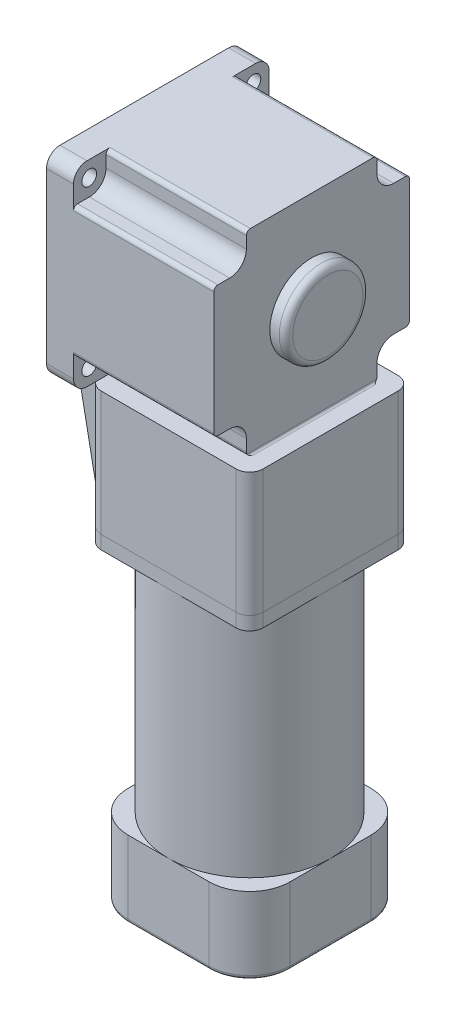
ISO-10303-21;
HEADER;
FILE_DESCRIPTION(('STEP AP214'),'2;1');
FILE_NAME('part.step','',(''),(''),'','','');
FILE_SCHEMA(('AUTOMOTIVE_DESIGN { 1 0 10303 214 1 1 1 1 }'));
ENDSEC;
DATA;
#1=APPLICATION_CONTEXT('core data for automotive mechanical design processes');
#2=APPLICATION_PROTOCOL_DEFINITION('international standard','automotive_design',2000,#1);
#3=PRODUCT_CONTEXT('',#1,'mechanical');
#4=PRODUCT('Part','Part','',(#3));
#5=PRODUCT_RELATED_PRODUCT_CATEGORY('part','',(#4));
#6=PRODUCT_DEFINITION_FORMATION('','',#4);
#7=PRODUCT_DEFINITION_CONTEXT('part definition',#1,'design');
#8=PRODUCT_DEFINITION('design','',#6,#7);
#9=PRODUCT_DEFINITION_SHAPE('','',#8);
#10=(LENGTH_UNIT() NAMED_UNIT(*) SI_UNIT(.MILLI.,.METRE.));
#11=(NAMED_UNIT(*) PLANE_ANGLE_UNIT() SI_UNIT($,.RADIAN.));
#12=(NAMED_UNIT(*) SI_UNIT($,.STERADIAN.) SOLID_ANGLE_UNIT());
#13=UNCERTAINTY_MEASURE_WITH_UNIT(LENGTH_MEASURE(1.E-05),#10,'distance_accuracy_value','');
#14=(GEOMETRIC_REPRESENTATION_CONTEXT(3) GLOBAL_UNCERTAINTY_ASSIGNED_CONTEXT((#13)) GLOBAL_UNIT_ASSIGNED_CONTEXT((#10,
#11,#12)) REPRESENTATION_CONTEXT('',''));
#15=CARTESIAN_POINT('',(0.,0.,0.));
#16=DIRECTION('',(0.,0.,1.));
#17=DIRECTION('',(1.,0.,0.));
#18=AXIS2_PLACEMENT_3D('',#15,#16,#17);
#19=CARTESIAN_POINT('',(78.,-347.5,0.));
#20=DIRECTION('',(0.,1.,0.));
#21=DIRECTION('',(0.,0.,1.));
#22=AXIS2_PLACEMENT_3D('',#19,#20,#21);
#23=CYLINDRICAL_SURFACE('',#22,60.);
#24=CARTESIAN_POINT('',(78.,-347.5,0.));
#25=DIRECTION('',(0.,-1.,0.));
#26=DIRECTION('',(0.,0.,-1.));
#27=AXIS2_PLACEMENT_3D('',#24,#25,#26);
#28=CIRCLE('',#27,60.);
#29=CARTESIAN_POINT('',(78.,-347.5,-60.));
#30=VERTEX_POINT('',#29);
#31=CARTESIAN_POINT('',(138.,-347.5,0.));
#32=VERTEX_POINT('',#31);
#33=EDGE_CURVE('E206',#30,#32,#28,.T.);
#34=ORIENTED_EDGE('',*,*,#33,.F.);
#35=CARTESIAN_POINT('',(18.,-347.5,0.));
#36=VERTEX_POINT('',#35);
#37=EDGE_CURVE('E210',#36,#30,#28,.T.);
#38=ORIENTED_EDGE('',*,*,#37,.F.);
#39=CARTESIAN_POINT('',(78.,-347.5,60.));
#40=VERTEX_POINT('',#39);
#41=EDGE_CURVE('E323',#40,#36,#28,.T.);
#42=ORIENTED_EDGE('',*,*,#41,.F.);
#43=EDGE_CURVE('E161',#32,#40,#28,.T.);
#44=ORIENTED_EDGE('',*,*,#43,.F.);
#45=EDGE_LOOP('',(#34,#38,#42,#44));
#46=FACE_BOUND('',#45,.T.);
#47=CARTESIAN_POINT('',(78.,-174.5,0.));
#48=DIRECTION('',(0.,-1.,0.));
#49=DIRECTION('',(0.,0.,-1.));
#50=AXIS2_PLACEMENT_3D('',#47,#48,#49);
#51=CIRCLE('',#50,60.);
#52=CARTESIAN_POINT('',(78.,-174.5,-60.));
#53=VERTEX_POINT('',#52);
#54=EDGE_CURVE('E152',#53,#53,#51,.T.);
#55=ORIENTED_EDGE('',*,*,#54,.T.);
#56=EDGE_LOOP('',(#55));
#57=FACE_BOUND('',#56,.T.);
#58=ADVANCED_FACE('F44',(#46,#57),#23,.T.);
#59=CARTESIAN_POINT('',(78.,-174.5,0.));
#60=DIRECTION('',(0.,-1.,0.));
#61=DIRECTION('',(0.,0.,-1.));
#62=AXIS2_PLACEMENT_3D('',#59,#60,#61);
#63=PLANE('',#62);
#64=ORIENTED_EDGE('',*,*,#54,.F.);
#65=EDGE_LOOP('',(#64));
#66=FACE_BOUND('',#65,.T.);
#67=ADVANCED_FACE('F341',(#66),#63,.F.);
#68=CARTESIAN_POINT('',(108.,-347.5,30.));
#69=DIRECTION('',(0.,1.,0.));
#70=DIRECTION('',(0.,0.,1.));
#71=AXIS2_PLACEMENT_3D('',#68,#69,#70);
#72=PLANE('',#71);
#73=DIRECTION('',(1.,0.,0.));
#74=VECTOR('',#73,1.);
#75=CARTESIAN_POINT('',(48.0000000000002,-347.5,-60.));
#76=LINE('',#75,#74);
#77=CARTESIAN_POINT('',(108.,-347.5,-60.));
#78=VERTEX_POINT('',#77);
#79=EDGE_CURVE('E183',#30,#78,#76,.T.);
#80=ORIENTED_EDGE('',*,*,#79,.F.);
#81=ORIENTED_EDGE('',*,*,#33,.T.);
#82=DIRECTION('',(0.,0.,1.));
#83=VECTOR('',#82,1.);
#84=CARTESIAN_POINT('',(138.,-347.5,-29.9999999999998));
#85=LINE('',#84,#83);
#86=CARTESIAN_POINT('',(138.,-347.5,-29.9999999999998));
#87=VERTEX_POINT('',#86);
#88=EDGE_CURVE('E191',#87,#32,#85,.T.);
#89=ORIENTED_EDGE('',*,*,#88,.F.);
#90=CARTESIAN_POINT('',(108.,-347.5,-30.));
#91=DIRECTION('',(0.,-1.,0.));
#92=DIRECTION('',(0.,0.,-1.));
#93=AXIS2_PLACEMENT_3D('',#90,#91,#92);
#94=CIRCLE('',#93,30.);
#95=EDGE_CURVE('E187',#78,#87,#94,.T.);
#96=ORIENTED_EDGE('',*,*,#95,.F.);
#97=EDGE_LOOP('',(#80,#81,#89,#96));
#98=FACE_BOUND('',#97,.T.);
#99=ADVANCED_FACE('F325',(#98),#72,.T.);
#100=CARTESIAN_POINT('',(138.,-347.5,29.9999999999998));
#101=VERTEX_POINT('',#100);
#102=EDGE_CURVE('E190',#32,#101,#85,.T.);
#103=ORIENTED_EDGE('',*,*,#102,.F.);
#104=ORIENTED_EDGE('',*,*,#43,.T.);
#105=DIRECTION('',(-1.,0.,0.));
#106=VECTOR('',#105,1.);
#107=CARTESIAN_POINT('',(48.0000000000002,-347.5,60.));
#108=LINE('',#107,#106);
#109=CARTESIAN_POINT('',(108.,-347.5,60.));
#110=VERTEX_POINT('',#109);
#111=EDGE_CURVE('E148',#110,#40,#108,.T.);
#112=ORIENTED_EDGE('',*,*,#111,.F.);
#113=CARTESIAN_POINT('',(108.,-347.5,30.));
#114=DIRECTION('',(0.,-1.,0.));
#115=DIRECTION('',(0.,0.,1.));
#116=AXIS2_PLACEMENT_3D('',#113,#114,#115);
#117=CIRCLE('',#116,30.);
#118=EDGE_CURVE('E160',#101,#110,#117,.T.);
#119=ORIENTED_EDGE('',*,*,#118,.F.);
#120=EDGE_LOOP('',(#103,#104,#112,#119));
#121=FACE_BOUND('',#120,.T.);
#122=ADVANCED_FACE('F159',(#121),#72,.T.);
#123=CARTESIAN_POINT('',(48.0000000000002,-347.5,60.));
#124=VERTEX_POINT('',#123);
#125=EDGE_CURVE('E164',#40,#124,#108,.T.);
#126=ORIENTED_EDGE('',*,*,#125,.F.);
#127=ORIENTED_EDGE('',*,*,#41,.T.);
#128=DIRECTION('',(0.,0.,-1.));
#129=VECTOR('',#128,1.);
#130=CARTESIAN_POINT('',(18.,-347.5,-29.9999999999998));
#131=LINE('',#130,#129);
#132=CARTESIAN_POINT('',(18.,-347.5,29.9999999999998));
#133=VERTEX_POINT('',#132);
#134=EDGE_CURVE('E177',#133,#36,#131,.T.);
#135=ORIENTED_EDGE('',*,*,#134,.F.);
#136=CARTESIAN_POINT('',(48.,-347.5,30.));
#137=DIRECTION('',(0.,-1.,0.));
#138=DIRECTION('',(0.,0.,1.));
#139=AXIS2_PLACEMENT_3D('',#136,#137,#138);
#140=CIRCLE('',#139,30.);
#141=EDGE_CURVE('E163',#124,#133,#140,.T.);
#142=ORIENTED_EDGE('',*,*,#141,.F.);
#143=EDGE_LOOP('',(#126,#127,#135,#142));
#144=FACE_BOUND('',#143,.T.);
#145=ADVANCED_FACE('F329',(#144),#72,.T.);
#146=CARTESIAN_POINT('',(108.,-404.5,30.));
#147=DIRECTION('',(0.,1.,0.));
#148=DIRECTION('',(0.,0.,1.));
#149=AXIS2_PLACEMENT_3D('',#146,#147,#148);
#150=CYLINDRICAL_SURFACE('',#149,30.);
#151=DIRECTION('',(0.,1.,0.));
#152=VECTOR('',#151,1.);
#153=CARTESIAN_POINT('',(108.,-404.5,60.));
#154=LINE('',#153,#152);
#155=CARTESIAN_POINT('',(108.,-401.5,60.));
#156=VERTEX_POINT('',#155);
#157=EDGE_CURVE('E144',#156,#110,#154,.T.);
#158=ORIENTED_EDGE('',*,*,#157,.F.);
#159=CARTESIAN_POINT('',(108.,-401.5,30.));
#160=DIRECTION('',(0.,1.,0.));
#161=DIRECTION('',(0.,0.,1.));
#162=AXIS2_PLACEMENT_3D('',#159,#160,#161);
#163=CIRCLE('',#162,30.);
#164=CARTESIAN_POINT('',(138.,-401.5,29.9999999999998));
#165=VERTEX_POINT('',#164);
#166=EDGE_CURVE('E12',#156,#165,#163,.T.);
#167=ORIENTED_EDGE('',*,*,#166,.T.);
#168=DIRECTION('',(0.,1.,0.));
#169=VECTOR('',#168,1.);
#170=CARTESIAN_POINT('',(138.,-404.5,29.9999999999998));
#171=LINE('',#170,#169);
#172=EDGE_CURVE('E168',#165,#101,#171,.T.);
#173=ORIENTED_EDGE('',*,*,#172,.T.);
#174=ORIENTED_EDGE('',*,*,#118,.T.);
#175=EDGE_LOOP('',(#158,#167,#173,#174));
#176=FACE_BOUND('',#175,.T.);
#177=ADVANCED_FACE('F166',(#176),#150,.T.);
#178=CARTESIAN_POINT('',(48.0000000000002,-404.5,60.));
#179=DIRECTION('',(0.,0.,-1.));
#180=DIRECTION('',(-1.,0.,0.));
#181=AXIS2_PLACEMENT_3D('',#178,#179,#180);
#182=PLANE('',#181);
#183=DIRECTION('',(0.,1.,0.));
#184=VECTOR('',#183,1.);
#185=CARTESIAN_POINT('',(48.0000000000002,-404.5,60.));
#186=LINE('',#185,#184);
#187=CARTESIAN_POINT('',(48.0000000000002,-401.5,60.));
#188=VERTEX_POINT('',#187);
#189=EDGE_CURVE('E153',#188,#124,#186,.T.);
#190=ORIENTED_EDGE('',*,*,#189,.F.);
#191=DIRECTION('',(-1.,0.,0.));
#192=VECTOR('',#191,1.);
#193=CARTESIAN_POINT('',(48.0000000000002,-401.5,60.));
#194=LINE('',#193,#192);
#195=EDGE_CURVE('E53',#188,#156,#194,.F.);
#196=ORIENTED_EDGE('',*,*,#195,.T.);
#197=ORIENTED_EDGE('',*,*,#157,.T.);
#198=ORIENTED_EDGE('',*,*,#111,.T.);
#199=ORIENTED_EDGE('',*,*,#125,.T.);
#200=EDGE_LOOP('',(#190,#196,#197,#198,#199));
#201=FACE_BOUND('',#200,.T.);
#202=ADVANCED_FACE('F146',(#201),#182,.F.);
#203=CARTESIAN_POINT('',(48.,-404.5,30.));
#204=DIRECTION('',(0.,1.,0.));
#205=DIRECTION('',(0.,0.,1.));
#206=AXIS2_PLACEMENT_3D('',#203,#204,#205);
#207=CYLINDRICAL_SURFACE('',#206,30.);
#208=DIRECTION('',(0.,1.,0.));
#209=VECTOR('',#208,1.);
#210=CARTESIAN_POINT('',(18.,-404.5,29.9999999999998));
#211=LINE('',#210,#209);
#212=CARTESIAN_POINT('',(18.,-401.5,29.9999999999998));
#213=VERTEX_POINT('',#212);
#214=EDGE_CURVE('E203',#213,#133,#211,.T.);
#215=ORIENTED_EDGE('',*,*,#214,.F.);
#216=CARTESIAN_POINT('',(48.,-401.5,30.));
#217=DIRECTION('',(0.,1.,0.));
#218=DIRECTION('',(0.,0.,1.));
#219=AXIS2_PLACEMENT_3D('',#216,#217,#218);
#220=CIRCLE('',#219,30.);
#221=EDGE_CURVE('E68',#213,#188,#220,.T.);
#222=ORIENTED_EDGE('',*,*,#221,.T.);
#223=ORIENTED_EDGE('',*,*,#189,.T.);
#224=ORIENTED_EDGE('',*,*,#141,.T.);
#225=EDGE_LOOP('',(#215,#222,#223,#224));
#226=FACE_BOUND('',#225,.T.);
#227=ADVANCED_FACE('F331',(#226),#207,.T.);
#228=CARTESIAN_POINT('',(18.,-404.5,-29.9999999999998));
#229=DIRECTION('',(1.,0.,0.));
#230=DIRECTION('',(0.,0.,-1.));
#231=AXIS2_PLACEMENT_3D('',#228,#229,#230);
#232=PLANE('',#231);
#233=DIRECTION('',(0.,1.,0.));
#234=VECTOR('',#233,1.);
#235=CARTESIAN_POINT('',(18.,-404.5,-29.9999999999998));
#236=LINE('',#235,#234);
#237=CARTESIAN_POINT('',(18.,-401.5,-29.9999999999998));
#238=VERTEX_POINT('',#237);
#239=CARTESIAN_POINT('',(18.,-347.5,-29.9999999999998));
#240=VERTEX_POINT('',#239);
#241=EDGE_CURVE('E201',#238,#240,#236,.T.);
#242=ORIENTED_EDGE('',*,*,#241,.F.);
#243=DIRECTION('',(0.,0.,-1.));
#244=VECTOR('',#243,1.);
#245=CARTESIAN_POINT('',(18.,-401.5,-29.9999999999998));
#246=LINE('',#245,#244);
#247=EDGE_CURVE('E238',#238,#213,#246,.F.);
#248=ORIENTED_EDGE('',*,*,#247,.T.);
#249=ORIENTED_EDGE('',*,*,#214,.T.);
#250=ORIENTED_EDGE('',*,*,#134,.T.);
#251=EDGE_CURVE('E176',#36,#240,#131,.T.);
#252=ORIENTED_EDGE('',*,*,#251,.T.);
#253=EDGE_LOOP('',(#242,#248,#249,#250,#252));
#254=FACE_BOUND('',#253,.T.);
#255=ADVANCED_FACE('F313',(#254),#232,.F.);
#256=CARTESIAN_POINT('',(48.,-404.5,-30.));
#257=DIRECTION('',(0.,1.,0.));
#258=DIRECTION('',(0.,0.,1.));
#259=AXIS2_PLACEMENT_3D('',#256,#257,#258);
#260=CYLINDRICAL_SURFACE('',#259,30.);
#261=DIRECTION('',(0.,1.,0.));
#262=VECTOR('',#261,1.);
#263=CARTESIAN_POINT('',(48.0000000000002,-404.5,-60.));
#264=LINE('',#263,#262);
#265=CARTESIAN_POINT('',(48.0000000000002,-401.5,-60.));
#266=VERTEX_POINT('',#265);
#267=CARTESIAN_POINT('',(48.0000000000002,-347.5,-60.));
#268=VERTEX_POINT('',#267);
#269=EDGE_CURVE('E199',#266,#268,#264,.T.);
#270=ORIENTED_EDGE('',*,*,#269,.F.);
#271=CARTESIAN_POINT('',(48.,-401.5,-30.));
#272=DIRECTION('',(0.,1.,0.));
#273=DIRECTION('',(0.,0.,1.));
#274=AXIS2_PLACEMENT_3D('',#271,#272,#273);
#275=CIRCLE('',#274,30.);
#276=EDGE_CURVE('E236',#266,#238,#275,.T.);
#277=ORIENTED_EDGE('',*,*,#276,.T.);
#278=ORIENTED_EDGE('',*,*,#241,.T.);
#279=CARTESIAN_POINT('',(48.,-347.5,-30.));
#280=DIRECTION('',(0.,-1.,0.));
#281=DIRECTION('',(0.,0.,1.));
#282=AXIS2_PLACEMENT_3D('',#279,#280,#281);
#283=CIRCLE('',#282,30.);
#284=EDGE_CURVE('E180',#240,#268,#283,.T.);
#285=ORIENTED_EDGE('',*,*,#284,.T.);
#286=EDGE_LOOP('',(#270,#277,#278,#285));
#287=FACE_BOUND('',#286,.T.);
#288=ADVANCED_FACE('F310',(#287),#260,.T.);
#289=CARTESIAN_POINT('',(48.0000000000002,-404.5,-60.));
#290=DIRECTION('',(0.,0.,1.));
#291=DIRECTION('',(1.,0.,0.));
#292=AXIS2_PLACEMENT_3D('',#289,#290,#291);
#293=PLANE('',#292);
#294=DIRECTION('',(0.,1.,0.));
#295=VECTOR('',#294,1.);
#296=CARTESIAN_POINT('',(108.,-404.5,-60.));
#297=LINE('',#296,#295);
#298=CARTESIAN_POINT('',(108.,-401.5,-60.));
#299=VERTEX_POINT('',#298);
#300=EDGE_CURVE('E197',#299,#78,#297,.T.);
#301=ORIENTED_EDGE('',*,*,#300,.F.);
#302=DIRECTION('',(1.,0.,0.));
#303=VECTOR('',#302,1.);
#304=CARTESIAN_POINT('',(48.0000000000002,-401.5,-60.));
#305=LINE('',#304,#303);
#306=EDGE_CURVE('E234',#299,#266,#305,.F.);
#307=ORIENTED_EDGE('',*,*,#306,.T.);
#308=ORIENTED_EDGE('',*,*,#269,.T.);
#309=EDGE_CURVE('E184',#268,#30,#76,.T.);
#310=ORIENTED_EDGE('',*,*,#309,.T.);
#311=ORIENTED_EDGE('',*,*,#79,.T.);
#312=EDGE_LOOP('',(#301,#307,#308,#310,#311));
#313=FACE_BOUND('',#312,.T.);
#314=ADVANCED_FACE('F298',(#313),#293,.F.);
#315=CARTESIAN_POINT('',(108.,-404.5,-30.));
#316=DIRECTION('',(0.,1.,0.));
#317=DIRECTION('',(0.,0.,1.));
#318=AXIS2_PLACEMENT_3D('',#315,#316,#317);
#319=CYLINDRICAL_SURFACE('',#318,30.);
#320=DIRECTION('',(0.,1.,0.));
#321=VECTOR('',#320,1.);
#322=CARTESIAN_POINT('',(138.,-404.5,-29.9999999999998));
#323=LINE('',#322,#321);
#324=CARTESIAN_POINT('',(138.,-401.5,-29.9999999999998));
#325=VERTEX_POINT('',#324);
#326=EDGE_CURVE('E195',#325,#87,#323,.T.);
#327=ORIENTED_EDGE('',*,*,#326,.F.);
#328=CARTESIAN_POINT('',(108.,-401.5,-30.));
#329=DIRECTION('',(0.,1.,0.));
#330=DIRECTION('',(0.,0.,1.));
#331=AXIS2_PLACEMENT_3D('',#328,#329,#330);
#332=CIRCLE('',#331,30.);
#333=EDGE_CURVE('E232',#325,#299,#332,.T.);
#334=ORIENTED_EDGE('',*,*,#333,.T.);
#335=ORIENTED_EDGE('',*,*,#300,.T.);
#336=ORIENTED_EDGE('',*,*,#95,.T.);
#337=EDGE_LOOP('',(#327,#334,#335,#336));
#338=FACE_BOUND('',#337,.T.);
#339=ADVANCED_FACE('F294',(#338),#319,.T.);
#340=CARTESIAN_POINT('',(138.,-404.5,-29.9999999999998));
#341=DIRECTION('',(-1.,0.,0.));
#342=DIRECTION('',(0.,0.,1.));
#343=AXIS2_PLACEMENT_3D('',#340,#341,#342);
#344=PLANE('',#343);
#345=ORIENTED_EDGE('',*,*,#172,.F.);
#346=DIRECTION('',(0.,0.,1.));
#347=VECTOR('',#346,1.);
#348=CARTESIAN_POINT('',(138.,-401.5,-29.9999999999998));
#349=LINE('',#348,#347);
#350=EDGE_CURVE('E229',#165,#325,#349,.F.);
#351=ORIENTED_EDGE('',*,*,#350,.T.);
#352=ORIENTED_EDGE('',*,*,#326,.T.);
#353=ORIENTED_EDGE('',*,*,#88,.T.);
#354=ORIENTED_EDGE('',*,*,#102,.T.);
#355=EDGE_LOOP('',(#345,#351,#352,#353,#354));
#356=FACE_BOUND('',#355,.T.);
#357=ADVANCED_FACE('F281',(#356),#344,.F.);
#358=CARTESIAN_POINT('',(108.,-404.5,30.));
#359=DIRECTION('',(0.,1.,0.));
#360=DIRECTION('',(0.,0.,1.));
#361=AXIS2_PLACEMENT_3D('',#358,#359,#360);
#362=PLANE('',#361);
#363=CARTESIAN_POINT('',(108.,-404.5,-30.));
#364=DIRECTION('',(0.,1.,0.));
#365=DIRECTION('',(0.,0.,1.));
#366=AXIS2_PLACEMENT_3D('',#363,#364,#365);
#367=CIRCLE('',#366,27.);
#368=CARTESIAN_POINT('',(108.,-404.5,-57.));
#369=VERTEX_POINT('',#368);
#370=CARTESIAN_POINT('',(135.,-404.5,-29.9999999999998));
#371=VERTEX_POINT('',#370);
#372=EDGE_CURVE('E224',#369,#371,#367,.F.);
#373=ORIENTED_EDGE('',*,*,#372,.T.);
#374=DIRECTION('',(0.,0.,1.));
#375=VECTOR('',#374,1.);
#376=CARTESIAN_POINT('',(135.,-404.5,30.));
#377=LINE('',#376,#375);
#378=CARTESIAN_POINT('',(135.,-404.5,29.9999999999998));
#379=VERTEX_POINT('',#378);
#380=EDGE_CURVE('E226',#371,#379,#377,.T.);
#381=ORIENTED_EDGE('',*,*,#380,.T.);
#382=CARTESIAN_POINT('',(108.,-404.5,30.));
#383=DIRECTION('',(0.,1.,0.));
#384=DIRECTION('',(0.,0.,1.));
#385=AXIS2_PLACEMENT_3D('',#382,#383,#384);
#386=CIRCLE('',#385,27.);
#387=CARTESIAN_POINT('',(108.,-404.5,57.));
#388=VERTEX_POINT('',#387);
#389=EDGE_CURVE('E209',#379,#388,#386,.F.);
#390=ORIENTED_EDGE('',*,*,#389,.T.);
#391=DIRECTION('',(-1.,0.,0.));
#392=VECTOR('',#391,1.);
#393=CARTESIAN_POINT('',(108.,-404.5,57.));
#394=LINE('',#393,#392);
#395=CARTESIAN_POINT('',(48.0000000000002,-404.5,57.));
#396=VERTEX_POINT('',#395);
#397=EDGE_CURVE('E214',#388,#396,#394,.T.);
#398=ORIENTED_EDGE('',*,*,#397,.T.);
#399=CARTESIAN_POINT('',(48.,-404.5,30.));
#400=DIRECTION('',(0.,1.,0.));
#401=DIRECTION('',(0.,0.,1.));
#402=AXIS2_PLACEMENT_3D('',#399,#400,#401);
#403=CIRCLE('',#402,27.);
#404=CARTESIAN_POINT('',(21.,-404.5,29.9999999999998));
#405=VERTEX_POINT('',#404);
#406=EDGE_CURVE('E216',#396,#405,#403,.F.);
#407=ORIENTED_EDGE('',*,*,#406,.T.);
#408=DIRECTION('',(0.,0.,-1.));
#409=VECTOR('',#408,1.);
#410=CARTESIAN_POINT('',(21.,-404.5,30.));
#411=LINE('',#410,#409);
#412=CARTESIAN_POINT('',(21.,-404.5,-29.9999999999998));
#413=VERTEX_POINT('',#412);
#414=EDGE_CURVE('E218',#405,#413,#411,.T.);
#415=ORIENTED_EDGE('',*,*,#414,.T.);
#416=CARTESIAN_POINT('',(48.,-404.5,-30.));
#417=DIRECTION('',(0.,1.,0.));
#418=DIRECTION('',(0.,0.,1.));
#419=AXIS2_PLACEMENT_3D('',#416,#417,#418);
#420=CIRCLE('',#419,27.);
#421=CARTESIAN_POINT('',(48.0000000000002,-404.5,-57.));
#422=VERTEX_POINT('',#421);
#423=EDGE_CURVE('E220',#413,#422,#420,.F.);
#424=ORIENTED_EDGE('',*,*,#423,.T.);
#425=DIRECTION('',(1.,0.,0.));
#426=VECTOR('',#425,1.);
#427=CARTESIAN_POINT('',(108.,-404.5,-57.));
#428=LINE('',#427,#426);
#429=EDGE_CURVE('E222',#422,#369,#428,.T.);
#430=ORIENTED_EDGE('',*,*,#429,.T.);
#431=EDGE_LOOP('',(#373,#381,#390,#398,#407,#415,#424,#430));
#432=FACE_BOUND('',#431,.T.);
#433=ADVANCED_FACE('F269',(#432),#362,.F.);
#434=ORIENTED_EDGE('',*,*,#251,.F.);
#435=ORIENTED_EDGE('',*,*,#37,.T.);
#436=ORIENTED_EDGE('',*,*,#309,.F.);
#437=ORIENTED_EDGE('',*,*,#284,.F.);
#438=EDGE_LOOP('',(#434,#435,#436,#437));
#439=FACE_BOUND('',#438,.T.);
#440=ADVANCED_FACE('F320',(#439),#72,.T.);
#441=CARTESIAN_POINT('',(21.,-401.5,30.));
#442=DIRECTION('',(0.,0.,-1.));
#443=DIRECTION('',(-1.,0.,0.));
#444=AXIS2_PLACEMENT_3D('',#441,#442,#443);
#445=CYLINDRICAL_SURFACE('',#444,3.);
#446=CARTESIAN_POINT('',(21.,-401.5,29.9999999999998));
#447=DIRECTION('',(0.,0.,1.));
#448=DIRECTION('',(1.,0.,0.));
#449=AXIS2_PLACEMENT_3D('',#446,#447,#448);
#450=CIRCLE('',#449,3.);
#451=EDGE_CURVE('E172',#213,#405,#450,.T.);
#452=ORIENTED_EDGE('',*,*,#451,.F.);
#453=ORIENTED_EDGE('',*,*,#247,.F.);
#454=CARTESIAN_POINT('',(21.,-401.5,-29.9999999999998));
#455=DIRECTION('',(0.,0.,-1.));
#456=DIRECTION('',(-1.,0.,0.));
#457=AXIS2_PLACEMENT_3D('',#454,#455,#456);
#458=CIRCLE('',#457,3.);
#459=EDGE_CURVE('E48',#413,#238,#458,.T.);
#460=ORIENTED_EDGE('',*,*,#459,.F.);
#461=ORIENTED_EDGE('',*,*,#414,.F.);
#462=EDGE_LOOP('',(#452,#453,#460,#461));
#463=FACE_BOUND('',#462,.T.);
#464=ADVANCED_FACE('F46',(#463),#445,.T.);
#465=CARTESIAN_POINT('',(48.,-401.5,-30.));
#466=DIRECTION('',(0.,1.,0.));
#467=DIRECTION('',(0.,0.,1.));
#468=AXIS2_PLACEMENT_3D('',#465,#466,#467);
#469=TOROIDAL_SURFACE('',#468,27.,3.);
#470=ORIENTED_EDGE('',*,*,#459,.T.);
#471=ORIENTED_EDGE('',*,*,#276,.F.);
#472=CARTESIAN_POINT('',(48.0000000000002,-401.5,-57.));
#473=DIRECTION('',(1.,0.,0.));
#474=DIRECTION('',(0.,0.,-1.));
#475=AXIS2_PLACEMENT_3D('',#472,#473,#474);
#476=CIRCLE('',#475,3.);
#477=EDGE_CURVE('E255',#422,#266,#476,.T.);
#478=ORIENTED_EDGE('',*,*,#477,.F.);
#479=ORIENTED_EDGE('',*,*,#423,.F.);
#480=EDGE_LOOP('',(#470,#471,#478,#479));
#481=FACE_BOUND('',#480,.T.);
#482=ADVANCED_FACE('F307',(#481),#469,.T.);
#483=CARTESIAN_POINT('',(48.,-401.5,30.));
#484=DIRECTION('',(0.,1.,0.));
#485=DIRECTION('',(0.,0.,1.));
#486=AXIS2_PLACEMENT_3D('',#483,#484,#485);
#487=TOROIDAL_SURFACE('',#486,27.,3.);
#488=ORIENTED_EDGE('',*,*,#451,.T.);
#489=ORIENTED_EDGE('',*,*,#406,.F.);
#490=CARTESIAN_POINT('',(48.0000000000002,-401.5,57.));
#491=DIRECTION('',(1.,0.,0.));
#492=DIRECTION('',(0.,0.,-1.));
#493=AXIS2_PLACEMENT_3D('',#490,#491,#492);
#494=CIRCLE('',#493,3.);
#495=EDGE_CURVE('E252',#188,#396,#494,.T.);
#496=ORIENTED_EDGE('',*,*,#495,.F.);
#497=ORIENTED_EDGE('',*,*,#221,.F.);
#498=EDGE_LOOP('',(#488,#489,#496,#497));
#499=FACE_BOUND('',#498,.T.);
#500=ADVANCED_FACE('F261',(#499),#487,.T.);
#501=CARTESIAN_POINT('',(108.,-401.5,-57.));
#502=DIRECTION('',(1.,0.,0.));
#503=DIRECTION('',(0.,0.,-1.));
#504=AXIS2_PLACEMENT_3D('',#501,#502,#503);
#505=CYLINDRICAL_SURFACE('',#504,3.);
#506=ORIENTED_EDGE('',*,*,#477,.T.);
#507=ORIENTED_EDGE('',*,*,#306,.F.);
#508=CARTESIAN_POINT('',(108.,-401.5,-57.));
#509=DIRECTION('',(1.,0.,0.));
#510=DIRECTION('',(0.,0.,-1.));
#511=AXIS2_PLACEMENT_3D('',#508,#509,#510);
#512=CIRCLE('',#511,3.);
#513=EDGE_CURVE('E249',#369,#299,#512,.T.);
#514=ORIENTED_EDGE('',*,*,#513,.F.);
#515=ORIENTED_EDGE('',*,*,#429,.F.);
#516=EDGE_LOOP('',(#506,#507,#514,#515));
#517=FACE_BOUND('',#516,.T.);
#518=ADVANCED_FACE('F303',(#517),#505,.T.);
#519=CARTESIAN_POINT('',(108.,-401.5,57.));
#520=DIRECTION('',(-1.,0.,0.));
#521=DIRECTION('',(0.,0.,1.));
#522=AXIS2_PLACEMENT_3D('',#519,#520,#521);
#523=CYLINDRICAL_SURFACE('',#522,3.);
#524=ORIENTED_EDGE('',*,*,#495,.T.);
#525=ORIENTED_EDGE('',*,*,#397,.F.);
#526=CARTESIAN_POINT('',(108.,-401.5,57.));
#527=DIRECTION('',(1.,0.,0.));
#528=DIRECTION('',(0.,0.,-1.));
#529=AXIS2_PLACEMENT_3D('',#526,#527,#528);
#530=CIRCLE('',#529,3.);
#531=EDGE_CURVE('E246',#156,#388,#530,.T.);
#532=ORIENTED_EDGE('',*,*,#531,.F.);
#533=ORIENTED_EDGE('',*,*,#195,.F.);
#534=EDGE_LOOP('',(#524,#525,#532,#533));
#535=FACE_BOUND('',#534,.T.);
#536=ADVANCED_FACE('F274',(#535),#523,.T.);
#537=CARTESIAN_POINT('',(108.,-401.5,-30.));
#538=DIRECTION('',(0.,1.,0.));
#539=DIRECTION('',(0.,0.,1.));
#540=AXIS2_PLACEMENT_3D('',#537,#538,#539);
#541=TOROIDAL_SURFACE('',#540,27.,3.);
#542=ORIENTED_EDGE('',*,*,#513,.T.);
#543=ORIENTED_EDGE('',*,*,#333,.F.);
#544=CARTESIAN_POINT('',(135.,-401.5,-29.9999999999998));
#545=DIRECTION('',(0.,0.,1.));
#546=DIRECTION('',(1.,0.,0.));
#547=AXIS2_PLACEMENT_3D('',#544,#545,#546);
#548=CIRCLE('',#547,3.);
#549=EDGE_CURVE('E244',#371,#325,#548,.T.);
#550=ORIENTED_EDGE('',*,*,#549,.F.);
#551=ORIENTED_EDGE('',*,*,#372,.F.);
#552=EDGE_LOOP('',(#542,#543,#550,#551));
#553=FACE_BOUND('',#552,.T.);
#554=ADVANCED_FACE('F290',(#553),#541,.T.);
#555=CARTESIAN_POINT('',(108.,-401.5,30.));
#556=DIRECTION('',(0.,1.,0.));
#557=DIRECTION('',(0.,0.,1.));
#558=AXIS2_PLACEMENT_3D('',#555,#556,#557);
#559=TOROIDAL_SURFACE('',#558,27.,3.);
#560=ORIENTED_EDGE('',*,*,#531,.T.);
#561=ORIENTED_EDGE('',*,*,#389,.F.);
#562=CARTESIAN_POINT('',(135.,-401.5,29.9999999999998));
#563=DIRECTION('',(0.,0.,-1.));
#564=DIRECTION('',(-1.,0.,0.));
#565=AXIS2_PLACEMENT_3D('',#562,#563,#564);
#566=CIRCLE('',#565,3.);
#567=EDGE_CURVE('E242',#165,#379,#566,.T.);
#568=ORIENTED_EDGE('',*,*,#567,.F.);
#569=ORIENTED_EDGE('',*,*,#166,.F.);
#570=EDGE_LOOP('',(#560,#561,#568,#569));
#571=FACE_BOUND('',#570,.T.);
#572=ADVANCED_FACE('F277',(#571),#559,.T.);
#573=CARTESIAN_POINT('',(135.,-401.5,30.));
#574=DIRECTION('',(0.,0.,1.));
#575=DIRECTION('',(1.,0.,0.));
#576=AXIS2_PLACEMENT_3D('',#573,#574,#575);
#577=CYLINDRICAL_SURFACE('',#576,3.);
#578=ORIENTED_EDGE('',*,*,#549,.T.);
#579=ORIENTED_EDGE('',*,*,#350,.F.);
#580=ORIENTED_EDGE('',*,*,#567,.T.);
#581=ORIENTED_EDGE('',*,*,#380,.F.);
#582=EDGE_LOOP('',(#578,#579,#580,#581));
#583=FACE_BOUND('',#582,.T.);
#584=ADVANCED_FACE('F284',(#583),#577,.T.);
#585=CLOSED_SHELL('',(#58,#67,#99,#122,#145,#177,#202,#227,#255,#288,#314,#339,#357,#433,#440,
#464,#482,#500,#518,#536,#554,#572,#584));
#586=MANIFOLD_SOLID_BREP('B2',#585);
#587=CARTESIAN_POINT('',(128.,-174.5,-50.));
#588=DIRECTION('',(0.,1.,0.));
#589=DIRECTION('',(0.,0.,1.));
#590=AXIS2_PLACEMENT_3D('',#587,#588,#589);
#591=CYLINDRICAL_SURFACE('',#590,10.);
#592=CARTESIAN_POINT('',(128.,-164.5,-50.));
#593=DIRECTION('',(0.,-1.,0.));
#594=DIRECTION('',(0.,0.,-1.));
#595=AXIS2_PLACEMENT_3D('',#592,#593,#594);
#596=CIRCLE('',#595,10.);
#597=CARTESIAN_POINT('',(128.,-164.5,-60.));
#598=VERTEX_POINT('',#597);
#599=CARTESIAN_POINT('',(138.,-164.5,-50.));
#600=VERTEX_POINT('',#599);
#601=EDGE_CURVE('E622',#598,#600,#596,.T.);
#602=ORIENTED_EDGE('',*,*,#601,.T.);
#603=DIRECTION('',(0.,1.,0.));
#604=VECTOR('',#603,1.);
#605=CARTESIAN_POINT('',(138.,-174.5,-50.));
#606=LINE('',#605,#604);
#607=CARTESIAN_POINT('',(138.,-174.5,-50.));
#608=VERTEX_POINT('',#607);
#609=EDGE_CURVE('E42',#608,#600,#606,.T.);
#610=ORIENTED_EDGE('',*,*,#609,.F.);
#611=CARTESIAN_POINT('',(128.,-174.5,-50.));
#612=DIRECTION('',(0.,-1.,0.));
#613=DIRECTION('',(0.,0.,-1.));
#614=AXIS2_PLACEMENT_3D('',#611,#612,#613);
#615=CIRCLE('',#614,10.);
#616=CARTESIAN_POINT('',(128.,-174.5,-60.));
#617=VERTEX_POINT('',#616);
#618=EDGE_CURVE('E636',#617,#608,#615,.T.);
#619=ORIENTED_EDGE('',*,*,#618,.F.);
#620=DIRECTION('',(0.,1.,0.));
#621=VECTOR('',#620,1.);
#622=CARTESIAN_POINT('',(128.,-174.5,-60.));
#623=LINE('',#622,#621);
#624=EDGE_CURVE('E618',#617,#598,#623,.T.);
#625=ORIENTED_EDGE('',*,*,#624,.T.);
#626=EDGE_LOOP('',(#602,#610,#619,#625));
#627=FACE_BOUND('',#626,.T.);
#628=ADVANCED_FACE('F526',(#627),#591,.T.);
#629=CARTESIAN_POINT('',(138.,-174.5,-50.));
#630=DIRECTION('',(-1.,0.,0.));
#631=DIRECTION('',(0.,0.,1.));
#632=AXIS2_PLACEMENT_3D('',#629,#630,#631);
#633=PLANE('',#632);
#634=DIRECTION('',(0.,0.,1.));
#635=VECTOR('',#634,1.);
#636=CARTESIAN_POINT('',(138.,-164.5,-50.));
#637=LINE('',#636,#635);
#638=CARTESIAN_POINT('',(138.,-164.5,49.9999999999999));
#639=VERTEX_POINT('',#638);
#640=EDGE_CURVE('E625',#600,#639,#637,.T.);
#641=ORIENTED_EDGE('',*,*,#640,.T.);
#642=DIRECTION('',(0.,1.,0.));
#643=VECTOR('',#642,1.);
#644=CARTESIAN_POINT('',(138.,-174.5,49.9999999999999));
#645=LINE('',#644,#643);
#646=CARTESIAN_POINT('',(138.,-174.5,49.9999999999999));
#647=VERTEX_POINT('',#646);
#648=EDGE_CURVE('E534',#647,#639,#645,.T.);
#649=ORIENTED_EDGE('',*,*,#648,.F.);
#650=DIRECTION('',(0.,0.,1.));
#651=VECTOR('',#650,1.);
#652=CARTESIAN_POINT('',(138.,-174.5,-50.));
#653=LINE('',#652,#651);
#654=EDGE_CURVE('E585',#608,#647,#653,.T.);
#655=ORIENTED_EDGE('',*,*,#654,.F.);
#656=ORIENTED_EDGE('',*,*,#609,.T.);
#657=EDGE_LOOP('',(#641,#649,#655,#656));
#658=FACE_BOUND('',#657,.T.);
#659=ADVANCED_FACE('F671',(#658),#633,.F.);
#660=CARTESIAN_POINT('',(128.,-174.5,50.));
#661=DIRECTION('',(0.,1.,0.));
#662=DIRECTION('',(0.,0.,1.));
#663=AXIS2_PLACEMENT_3D('',#660,#661,#662);
#664=CYLINDRICAL_SURFACE('',#663,10.);
#665=CARTESIAN_POINT('',(128.,-164.5,50.));
#666=DIRECTION('',(0.,-1.,0.));
#667=DIRECTION('',(0.,0.,1.));
#668=AXIS2_PLACEMENT_3D('',#665,#666,#667);
#669=CIRCLE('',#668,10.);
#670=CARTESIAN_POINT('',(128.,-164.5,60.));
#671=VERTEX_POINT('',#670);
#672=EDGE_CURVE('E627',#639,#671,#669,.T.);
#673=ORIENTED_EDGE('',*,*,#672,.T.);
#674=DIRECTION('',(0.,1.,0.));
#675=VECTOR('',#674,1.);
#676=CARTESIAN_POINT('',(128.,-174.5,60.));
#677=LINE('',#676,#675);
#678=CARTESIAN_POINT('',(128.,-174.5,60.));
#679=VERTEX_POINT('',#678);
#680=EDGE_CURVE('E643',#679,#671,#677,.T.);
#681=ORIENTED_EDGE('',*,*,#680,.F.);
#682=CARTESIAN_POINT('',(128.,-174.5,50.));
#683=DIRECTION('',(0.,-1.,0.));
#684=DIRECTION('',(0.,0.,1.));
#685=AXIS2_PLACEMENT_3D('',#682,#683,#684);
#686=CIRCLE('',#685,10.);
#687=EDGE_CURVE('E651',#647,#679,#686,.T.);
#688=ORIENTED_EDGE('',*,*,#687,.F.);
#689=ORIENTED_EDGE('',*,*,#648,.T.);
#690=EDGE_LOOP('',(#673,#681,#688,#689));
#691=FACE_BOUND('',#690,.T.);
#692=ADVANCED_FACE('F649',(#691),#664,.T.);
#693=CARTESIAN_POINT('',(28.0000000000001,-174.5,60.));
#694=DIRECTION('',(0.,0.,-1.));
#695=DIRECTION('',(-1.,0.,0.));
#696=AXIS2_PLACEMENT_3D('',#693,#694,#695);
#697=PLANE('',#696);
#698=DIRECTION('',(-1.,0.,0.));
#699=VECTOR('',#698,1.);
#700=CARTESIAN_POINT('',(28.0000000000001,-164.5,60.));
#701=LINE('',#700,#699);
#702=CARTESIAN_POINT('',(28.0000000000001,-164.5,60.));
#703=VERTEX_POINT('',#702);
#704=EDGE_CURVE('E629',#671,#703,#701,.T.);
#705=ORIENTED_EDGE('',*,*,#704,.T.);
#706=DIRECTION('',(0.,1.,0.));
#707=VECTOR('',#706,1.);
#708=CARTESIAN_POINT('',(28.0000000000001,-174.5,60.));
#709=LINE('',#708,#707);
#710=CARTESIAN_POINT('',(28.0000000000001,-174.5,60.));
#711=VERTEX_POINT('',#710);
#712=EDGE_CURVE('E640',#711,#703,#709,.T.);
#713=ORIENTED_EDGE('',*,*,#712,.F.);
#714=DIRECTION('',(-1.,0.,0.));
#715=VECTOR('',#714,1.);
#716=CARTESIAN_POINT('',(28.0000000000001,-174.5,60.));
#717=LINE('',#716,#715);
#718=EDGE_CURVE('E663',#679,#711,#717,.T.);
#719=ORIENTED_EDGE('',*,*,#718,.F.);
#720=ORIENTED_EDGE('',*,*,#680,.T.);
#721=EDGE_LOOP('',(#705,#713,#719,#720));
#722=FACE_BOUND('',#721,.T.);
#723=ADVANCED_FACE('F659',(#722),#697,.F.);
#724=CARTESIAN_POINT('',(28.,-174.5,50.));
#725=DIRECTION('',(0.,1.,0.));
#726=DIRECTION('',(0.,0.,1.));
#727=AXIS2_PLACEMENT_3D('',#724,#725,#726);
#728=CYLINDRICAL_SURFACE('',#727,10.);
#729=CARTESIAN_POINT('',(28.,-164.5,50.));
#730=DIRECTION('',(0.,-1.,0.));
#731=DIRECTION('',(0.,0.,1.));
#732=AXIS2_PLACEMENT_3D('',#729,#730,#731);
#733=CIRCLE('',#732,10.);
#734=CARTESIAN_POINT('',(18.,-164.5,49.9999999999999));
#735=VERTEX_POINT('',#734);
#736=EDGE_CURVE('E631',#703,#735,#733,.T.);
#737=ORIENTED_EDGE('',*,*,#736,.T.);
#738=DIRECTION('',(0.,1.,0.));
#739=VECTOR('',#738,1.);
#740=CARTESIAN_POINT('',(18.,-174.5,49.9999999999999));
#741=LINE('',#740,#739);
#742=CARTESIAN_POINT('',(18.,-174.5,49.9999999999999));
#743=VERTEX_POINT('',#742);
#744=EDGE_CURVE('E613',#743,#735,#741,.T.);
#745=ORIENTED_EDGE('',*,*,#744,.F.);
#746=CARTESIAN_POINT('',(28.,-174.5,50.));
#747=DIRECTION('',(0.,-1.,0.));
#748=DIRECTION('',(0.,0.,1.));
#749=AXIS2_PLACEMENT_3D('',#746,#747,#748);
#750=CIRCLE('',#749,10.);
#751=EDGE_CURVE('E604',#711,#743,#750,.T.);
#752=ORIENTED_EDGE('',*,*,#751,.F.);
#753=ORIENTED_EDGE('',*,*,#712,.T.);
#754=EDGE_LOOP('',(#737,#745,#752,#753));
#755=FACE_BOUND('',#754,.T.);
#756=ADVANCED_FACE('F662',(#755),#728,.T.);
#757=CARTESIAN_POINT('',(18.,-174.5,-50.));
#758=DIRECTION('',(1.,0.,0.));
#759=DIRECTION('',(0.,0.,-1.));
#760=AXIS2_PLACEMENT_3D('',#757,#758,#759);
#761=PLANE('',#760);
#762=DIRECTION('',(0.,0.,-1.));
#763=VECTOR('',#762,1.);
#764=CARTESIAN_POINT('',(18.,-164.5,-50.));
#765=LINE('',#764,#763);
#766=CARTESIAN_POINT('',(18.,-164.5,-50.));
#767=VERTEX_POINT('',#766);
#768=EDGE_CURVE('E612',#735,#767,#765,.T.);
#769=ORIENTED_EDGE('',*,*,#768,.T.);
#770=DIRECTION('',(0.,1.,0.));
#771=VECTOR('',#770,1.);
#772=CARTESIAN_POINT('',(18.,-174.5,-50.));
#773=LINE('',#772,#771);
#774=CARTESIAN_POINT('',(18.,-174.5,-50.));
#775=VERTEX_POINT('',#774);
#776=EDGE_CURVE('E609',#775,#767,#773,.T.);
#777=ORIENTED_EDGE('',*,*,#776,.F.);
#778=DIRECTION('',(0.,0.,-1.));
#779=VECTOR('',#778,1.);
#780=CARTESIAN_POINT('',(18.,-174.5,-50.));
#781=LINE('',#780,#779);
#782=EDGE_CURVE('E598',#743,#775,#781,.T.);
#783=ORIENTED_EDGE('',*,*,#782,.F.);
#784=ORIENTED_EDGE('',*,*,#744,.T.);
#785=EDGE_LOOP('',(#769,#777,#783,#784));
#786=FACE_BOUND('',#785,.T.);
#787=ADVANCED_FACE('F610',(#786),#761,.F.);
#788=CARTESIAN_POINT('',(28.,-174.5,-50.));
#789=DIRECTION('',(0.,1.,0.));
#790=DIRECTION('',(0.,0.,1.));
#791=AXIS2_PLACEMENT_3D('',#788,#789,#790);
#792=CYLINDRICAL_SURFACE('',#791,10.);
#793=CARTESIAN_POINT('',(28.,-164.5,-50.));
#794=DIRECTION('',(0.,-1.,0.));
#795=DIRECTION('',(0.,0.,1.));
#796=AXIS2_PLACEMENT_3D('',#793,#794,#795);
#797=CIRCLE('',#796,10.);
#798=CARTESIAN_POINT('',(28.0000000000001,-164.5,-60.));
#799=VERTEX_POINT('',#798);
#800=EDGE_CURVE('E571',#767,#799,#797,.T.);
#801=ORIENTED_EDGE('',*,*,#800,.T.);
#802=DIRECTION('',(0.,1.,0.));
#803=VECTOR('',#802,1.);
#804=CARTESIAN_POINT('',(28.0000000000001,-174.5,-60.));
#805=LINE('',#804,#803);
#806=CARTESIAN_POINT('',(28.0000000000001,-174.5,-60.));
#807=VERTEX_POINT('',#806);
#808=EDGE_CURVE('E614',#807,#799,#805,.T.);
#809=ORIENTED_EDGE('',*,*,#808,.F.);
#810=CARTESIAN_POINT('',(28.,-174.5,-50.));
#811=DIRECTION('',(0.,-1.,0.));
#812=DIRECTION('',(0.,0.,1.));
#813=AXIS2_PLACEMENT_3D('',#810,#811,#812);
#814=CIRCLE('',#813,10.);
#815=EDGE_CURVE('E602',#775,#807,#814,.T.);
#816=ORIENTED_EDGE('',*,*,#815,.F.);
#817=ORIENTED_EDGE('',*,*,#776,.T.);
#818=EDGE_LOOP('',(#801,#809,#816,#817));
#819=FACE_BOUND('',#818,.T.);
#820=ADVANCED_FACE('F616',(#819),#792,.T.);
#821=CARTESIAN_POINT('',(28.0000000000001,-174.5,-60.));
#822=DIRECTION('',(0.,0.,1.));
#823=DIRECTION('',(1.,0.,0.));
#824=AXIS2_PLACEMENT_3D('',#821,#822,#823);
#825=PLANE('',#824);
#826=DIRECTION('',(1.,0.,0.));
#827=VECTOR('',#826,1.);
#828=CARTESIAN_POINT('',(28.0000000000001,-164.5,-60.));
#829=LINE('',#828,#827);
#830=EDGE_CURVE('E577',#799,#598,#829,.T.);
#831=ORIENTED_EDGE('',*,*,#830,.T.);
#832=ORIENTED_EDGE('',*,*,#624,.F.);
#833=DIRECTION('',(1.,0.,0.));
#834=VECTOR('',#833,1.);
#835=CARTESIAN_POINT('',(28.0000000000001,-174.5,-60.));
#836=LINE('',#835,#834);
#837=EDGE_CURVE('E542',#807,#617,#836,.T.);
#838=ORIENTED_EDGE('',*,*,#837,.F.);
#839=ORIENTED_EDGE('',*,*,#808,.T.);
#840=EDGE_LOOP('',(#831,#832,#838,#839));
#841=FACE_BOUND('',#840,.T.);
#842=ADVANCED_FACE('F687',(#841),#825,.F.);
#843=CARTESIAN_POINT('',(128.,-174.5,-50.));
#844=DIRECTION('',(0.,-1.,0.));
#845=DIRECTION('',(0.,0.,-1.));
#846=AXIS2_PLACEMENT_3D('',#843,#844,#845);
#847=PLANE('',#846);
#848=ORIENTED_EDGE('',*,*,#618,.T.);
#849=ORIENTED_EDGE('',*,*,#654,.T.);
#850=ORIENTED_EDGE('',*,*,#687,.T.);
#851=ORIENTED_EDGE('',*,*,#718,.T.);
#852=ORIENTED_EDGE('',*,*,#751,.T.);
#853=ORIENTED_EDGE('',*,*,#782,.T.);
#854=ORIENTED_EDGE('',*,*,#815,.T.);
#855=ORIENTED_EDGE('',*,*,#837,.T.);
#856=EDGE_LOOP('',(#848,#849,#850,#851,#852,#853,#854,#855));
#857=FACE_BOUND('',#856,.T.);
#858=ADVANCED_FACE('F600',(#857),#847,.T.);
#859=CARTESIAN_POINT('',(128.,-164.5,-50.));
#860=DIRECTION('',(0.,-1.,0.));
#861=DIRECTION('',(0.,0.,-1.));
#862=AXIS2_PLACEMENT_3D('',#859,#860,#861);
#863=PLANE('',#862);
#864=ORIENTED_EDGE('',*,*,#601,.F.);
#865=ORIENTED_EDGE('',*,*,#830,.F.);
#866=ORIENTED_EDGE('',*,*,#800,.F.);
#867=ORIENTED_EDGE('',*,*,#768,.F.);
#868=ORIENTED_EDGE('',*,*,#736,.F.);
#869=ORIENTED_EDGE('',*,*,#704,.F.);
#870=ORIENTED_EDGE('',*,*,#672,.F.);
#871=ORIENTED_EDGE('',*,*,#640,.F.);
#872=EDGE_LOOP('',(#864,#865,#866,#867,#868,#869,#870,#871));
#873=FACE_BOUND('',#872,.T.);
#874=ADVANCED_FACE('F655',(#873),#863,.F.);
#875=CLOSED_SHELL('',(#628,#659,#692,#723,#756,#787,#820,#842,#858,#874));
#876=MANIFOLD_SOLID_BREP('B6',#875);
#877=CARTESIAN_POINT('',(124.,62.5,-62.5));
#878=DIRECTION('',(-1.,0.,0.));
#879=DIRECTION('',(0.,0.,1.));
#880=AXIS2_PLACEMENT_3D('',#877,#878,#879);
#881=PLANE('',#880);
#882=CARTESIAN_POINT('',(124.,-69.5,45.3958369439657));
#883=DIRECTION('',(-1.,0.,0.));
#884=DIRECTION('',(0.,0.,-1.));
#885=AXIS2_PLACEMENT_3D('',#882,#883,#884);
#886=CIRCLE('',#885,3.);
#887=CARTESIAN_POINT('',(124.,-71.,47.9939131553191));
#888=VERTEX_POINT('',#887);
#889=CARTESIAN_POINT('',(124.,-69.5,48.3958369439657));
#890=VERTEX_POINT('',#889);
#891=EDGE_CURVE('E1471',#888,#890,#886,.T.);
#892=ORIENTED_EDGE('',*,*,#891,.F.);
#893=DIRECTION('',(0.,0.,-1.));
#894=VECTOR('',#893,1.);
#895=CARTESIAN_POINT('',(124.,-71.,-62.5));
#896=LINE('',#895,#894);
#897=CARTESIAN_POINT('',(124.,-71.,-47.993913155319));
#898=VERTEX_POINT('',#897);
#899=EDGE_CURVE('E1656',#888,#898,#896,.T.);
#900=ORIENTED_EDGE('',*,*,#899,.T.);
#901=CARTESIAN_POINT('',(124.,-69.5,-45.3958369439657));
#902=DIRECTION('',(-1.,0.,0.));
#903=DIRECTION('',(0.,0.,-1.));
#904=AXIS2_PLACEMENT_3D('',#901,#902,#903);
#905=CIRCLE('',#904,3.);
#906=CARTESIAN_POINT('',(124.,-69.5,-48.3958369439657));
#907=VERTEX_POINT('',#906);
#908=EDGE_CURVE('E1420',#907,#898,#905,.T.);
#909=ORIENTED_EDGE('',*,*,#908,.F.);
#910=DIRECTION('',(0.,-1.,0.));
#911=VECTOR('',#910,1.);
#912=CARTESIAN_POINT('',(124.,-69.5,-48.3958369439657));
#913=LINE('',#912,#911);
#914=CARTESIAN_POINT('',(124.,-60.8,-48.3958369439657));
#915=VERTEX_POINT('',#914);
#916=EDGE_CURVE('E1417',#915,#907,#913,.T.);
#917=ORIENTED_EDGE('',*,*,#916,.F.);
#918=CARTESIAN_POINT('',(124.,-60.8,-60.8));
#919=DIRECTION('',(1.,0.,0.));
#920=DIRECTION('',(0.,0.,-1.));
#921=AXIS2_PLACEMENT_3D('',#918,#919,#920);
#922=CIRCLE('',#921,12.4041630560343);
#923=CARTESIAN_POINT('',(124.,-48.3958369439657,-60.8));
#924=VERTEX_POINT('',#923);
#925=EDGE_CURVE('E1378',#924,#915,#922,.T.);
#926=ORIENTED_EDGE('',*,*,#925,.F.);
#927=DIRECTION('',(0.,0.,1.));
#928=VECTOR('',#927,1.);
#929=CARTESIAN_POINT('',(124.,-48.3958369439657,-60.8));
#930=LINE('',#929,#928);
#931=CARTESIAN_POINT('',(124.,-48.3958369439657,-69.5));
#932=VERTEX_POINT('',#931);
#933=EDGE_CURVE('E1394',#932,#924,#930,.T.);
#934=ORIENTED_EDGE('',*,*,#933,.F.);
#935=CARTESIAN_POINT('',(124.,-45.3958369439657,-69.5));
#936=DIRECTION('',(-1.,0.,0.));
#937=DIRECTION('',(0.,0.,-1.));
#938=AXIS2_PLACEMENT_3D('',#935,#936,#937);
#939=CIRCLE('',#938,3.);
#940=CARTESIAN_POINT('',(124.,-45.3958369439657,-72.5));
#941=VERTEX_POINT('',#940);
#942=EDGE_CURVE('E1423',#941,#932,#939,.T.);
#943=ORIENTED_EDGE('',*,*,#942,.F.);
#944=DIRECTION('',(0.,1.,0.));
#945=VECTOR('',#944,1.);
#946=CARTESIAN_POINT('',(124.,-62.4999999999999,-72.5));
#947=LINE('',#946,#945);
#948=CARTESIAN_POINT('',(124.,45.3958369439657,-72.5));
#949=VERTEX_POINT('',#948);
#950=EDGE_CURVE('E1546',#941,#949,#947,.T.);
#951=ORIENTED_EDGE('',*,*,#950,.T.);
#952=CARTESIAN_POINT('',(124.,45.3958369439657,-69.5));
#953=DIRECTION('',(-1.,0.,0.));
#954=DIRECTION('',(0.,0.,-1.));
#955=AXIS2_PLACEMENT_3D('',#952,#953,#954);
#956=CIRCLE('',#955,3.);
#957=CARTESIAN_POINT('',(124.,48.3958369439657,-69.5));
#958=VERTEX_POINT('',#957);
#959=EDGE_CURVE('E1369',#958,#949,#956,.T.);
#960=ORIENTED_EDGE('',*,*,#959,.F.);
#961=DIRECTION('',(0.,0.,-1.));
#962=VECTOR('',#961,1.);
#963=CARTESIAN_POINT('',(124.,48.3958369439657,-69.5));
#964=LINE('',#963,#962);
#965=CARTESIAN_POINT('',(124.,48.3958369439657,-60.8));
#966=VERTEX_POINT('',#965);
#967=EDGE_CURVE('E1366',#966,#958,#964,.T.);
#968=ORIENTED_EDGE('',*,*,#967,.F.);
#969=CARTESIAN_POINT('',(124.,60.8,-60.8));
#970=DIRECTION('',(1.,0.,0.));
#971=DIRECTION('',(0.,0.,-1.));
#972=AXIS2_PLACEMENT_3D('',#969,#970,#971);
#973=CIRCLE('',#972,12.4041630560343);
#974=CARTESIAN_POINT('',(124.,60.8,-48.3958369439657));
#975=VERTEX_POINT('',#974);
#976=EDGE_CURVE('E1338',#975,#966,#973,.T.);
#977=ORIENTED_EDGE('',*,*,#976,.F.);
#978=DIRECTION('',(0.,-1.,0.));
#979=VECTOR('',#978,1.);
#980=CARTESIAN_POINT('',(124.,60.8,-48.3958369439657));
#981=LINE('',#980,#979);
#982=CARTESIAN_POINT('',(124.,69.5,-48.3958369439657));
#983=VERTEX_POINT('',#982);
#984=EDGE_CURVE('E1345',#983,#975,#981,.T.);
#985=ORIENTED_EDGE('',*,*,#984,.F.);
#986=CARTESIAN_POINT('',(124.,69.5,-45.3958369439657));
#987=DIRECTION('',(-1.,0.,0.));
#988=DIRECTION('',(0.,0.,-1.));
#989=AXIS2_PLACEMENT_3D('',#986,#987,#988);
#990=CIRCLE('',#989,3.);
#991=CARTESIAN_POINT('',(124.,72.5,-45.3958369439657));
#992=VERTEX_POINT('',#991);
#993=EDGE_CURVE('E1371',#992,#983,#990,.T.);
#994=ORIENTED_EDGE('',*,*,#993,.F.);
#995=DIRECTION('',(0.,0.,1.));
#996=VECTOR('',#995,1.);
#997=CARTESIAN_POINT('',(124.,72.5,62.4999999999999));
#998=LINE('',#997,#996);
#999=CARTESIAN_POINT('',(124.,72.5,45.3958369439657));
#1000=VERTEX_POINT('',#999);
#1001=EDGE_CURVE('E1540',#992,#1000,#998,.T.);
#1002=ORIENTED_EDGE('',*,*,#1001,.T.);
#1003=CARTESIAN_POINT('',(124.,69.5,45.3958369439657));
#1004=DIRECTION('',(-1.,0.,0.));
#1005=DIRECTION('',(0.,0.,-1.));
#1006=AXIS2_PLACEMENT_3D('',#1003,#1004,#1005);
#1007=CIRCLE('',#1006,3.);
#1008=CARTESIAN_POINT('',(124.,69.5,48.3958369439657));
#1009=VERTEX_POINT('',#1008);
#1010=EDGE_CURVE('E1477',#1009,#1000,#1007,.T.);
#1011=ORIENTED_EDGE('',*,*,#1010,.F.);
#1012=DIRECTION('',(0.,1.,0.));
#1013=VECTOR('',#1012,1.);
#1014=CARTESIAN_POINT('',(124.,69.5,48.3958369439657));
#1015=LINE('',#1014,#1013);
#1016=CARTESIAN_POINT('',(124.,60.8,48.3958369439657));
#1017=VERTEX_POINT('',#1016);
#1018=EDGE_CURVE('E1494',#1017,#1009,#1015,.T.);
#1019=ORIENTED_EDGE('',*,*,#1018,.F.);
#1020=CARTESIAN_POINT('',(124.,60.8,60.8));
#1021=DIRECTION('',(1.,0.,0.));
#1022=DIRECTION('',(0.,0.,-1.));
#1023=AXIS2_PLACEMENT_3D('',#1020,#1021,#1022);
#1024=CIRCLE('',#1023,12.4041630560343);
#1025=CARTESIAN_POINT('',(124.,48.3958369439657,60.8));
#1026=VERTEX_POINT('',#1025);
#1027=EDGE_CURVE('E1522',#1026,#1017,#1024,.T.);
#1028=ORIENTED_EDGE('',*,*,#1027,.F.);
#1029=DIRECTION('',(0.,0.,-1.));
#1030=VECTOR('',#1029,1.);
#1031=CARTESIAN_POINT('',(124.,48.3958369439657,60.8));
#1032=LINE('',#1031,#1030);
#1033=CARTESIAN_POINT('',(124.,48.3958369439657,69.5));
#1034=VERTEX_POINT('',#1033);
#1035=EDGE_CURVE('E1519',#1034,#1026,#1032,.T.);
#1036=ORIENTED_EDGE('',*,*,#1035,.F.);
#1037=CARTESIAN_POINT('',(124.,45.3958369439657,69.5));
#1038=DIRECTION('',(-1.,0.,0.));
#1039=DIRECTION('',(0.,0.,-1.));
#1040=AXIS2_PLACEMENT_3D('',#1037,#1038,#1039);
#1041=CIRCLE('',#1040,3.);
#1042=CARTESIAN_POINT('',(124.,45.3958369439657,72.5));
#1043=VERTEX_POINT('',#1042);
#1044=EDGE_CURVE('E1516',#1043,#1034,#1041,.T.);
#1045=ORIENTED_EDGE('',*,*,#1044,.F.);
#1046=DIRECTION('',(0.,-1.,0.));
#1047=VECTOR('',#1046,1.);
#1048=CARTESIAN_POINT('',(124.,-62.4999999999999,72.5));
#1049=LINE('',#1048,#1047);
#1050=CARTESIAN_POINT('',(124.,-45.3958369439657,72.5));
#1051=VERTEX_POINT('',#1050);
#1052=EDGE_CURVE('E1542',#1043,#1051,#1049,.T.);
#1053=ORIENTED_EDGE('',*,*,#1052,.T.);
#1054=CARTESIAN_POINT('',(124.,-45.3958369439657,69.5));
#1055=DIRECTION('',(-1.,0.,0.));
#1056=DIRECTION('',(0.,0.,-1.));
#1057=AXIS2_PLACEMENT_3D('',#1054,#1055,#1056);
#1058=CIRCLE('',#1057,3.);
#1059=CARTESIAN_POINT('',(124.,-48.3958369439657,69.5));
#1060=VERTEX_POINT('',#1059);
#1061=EDGE_CURVE('E1469',#1060,#1051,#1058,.T.);
#1062=ORIENTED_EDGE('',*,*,#1061,.F.);
#1063=DIRECTION('',(0.,0.,1.));
#1064=VECTOR('',#1063,1.);
#1065=CARTESIAN_POINT('',(124.,-48.3958369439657,69.5));
#1066=LINE('',#1065,#1064);
#1067=CARTESIAN_POINT('',(124.,-48.3958369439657,60.8));
#1068=VERTEX_POINT('',#1067);
#1069=EDGE_CURVE('E1466',#1068,#1060,#1066,.T.);
#1070=ORIENTED_EDGE('',*,*,#1069,.F.);
#1071=CARTESIAN_POINT('',(124.,-60.8,60.8));
#1072=DIRECTION('',(1.,0.,0.));
#1073=DIRECTION('',(0.,0.,-1.));
#1074=AXIS2_PLACEMENT_3D('',#1071,#1072,#1073);
#1075=CIRCLE('',#1074,12.4041630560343);
#1076=CARTESIAN_POINT('',(124.,-60.8,48.3958369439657));
#1077=VERTEX_POINT('',#1076);
#1078=EDGE_CURVE('E1430',#1077,#1068,#1075,.T.);
#1079=ORIENTED_EDGE('',*,*,#1078,.F.);
#1080=DIRECTION('',(0.,1.,0.));
#1081=VECTOR('',#1080,1.);
#1082=CARTESIAN_POINT('',(124.,-60.8,48.3958369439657));
#1083=LINE('',#1082,#1081);
#1084=EDGE_CURVE('E1445',#890,#1077,#1083,.T.);
#1085=ORIENTED_EDGE('',*,*,#1084,.F.);
#1086=EDGE_LOOP('',(#892,#900,#909,#917,#926,#934,#943,#951,#960,#968,#977,#985,#994,#1002,
#1011,#1019,#1028,#1036,#1045,#1053,#1062,#1070,#1079,#1085));
#1087=FACE_BOUND('',#1086,.T.);
#1088=CARTESIAN_POINT('',(124.,0.,0.));
#1089=DIRECTION('',(-1.,0.,0.));
#1090=DIRECTION('',(0.,0.,1.));
#1091=AXIS2_PLACEMENT_3D('',#1088,#1089,#1090);
#1092=CIRCLE('',#1091,31.);
#1093=CARTESIAN_POINT('',(124.,0.,31.));
#1094=VERTEX_POINT('',#1093);
#1095=EDGE_CURVE('E2635',#1094,#1094,#1092,.F.);
#1096=ORIENTED_EDGE('',*,*,#1095,.F.);
#1097=EDGE_LOOP('',(#1096));
#1098=FACE_BOUND('',#1097,.T.);
#1099=ADVANCED_FACE('F754',(#1087,#1098),#881,.F.);
#1100=CARTESIAN_POINT('',(124.,-72.5,62.4999999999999));
#1101=DIRECTION('',(0.,1.,0.));
#1102=DIRECTION('',(0.,0.,1.));
#1103=AXIS2_PLACEMENT_3D('',#1100,#1101,#1102);
#1104=PLANE('',#1103);
#1105=DIRECTION('',(-1.,0.,0.));
#1106=VECTOR('',#1105,1.);
#1107=CARTESIAN_POINT('',(18.,-72.5,-50.));
#1108=LINE('',#1107,#1106);
#1109=CARTESIAN_POINT('',(18.,-72.5,-50.));
#1110=VERTEX_POINT('',#1109);
#1111=CARTESIAN_POINT('',(0.,-72.5,-50.));
#1112=VERTEX_POINT('',#1111);
#1113=EDGE_CURVE('E1178',#1110,#1112,#1108,.T.);
#1114=ORIENTED_EDGE('',*,*,#1113,.T.);
#1115=DIRECTION('',(0.,0.,-1.));
#1116=VECTOR('',#1115,1.);
#1117=CARTESIAN_POINT('',(0.,-72.5,62.4999999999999));
#1118=LINE('',#1117,#1116);
#1119=CARTESIAN_POINT('',(0.,-72.5,-62.4999999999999));
#1120=VERTEX_POINT('',#1119);
#1121=EDGE_CURVE('E1564',#1112,#1120,#1118,.T.);
#1122=ORIENTED_EDGE('',*,*,#1121,.T.);
#1123=DIRECTION('',(-1.,0.,0.));
#1124=VECTOR('',#1123,1.);
#1125=CARTESIAN_POINT('',(124.,-72.5,-62.4999999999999));
#1126=LINE('',#1125,#1124);
#1127=CARTESIAN_POINT('',(20.,-72.5,-62.4999999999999));
#1128=VERTEX_POINT('',#1127);
#1129=EDGE_CURVE('E1577',#1128,#1120,#1126,.T.);
#1130=ORIENTED_EDGE('',*,*,#1129,.F.);
#1131=DIRECTION('',(0.,0.,-1.));
#1132=VECTOR('',#1131,1.);
#1133=CARTESIAN_POINT('',(20.,-72.5,-62.4999999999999));
#1134=LINE('',#1133,#1132);
#1135=CARTESIAN_POINT('',(20.,-72.5,-56.0000000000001));
#1136=VERTEX_POINT('',#1135);
#1137=EDGE_CURVE('E1400',#1136,#1128,#1134,.T.);
#1138=ORIENTED_EDGE('',*,*,#1137,.F.);
#1139=CARTESIAN_POINT('',(28.,-72.5,-50.));
#1140=DIRECTION('',(0.,-1.,0.));
#1141=DIRECTION('',(0.,0.,1.));
#1142=AXIS2_PLACEMENT_3D('',#1139,#1140,#1141);
#1143=CIRCLE('',#1142,10.);
#1144=EDGE_CURVE('E1236',#1110,#1136,#1143,.T.);
#1145=ORIENTED_EDGE('',*,*,#1144,.F.);
#1146=EDGE_LOOP('',(#1114,#1122,#1130,#1138,#1145));
#1147=FACE_BOUND('',#1146,.T.);
#1148=ADVANCED_FACE('F1772',(#1147),#1104,.F.);
#1149=CARTESIAN_POINT('',(0.,-72.5,35.));
#1150=VERTEX_POINT('',#1149);
#1151=CARTESIAN_POINT('',(0.,-72.5,-35.));
#1152=VERTEX_POINT('',#1151);
#1153=EDGE_CURVE('E1569',#1150,#1152,#1118,.T.);
#1154=ORIENTED_EDGE('',*,*,#1153,.T.);
#1155=DIRECTION('',(-1.,0.,0.));
#1156=VECTOR('',#1155,1.);
#1157=CARTESIAN_POINT('',(18.,-72.5,-35.));
#1158=LINE('',#1157,#1156);
#1159=CARTESIAN_POINT('',(18.,-72.5,-35.));
#1160=VERTEX_POINT('',#1159);
#1161=EDGE_CURVE('E1184',#1160,#1152,#1158,.T.);
#1162=ORIENTED_EDGE('',*,*,#1161,.F.);
#1163=DIRECTION('',(0.,0.,-1.));
#1164=VECTOR('',#1163,1.);
#1165=CARTESIAN_POINT('',(18.,-72.5,-50.));
#1166=LINE('',#1165,#1164);
#1167=CARTESIAN_POINT('',(18.,-72.5,35.));
#1168=VERTEX_POINT('',#1167);
#1169=EDGE_CURVE('E1218',#1168,#1160,#1166,.T.);
#1170=ORIENTED_EDGE('',*,*,#1169,.F.);
#1171=DIRECTION('',(-1.,0.,0.));
#1172=VECTOR('',#1171,1.);
#1173=CARTESIAN_POINT('',(18.,-72.5,35.));
#1174=LINE('',#1173,#1172);
#1175=EDGE_CURVE('E1202',#1168,#1150,#1174,.T.);
#1176=ORIENTED_EDGE('',*,*,#1175,.T.);
#1177=EDGE_LOOP('',(#1154,#1162,#1170,#1176));
#1178=FACE_BOUND('',#1177,.T.);
#1179=ADVANCED_FACE('F1773',(#1178),#1104,.F.);
#1180=CARTESIAN_POINT('',(18.,-164.5,-50.));
#1181=DIRECTION('',(1.,0.,0.));
#1182=DIRECTION('',(0.,0.,-1.));
#1183=AXIS2_PLACEMENT_3D('',#1180,#1181,#1182);
#1184=PLANE('',#1183);
#1185=ORIENTED_EDGE('',*,*,#1169,.T.);
#1186=DIRECTION('',(0.,1.,0.));
#1187=VECTOR('',#1186,1.);
#1188=CARTESIAN_POINT('',(18.,-164.5,-35.));
#1189=LINE('',#1188,#1187);
#1190=CARTESIAN_POINT('',(18.,-164.5,-35.));
#1191=VERTEX_POINT('',#1190);
#1192=EDGE_CURVE('E1182',#1191,#1160,#1189,.T.);
#1193=ORIENTED_EDGE('',*,*,#1192,.F.);
#1194=DIRECTION('',(0.,0.,-1.));
#1195=VECTOR('',#1194,1.);
#1196=CARTESIAN_POINT('',(18.,-164.5,-50.));
#1197=LINE('',#1196,#1195);
#1198=CARTESIAN_POINT('',(18.,-164.5,35.));
#1199=VERTEX_POINT('',#1198);
#1200=EDGE_CURVE('E1231',#1199,#1191,#1197,.T.);
#1201=ORIENTED_EDGE('',*,*,#1200,.F.);
#1202=DIRECTION('',(0.,1.,0.));
#1203=VECTOR('',#1202,1.);
#1204=CARTESIAN_POINT('',(18.,-164.5,35.));
#1205=LINE('',#1204,#1203);
#1206=EDGE_CURVE('E1199',#1199,#1168,#1205,.T.);
#1207=ORIENTED_EDGE('',*,*,#1206,.T.);
#1208=EDGE_LOOP('',(#1185,#1193,#1201,#1207));
#1209=FACE_BOUND('',#1208,.T.);
#1210=ADVANCED_FACE('F1770',(#1209),#1184,.F.);
#1211=CARTESIAN_POINT('',(0.,-72.5,62.4999999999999));
#1212=VERTEX_POINT('',#1211);
#1213=CARTESIAN_POINT('',(0.,-72.5,50.));
#1214=VERTEX_POINT('',#1213);
#1215=EDGE_CURVE('E1565',#1212,#1214,#1118,.T.);
#1216=ORIENTED_EDGE('',*,*,#1215,.T.);
#1217=DIRECTION('',(-1.,0.,0.));
#1218=VECTOR('',#1217,1.);
#1219=CARTESIAN_POINT('',(18.,-72.5,50.));
#1220=LINE('',#1219,#1218);
#1221=CARTESIAN_POINT('',(18.,-72.5,50.));
#1222=VERTEX_POINT('',#1221);
#1223=EDGE_CURVE('E1198',#1222,#1214,#1220,.T.);
#1224=ORIENTED_EDGE('',*,*,#1223,.F.);
#1225=CARTESIAN_POINT('',(28.,-72.5,50.));
#1226=DIRECTION('',(0.,-1.,0.));
#1227=DIRECTION('',(0.,0.,1.));
#1228=AXIS2_PLACEMENT_3D('',#1225,#1226,#1227);
#1229=CIRCLE('',#1228,10.);
#1230=CARTESIAN_POINT('',(20.,-72.5,56.0000000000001));
#1231=VERTEX_POINT('',#1230);
#1232=EDGE_CURVE('E1248',#1231,#1222,#1229,.T.);
#1233=ORIENTED_EDGE('',*,*,#1232,.F.);
#1234=DIRECTION('',(0.,0.,-1.));
#1235=VECTOR('',#1234,1.);
#1236=CARTESIAN_POINT('',(20.,-72.5,45.3958369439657));
#1237=LINE('',#1236,#1235);
#1238=CARTESIAN_POINT('',(20.,-72.5,62.4999999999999));
#1239=VERTEX_POINT('',#1238);
#1240=EDGE_CURVE('E1455',#1239,#1231,#1237,.T.);
#1241=ORIENTED_EDGE('',*,*,#1240,.F.);
#1242=DIRECTION('',(-1.,0.,0.));
#1243=VECTOR('',#1242,1.);
#1244=CARTESIAN_POINT('',(124.,-72.5,62.4999999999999));
#1245=LINE('',#1244,#1243);
#1246=EDGE_CURVE('E1580',#1239,#1212,#1245,.T.);
#1247=ORIENTED_EDGE('',*,*,#1246,.T.);
#1248=EDGE_LOOP('',(#1216,#1224,#1233,#1241,#1247));
#1249=FACE_BOUND('',#1248,.T.);
#1250=ADVANCED_FACE('F1767',(#1249),#1104,.F.);
#1251=CARTESIAN_POINT('',(1.,58.,37.8258236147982));
#1252=DIRECTION('',(1.,0.,0.));
#1253=DIRECTION('',(0.,0.,-1.));
#1254=AXIS2_PLACEMENT_3D('',#1251,#1252,#1253);
#1255=PLANE('',#1254);
#1256=DIRECTION('',(0.,0.,-1.));
#1257=VECTOR('',#1256,1.);
#1258=CARTESIAN_POINT('',(1.,67.,-37.8258236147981));
#1259=LINE('',#1258,#1257);
#1260=CARTESIAN_POINT('',(1.,67.,37.8258236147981));
#1261=VERTEX_POINT('',#1260);
#1262=CARTESIAN_POINT('',(1.,67.,-37.8258236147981));
#1263=VERTEX_POINT('',#1262);
#1264=EDGE_CURVE('E1610',#1261,#1263,#1259,.T.);
#1265=ORIENTED_EDGE('',*,*,#1264,.T.);
#1266=CARTESIAN_POINT('',(1.,58.,-37.8258236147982));
#1267=DIRECTION('',(1.,0.,0.));
#1268=DIRECTION('',(0.,0.,-1.));
#1269=AXIS2_PLACEMENT_3D('',#1266,#1267,#1268);
#1270=CIRCLE('',#1269,9.);
#1271=CARTESIAN_POINT('',(1.,60.8836349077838,-46.3513529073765));
#1272=VERTEX_POINT('',#1271);
#1273=EDGE_CURVE('E1612',#1263,#1272,#1270,.F.);
#1274=ORIENTED_EDGE('',*,*,#1273,.T.);
#1275=DIRECTION('',(0.,-0.947281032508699,-0.320403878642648));
#1276=VECTOR('',#1275,1.);
#1277=CARTESIAN_POINT('',(1.,2.88363490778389,-65.9689999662));
#1278=LINE('',#1277,#1276);
#1279=CARTESIAN_POINT('',(1.,2.88363490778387,-65.9689999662));
#1280=VERTEX_POINT('',#1279);
#1281=EDGE_CURVE('E1590',#1272,#1280,#1278,.T.);
#1282=ORIENTED_EDGE('',*,*,#1281,.T.);
#1283=CARTESIAN_POINT('',(1.,0.,-57.4434706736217));
#1284=DIRECTION('',(1.,0.,0.));
#1285=DIRECTION('',(0.,0.,-1.));
#1286=AXIS2_PLACEMENT_3D('',#1283,#1284,#1285);
#1287=CIRCLE('',#1286,8.99999999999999);
#1288=CARTESIAN_POINT('',(1.,-2.88363490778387,-65.9689999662));
#1289=VERTEX_POINT('',#1288);
#1290=EDGE_CURVE('E1592',#1280,#1289,#1287,.F.);
#1291=ORIENTED_EDGE('',*,*,#1290,.T.);
#1292=DIRECTION('',(0.,-0.947281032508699,0.320403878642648));
#1293=VECTOR('',#1292,1.);
#1294=CARTESIAN_POINT('',(1.,-60.8836349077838,-46.3513529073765));
#1295=LINE('',#1294,#1293);
#1296=CARTESIAN_POINT('',(1.,-60.8836349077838,-46.3513529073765));
#1297=VERTEX_POINT('',#1296);
#1298=EDGE_CURVE('E1594',#1289,#1297,#1295,.T.);
#1299=ORIENTED_EDGE('',*,*,#1298,.T.);
#1300=CARTESIAN_POINT('',(1.,-58.,-37.8258236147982));
#1301=DIRECTION('',(1.,0.,0.));
#1302=DIRECTION('',(0.,0.,-1.));
#1303=AXIS2_PLACEMENT_3D('',#1300,#1301,#1302);
#1304=CIRCLE('',#1303,9.);
#1305=CARTESIAN_POINT('',(1.,-67.,-37.8258236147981));
#1306=VERTEX_POINT('',#1305);
#1307=EDGE_CURVE('E1596',#1297,#1306,#1304,.F.);
#1308=ORIENTED_EDGE('',*,*,#1307,.T.);
#1309=DIRECTION('',(0.,0.,1.));
#1310=VECTOR('',#1309,1.);
#1311=CARTESIAN_POINT('',(1.,-67.,37.8258236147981));
#1312=LINE('',#1311,#1310);
#1313=CARTESIAN_POINT('',(1.,-67.,37.8258236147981));
#1314=VERTEX_POINT('',#1313);
#1315=EDGE_CURVE('E1598',#1306,#1314,#1312,.T.);
#1316=ORIENTED_EDGE('',*,*,#1315,.T.);
#1317=CARTESIAN_POINT('',(1.,-58.,37.8258236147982));
#1318=DIRECTION('',(1.,0.,0.));
#1319=DIRECTION('',(0.,0.,-1.));
#1320=AXIS2_PLACEMENT_3D('',#1317,#1318,#1319);
#1321=CIRCLE('',#1320,9.);
#1322=CARTESIAN_POINT('',(1.,-60.8836349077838,46.3513529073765));
#1323=VERTEX_POINT('',#1322);
#1324=EDGE_CURVE('E1600',#1314,#1323,#1321,.F.);
#1325=ORIENTED_EDGE('',*,*,#1324,.T.);
#1326=DIRECTION('',(0.,0.947281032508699,0.320403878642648));
#1327=VECTOR('',#1326,1.);
#1328=CARTESIAN_POINT('',(1.,-2.88363490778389,65.9689999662));
#1329=LINE('',#1328,#1327);
#1330=CARTESIAN_POINT('',(1.,-2.88363490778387,65.9689999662));
#1331=VERTEX_POINT('',#1330);
#1332=EDGE_CURVE('E1602',#1323,#1331,#1329,.T.);
#1333=ORIENTED_EDGE('',*,*,#1332,.T.);
#1334=CARTESIAN_POINT('',(1.,0.,57.4434706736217));
#1335=DIRECTION('',(1.,0.,0.));
#1336=DIRECTION('',(0.,0.,-1.));
#1337=AXIS2_PLACEMENT_3D('',#1334,#1335,#1336);
#1338=CIRCLE('',#1337,9.);
#1339=CARTESIAN_POINT('',(1.,2.88363490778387,65.9689999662));
#1340=VERTEX_POINT('',#1339);
#1341=EDGE_CURVE('E1604',#1331,#1340,#1338,.F.);
#1342=ORIENTED_EDGE('',*,*,#1341,.T.);
#1343=DIRECTION('',(0.,0.947281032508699,-0.320403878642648));
#1344=VECTOR('',#1343,1.);
#1345=CARTESIAN_POINT('',(1.,60.8836349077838,46.3513529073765));
#1346=LINE('',#1345,#1344);
#1347=CARTESIAN_POINT('',(1.,60.8836349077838,46.3513529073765));
#1348=VERTEX_POINT('',#1347);
#1349=EDGE_CURVE('E1606',#1340,#1348,#1346,.T.);
#1350=ORIENTED_EDGE('',*,*,#1349,.T.);
#1351=CARTESIAN_POINT('',(1.,58.,37.8258236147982));
#1352=DIRECTION('',(1.,0.,0.));
#1353=DIRECTION('',(0.,0.,-1.));
#1354=AXIS2_PLACEMENT_3D('',#1351,#1352,#1353);
#1355=CIRCLE('',#1354,9.);
#1356=EDGE_CURVE('E1608',#1348,#1261,#1355,.F.);
#1357=ORIENTED_EDGE('',*,*,#1356,.T.);
#1358=EDGE_LOOP('',(#1265,#1274,#1282,#1291,#1299,#1308,#1316,#1325,#1333,#1342,#1350,#1357));
#1359=FACE_BOUND('',#1358,.T.);
#1360=CARTESIAN_POINT('',(1.,0.,0.));
#1361=DIRECTION('',(1.,0.,0.));
#1362=DIRECTION('',(0.,0.,-1.));
#1363=AXIS2_PLACEMENT_3D('',#1360,#1361,#1362);
#1364=CIRCLE('',#1363,27.5);
#1365=CARTESIAN_POINT('',(1.,0.,-27.5));
#1366=VERTEX_POINT('',#1365);
#1367=EDGE_CURVE('E1615',#1366,#1366,#1364,.F.);
#1368=ORIENTED_EDGE('',*,*,#1367,.F.);
#1369=EDGE_LOOP('',(#1368));
#1370=FACE_BOUND('',#1369,.T.);
#1371=ADVANCED_FACE('F1747',(#1359,#1370),#1255,.F.);
#1372=CARTESIAN_POINT('',(124.,62.5,-62.5));
#1373=DIRECTION('',(-1.,0.,0.));
#1374=DIRECTION('',(0.,0.,1.));
#1375=AXIS2_PLACEMENT_3D('',#1372,#1373,#1374);
#1376=CYLINDRICAL_SURFACE('',#1375,9.99999999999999);
#1377=CARTESIAN_POINT('',(20.,62.5,-62.5));
#1378=DIRECTION('',(1.,0.,0.));
#1379=DIRECTION('',(0.,0.,-1.));
#1380=AXIS2_PLACEMENT_3D('',#1377,#1378,#1379);
#1381=CIRCLE('',#1380,9.99999999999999);
#1382=CARTESIAN_POINT('',(20.,62.4999999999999,-72.5));
#1383=VERTEX_POINT('',#1382);
#1384=CARTESIAN_POINT('',(20.,72.5,-62.4999999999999));
#1385=VERTEX_POINT('',#1384);
#1386=EDGE_CURVE('E1353',#1383,#1385,#1381,.T.);
#1387=ORIENTED_EDGE('',*,*,#1386,.F.);
#1388=DIRECTION('',(-1.,0.,0.));
#1389=VECTOR('',#1388,1.);
#1390=CARTESIAN_POINT('',(124.,62.4999999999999,-72.5));
#1391=LINE('',#1390,#1389);
#1392=CARTESIAN_POINT('',(0.,62.4999999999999,-72.5));
#1393=VERTEX_POINT('',#1392);
#1394=EDGE_CURVE('E1549',#1383,#1393,#1391,.T.);
#1395=ORIENTED_EDGE('',*,*,#1394,.T.);
#1396=CARTESIAN_POINT('',(0.,62.5,-62.5));
#1397=DIRECTION('',(1.,0.,0.));
#1398=DIRECTION('',(0.,0.,1.));
#1399=AXIS2_PLACEMENT_3D('',#1396,#1397,#1398);
#1400=CIRCLE('',#1399,9.99999999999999);
#1401=CARTESIAN_POINT('',(0.,72.5,-62.4999999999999));
#1402=VERTEX_POINT('',#1401);
#1403=EDGE_CURVE('E1529',#1393,#1402,#1400,.T.);
#1404=ORIENTED_EDGE('',*,*,#1403,.T.);
#1405=DIRECTION('',(-1.,0.,0.));
#1406=VECTOR('',#1405,1.);
#1407=CARTESIAN_POINT('',(124.,72.5,-62.4999999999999));
#1408=LINE('',#1407,#1406);
#1409=EDGE_CURVE('E1588',#1385,#1402,#1408,.T.);
#1410=ORIENTED_EDGE('',*,*,#1409,.F.);
#1411=EDGE_LOOP('',(#1387,#1395,#1404,#1410));
#1412=FACE_BOUND('',#1411,.T.);
#1413=ADVANCED_FACE('F1743',(#1412),#1376,.T.);
#1414=CARTESIAN_POINT('',(124.,-62.4999999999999,-72.5));
#1415=DIRECTION('',(0.,0.,1.));
#1416=DIRECTION('',(1.,0.,0.));
#1417=AXIS2_PLACEMENT_3D('',#1414,#1415,#1416);
#1418=PLANE('',#1417);
#1419=DIRECTION('',(1.,0.,0.));
#1420=VECTOR('',#1419,1.);
#1421=CARTESIAN_POINT('',(20.,45.3958369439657,-72.5));
#1422=LINE('',#1421,#1420);
#1423=CARTESIAN_POINT('',(20.,45.3958369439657,-72.5));
#1424=VERTEX_POINT('',#1423);
#1425=EDGE_CURVE('E1383',#1424,#949,#1422,.T.);
#1426=ORIENTED_EDGE('',*,*,#1425,.T.);
#1427=ORIENTED_EDGE('',*,*,#950,.F.);
#1428=DIRECTION('',(1.,0.,0.));
#1429=VECTOR('',#1428,1.);
#1430=CARTESIAN_POINT('',(20.,-45.3958369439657,-72.5));
#1431=LINE('',#1430,#1429);
#1432=CARTESIAN_POINT('',(20.,-45.3958369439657,-72.5));
#1433=VERTEX_POINT('',#1432);
#1434=EDGE_CURVE('E1433',#1433,#941,#1431,.T.);
#1435=ORIENTED_EDGE('',*,*,#1434,.F.);
#1436=DIRECTION('',(0.,1.,0.));
#1437=VECTOR('',#1436,1.);
#1438=CARTESIAN_POINT('',(20.,-45.3958369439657,-72.5));
#1439=LINE('',#1438,#1437);
#1440=CARTESIAN_POINT('',(20.,-62.4999999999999,-72.5));
#1441=VERTEX_POINT('',#1440);
#1442=EDGE_CURVE('E1406',#1441,#1433,#1439,.T.);
#1443=ORIENTED_EDGE('',*,*,#1442,.F.);
#1444=DIRECTION('',(-1.,0.,0.));
#1445=VECTOR('',#1444,1.);
#1446=CARTESIAN_POINT('',(124.,-62.4999999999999,-72.5));
#1447=LINE('',#1446,#1445);
#1448=CARTESIAN_POINT('',(0.,-62.4999999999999,-72.5));
#1449=VERTEX_POINT('',#1448);
#1450=EDGE_CURVE('E1575',#1441,#1449,#1447,.T.);
#1451=ORIENTED_EDGE('',*,*,#1450,.T.);
#1452=DIRECTION('',(0.,1.,0.));
#1453=VECTOR('',#1452,1.);
#1454=CARTESIAN_POINT('',(0.,-62.4999999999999,-72.5));
#1455=LINE('',#1454,#1453);
#1456=EDGE_CURVE('E1543',#1449,#1393,#1455,.T.);
#1457=ORIENTED_EDGE('',*,*,#1456,.T.);
#1458=ORIENTED_EDGE('',*,*,#1394,.F.);
#1459=DIRECTION('',(0.,1.,0.));
#1460=VECTOR('',#1459,1.);
#1461=CARTESIAN_POINT('',(20.,62.4999999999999,-72.5));
#1462=LINE('',#1461,#1460);
#1463=EDGE_CURVE('E1351',#1424,#1383,#1462,.T.);
#1464=ORIENTED_EDGE('',*,*,#1463,.F.);
#1465=EDGE_LOOP('',(#1426,#1427,#1435,#1443,#1451,#1457,#1458,#1464));
#1466=FACE_BOUND('',#1465,.T.);
#1467=ADVANCED_FACE('F1746',(#1466),#1418,.F.);
#1468=CARTESIAN_POINT('',(124.,-62.5,-62.5));
#1469=DIRECTION('',(-1.,0.,0.));
#1470=DIRECTION('',(0.,0.,1.));
#1471=AXIS2_PLACEMENT_3D('',#1468,#1469,#1470);
#1472=CYLINDRICAL_SURFACE('',#1471,9.99999999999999);
#1473=CARTESIAN_POINT('',(20.,-62.5,-62.5));
#1474=DIRECTION('',(1.,0.,0.));
#1475=DIRECTION('',(0.,0.,-1.));
#1476=AXIS2_PLACEMENT_3D('',#1473,#1474,#1475);
#1477=CIRCLE('',#1476,9.99999999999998);
#1478=EDGE_CURVE('E1404',#1128,#1441,#1477,.T.);
#1479=ORIENTED_EDGE('',*,*,#1478,.F.);
#1480=ORIENTED_EDGE('',*,*,#1129,.T.);
#1481=CARTESIAN_POINT('',(0.,-62.5,-62.5));
#1482=DIRECTION('',(1.,0.,0.));
#1483=DIRECTION('',(0.,0.,-1.));
#1484=AXIS2_PLACEMENT_3D('',#1481,#1482,#1483);
#1485=CIRCLE('',#1484,9.99999999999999);
#1486=EDGE_CURVE('E1568',#1120,#1449,#1485,.T.);
#1487=ORIENTED_EDGE('',*,*,#1486,.T.);
#1488=ORIENTED_EDGE('',*,*,#1450,.F.);
#1489=EDGE_LOOP('',(#1479,#1480,#1487,#1488));
#1490=FACE_BOUND('',#1489,.T.);
#1491=ADVANCED_FACE('F1762',(#1490),#1472,.T.);
#1492=CARTESIAN_POINT('',(124.,-62.4999999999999,72.5));
#1493=DIRECTION('',(0.,0.,-1.));
#1494=DIRECTION('',(-1.,0.,0.));
#1495=AXIS2_PLACEMENT_3D('',#1492,#1493,#1494);
#1496=PLANE('',#1495);
#1497=DIRECTION('',(1.,0.,0.));
#1498=VECTOR('',#1497,1.);
#1499=CARTESIAN_POINT('',(20.,-45.3958369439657,72.5));
#1500=LINE('',#1499,#1498);
#1501=CARTESIAN_POINT('',(20.,-45.3958369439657,72.5));
#1502=VERTEX_POINT('',#1501);
#1503=EDGE_CURVE('E1483',#1502,#1051,#1500,.T.);
#1504=ORIENTED_EDGE('',*,*,#1503,.T.);
#1505=ORIENTED_EDGE('',*,*,#1052,.F.);
#1506=DIRECTION('',(1.,0.,0.));
#1507=VECTOR('',#1506,1.);
#1508=CARTESIAN_POINT('',(20.,45.3958369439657,72.5));
#1509=LINE('',#1508,#1507);
#1510=CARTESIAN_POINT('',(20.,45.3958369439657,72.5));
#1511=VERTEX_POINT('',#1510);
#1512=EDGE_CURVE('E1536',#1511,#1043,#1509,.T.);
#1513=ORIENTED_EDGE('',*,*,#1512,.F.);
#1514=DIRECTION('',(0.,-1.,0.));
#1515=VECTOR('',#1514,1.);
#1516=CARTESIAN_POINT('',(20.,45.3958369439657,72.5));
#1517=LINE('',#1516,#1515);
#1518=CARTESIAN_POINT('',(20.,62.4999999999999,72.5));
#1519=VERTEX_POINT('',#1518);
#1520=EDGE_CURVE('E1498',#1519,#1511,#1517,.T.);
#1521=ORIENTED_EDGE('',*,*,#1520,.F.);
#1522=DIRECTION('',(-1.,0.,0.));
#1523=VECTOR('',#1522,1.);
#1524=CARTESIAN_POINT('',(124.,62.4999999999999,72.5));
#1525=LINE('',#1524,#1523);
#1526=CARTESIAN_POINT('',(0.,62.4999999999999,72.5));
#1527=VERTEX_POINT('',#1526);
#1528=EDGE_CURVE('E1584',#1519,#1527,#1525,.T.);
#1529=ORIENTED_EDGE('',*,*,#1528,.T.);
#1530=DIRECTION('',(0.,-1.,0.));
#1531=VECTOR('',#1530,1.);
#1532=CARTESIAN_POINT('',(0.,-62.4999999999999,72.5));
#1533=LINE('',#1532,#1531);
#1534=CARTESIAN_POINT('',(0.,-62.4999999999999,72.5));
#1535=VERTEX_POINT('',#1534);
#1536=EDGE_CURVE('E1558',#1527,#1535,#1533,.T.);
#1537=ORIENTED_EDGE('',*,*,#1536,.T.);
#1538=DIRECTION('',(-1.,0.,0.));
#1539=VECTOR('',#1538,1.);
#1540=CARTESIAN_POINT('',(124.,-62.4999999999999,72.5));
#1541=LINE('',#1540,#1539);
#1542=CARTESIAN_POINT('',(20.,-62.5,72.5));
#1543=VERTEX_POINT('',#1542);
#1544=EDGE_CURVE('E1582',#1543,#1535,#1541,.T.);
#1545=ORIENTED_EDGE('',*,*,#1544,.F.);
#1546=DIRECTION('',(0.,-1.,0.));
#1547=VECTOR('',#1546,1.);
#1548=CARTESIAN_POINT('',(20.,-62.5,72.5));
#1549=LINE('',#1548,#1547);
#1550=EDGE_CURVE('E1451',#1502,#1543,#1549,.T.);
#1551=ORIENTED_EDGE('',*,*,#1550,.F.);
#1552=EDGE_LOOP('',(#1504,#1505,#1513,#1521,#1529,#1537,#1545,#1551));
#1553=FACE_BOUND('',#1552,.T.);
#1554=ADVANCED_FACE('F1759',(#1553),#1496,.F.);
#1555=CARTESIAN_POINT('',(124.,-62.5,62.5));
#1556=DIRECTION('',(-1.,0.,0.));
#1557=DIRECTION('',(0.,0.,1.));
#1558=AXIS2_PLACEMENT_3D('',#1555,#1556,#1557);
#1559=CYLINDRICAL_SURFACE('',#1558,9.99999999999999);
#1560=CARTESIAN_POINT('',(20.,-62.5,62.5));
#1561=DIRECTION('',(1.,0.,0.));
#1562=DIRECTION('',(0.,0.,-1.));
#1563=AXIS2_PLACEMENT_3D('',#1560,#1561,#1562);
#1564=CIRCLE('',#1563,9.99999999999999);
#1565=EDGE_CURVE('E1453',#1543,#1239,#1564,.T.);
#1566=ORIENTED_EDGE('',*,*,#1565,.F.);
#1567=ORIENTED_EDGE('',*,*,#1544,.T.);
#1568=CARTESIAN_POINT('',(0.,-62.5,62.5));
#1569=DIRECTION('',(1.,0.,0.));
#1570=DIRECTION('',(0.,0.,1.));
#1571=AXIS2_PLACEMENT_3D('',#1568,#1569,#1570);
#1572=CIRCLE('',#1571,9.99999999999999);
#1573=EDGE_CURVE('E1561',#1535,#1212,#1572,.T.);
#1574=ORIENTED_EDGE('',*,*,#1573,.T.);
#1575=ORIENTED_EDGE('',*,*,#1246,.F.);
#1576=EDGE_LOOP('',(#1566,#1567,#1574,#1575));
#1577=FACE_BOUND('',#1576,.T.);
#1578=ADVANCED_FACE('F1753',(#1577),#1559,.T.);
#1579=CARTESIAN_POINT('',(124.,72.5,62.4999999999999));
#1580=DIRECTION('',(0.,-1.,0.));
#1581=DIRECTION('',(0.,0.,-1.));
#1582=AXIS2_PLACEMENT_3D('',#1579,#1580,#1581);
#1583=PLANE('',#1582);
#1584=ORIENTED_EDGE('',*,*,#1001,.F.);
#1585=DIRECTION('',(1.,0.,0.));
#1586=VECTOR('',#1585,1.);
#1587=CARTESIAN_POINT('',(20.,72.5,-45.3958369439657));
#1588=LINE('',#1587,#1586);
#1589=CARTESIAN_POINT('',(20.,72.5,-45.3958369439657));
#1590=VERTEX_POINT('',#1589);
#1591=EDGE_CURVE('E1381',#1590,#992,#1588,.T.);
#1592=ORIENTED_EDGE('',*,*,#1591,.F.);
#1593=DIRECTION('',(0.,0.,1.));
#1594=VECTOR('',#1593,1.);
#1595=CARTESIAN_POINT('',(20.,72.5,-45.3958369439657));
#1596=LINE('',#1595,#1594);
#1597=EDGE_CURVE('E1355',#1385,#1590,#1596,.T.);
#1598=ORIENTED_EDGE('',*,*,#1597,.F.);
#1599=ORIENTED_EDGE('',*,*,#1409,.T.);
#1600=DIRECTION('',(0.,0.,1.));
#1601=VECTOR('',#1600,1.);
#1602=CARTESIAN_POINT('',(0.,72.5,62.4999999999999));
#1603=LINE('',#1602,#1601);
#1604=CARTESIAN_POINT('',(0.,72.5,62.4999999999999));
#1605=VERTEX_POINT('',#1604);
#1606=EDGE_CURVE('E1552',#1402,#1605,#1603,.T.);
#1607=ORIENTED_EDGE('',*,*,#1606,.T.);
#1608=DIRECTION('',(-1.,0.,0.));
#1609=VECTOR('',#1608,1.);
#1610=CARTESIAN_POINT('',(124.,72.5,62.4999999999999));
#1611=LINE('',#1610,#1609);
#1612=CARTESIAN_POINT('',(20.,72.5,62.4999999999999));
#1613=VERTEX_POINT('',#1612);
#1614=EDGE_CURVE('E1586',#1613,#1605,#1611,.T.);
#1615=ORIENTED_EDGE('',*,*,#1614,.F.);
#1616=DIRECTION('',(0.,0.,1.));
#1617=VECTOR('',#1616,1.);
#1618=CARTESIAN_POINT('',(20.,72.5,62.4999999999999));
#1619=LINE('',#1618,#1617);
#1620=CARTESIAN_POINT('',(20.,72.5,45.3958369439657));
#1621=VERTEX_POINT('',#1620);
#1622=EDGE_CURVE('E1493',#1621,#1613,#1619,.T.);
#1623=ORIENTED_EDGE('',*,*,#1622,.F.);
#1624=DIRECTION('',(1.,0.,0.));
#1625=VECTOR('',#1624,1.);
#1626=CARTESIAN_POINT('',(20.,72.5,45.3958369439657));
#1627=LINE('',#1626,#1625);
#1628=EDGE_CURVE('E1513',#1621,#1000,#1627,.T.);
#1629=ORIENTED_EDGE('',*,*,#1628,.T.);
#1630=EDGE_LOOP('',(#1584,#1592,#1598,#1599,#1607,#1615,#1623,#1629));
#1631=FACE_BOUND('',#1630,.T.);
#1632=ADVANCED_FACE('F1749',(#1631),#1583,.F.);
#1633=CARTESIAN_POINT('',(124.,62.5,62.5));
#1634=DIRECTION('',(-1.,0.,0.));
#1635=DIRECTION('',(0.,0.,1.));
#1636=AXIS2_PLACEMENT_3D('',#1633,#1634,#1635);
#1637=CYLINDRICAL_SURFACE('',#1636,9.99999999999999);
#1638=CARTESIAN_POINT('',(20.,62.5,62.5));
#1639=DIRECTION('',(1.,0.,0.));
#1640=DIRECTION('',(0.,0.,-1.));
#1641=AXIS2_PLACEMENT_3D('',#1638,#1639,#1640);
#1642=CIRCLE('',#1641,9.99999999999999);
#1643=EDGE_CURVE('E1496',#1613,#1519,#1642,.T.);
#1644=ORIENTED_EDGE('',*,*,#1643,.F.);
#1645=ORIENTED_EDGE('',*,*,#1614,.T.);
#1646=CARTESIAN_POINT('',(0.,62.5,62.5));
#1647=DIRECTION('',(1.,0.,0.));
#1648=DIRECTION('',(0.,0.,1.));
#1649=AXIS2_PLACEMENT_3D('',#1646,#1647,#1648);
#1650=CIRCLE('',#1649,9.99999999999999);
#1651=EDGE_CURVE('E1555',#1605,#1527,#1650,.T.);
#1652=ORIENTED_EDGE('',*,*,#1651,.T.);
#1653=ORIENTED_EDGE('',*,*,#1528,.F.);
#1654=EDGE_LOOP('',(#1644,#1645,#1652,#1653));
#1655=FACE_BOUND('',#1654,.T.);
#1656=ADVANCED_FACE('F1752',(#1655),#1637,.T.);
#1657=CARTESIAN_POINT('',(0.,62.5,-62.5));
#1658=DIRECTION('',(-1.,0.,0.));
#1659=DIRECTION('',(0.,0.,1.));
#1660=AXIS2_PLACEMENT_3D('',#1657,#1658,#1659);
#1661=PLANE('',#1660);
#1662=CARTESIAN_POINT('',(0.,58.,37.8258236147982));
#1663=DIRECTION('',(-1.,0.,0.));
#1664=DIRECTION('',(0.,0.,-1.));
#1665=AXIS2_PLACEMENT_3D('',#1662,#1663,#1664);
#1666=CIRCLE('',#1665,10.);
#1667=CARTESIAN_POINT('',(0.,61.2040387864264,47.2986339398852));
#1668=VERTEX_POINT('',#1667);
#1669=CARTESIAN_POINT('',(0.,68.,37.8258236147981));
#1670=VERTEX_POINT('',#1669);
#1671=EDGE_CURVE('E1279',#1668,#1670,#1666,.T.);
#1672=ORIENTED_EDGE('',*,*,#1671,.F.);
#1673=DIRECTION('',(0.,0.947281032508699,-0.320403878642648));
#1674=VECTOR('',#1673,1.);
#1675=CARTESIAN_POINT('',(0.,61.2040387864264,47.2986339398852));
#1676=LINE('',#1675,#1674);
#1677=CARTESIAN_POINT('',(0.,3.20403878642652,66.9162809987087));
#1678=VERTEX_POINT('',#1677);
#1679=EDGE_CURVE('E1313',#1678,#1668,#1676,.T.);
#1680=ORIENTED_EDGE('',*,*,#1679,.F.);
#1681=CARTESIAN_POINT('',(0.,0.,57.4434706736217));
#1682=DIRECTION('',(-1.,0.,0.));
#1683=DIRECTION('',(0.,0.,1.));
#1684=AXIS2_PLACEMENT_3D('',#1681,#1682,#1683);
#1685=CIRCLE('',#1684,10.);
#1686=CARTESIAN_POINT('',(0.,-3.20403878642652,66.9162809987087));
#1687=VERTEX_POINT('',#1686);
#1688=EDGE_CURVE('E1310',#1687,#1678,#1685,.T.);
#1689=ORIENTED_EDGE('',*,*,#1688,.F.);
#1690=DIRECTION('',(0.,0.947281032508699,0.320403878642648));
#1691=VECTOR('',#1690,1.);
#1692=CARTESIAN_POINT('',(0.,-61.2040387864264,47.2986339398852));
#1693=LINE('',#1692,#1691);
#1694=CARTESIAN_POINT('',(0.,-61.2040387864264,47.2986339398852));
#1695=VERTEX_POINT('',#1694);
#1696=EDGE_CURVE('E1307',#1695,#1687,#1693,.T.);
#1697=ORIENTED_EDGE('',*,*,#1696,.F.);
#1698=CARTESIAN_POINT('',(0.,-58.,37.8258236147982));
#1699=DIRECTION('',(-1.,0.,0.));
#1700=DIRECTION('',(0.,0.,1.));
#1701=AXIS2_PLACEMENT_3D('',#1698,#1699,#1700);
#1702=CIRCLE('',#1701,10.);
#1703=CARTESIAN_POINT('',(0.,-68.,37.8258236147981));
#1704=VERTEX_POINT('',#1703);
#1705=EDGE_CURVE('E1304',#1704,#1695,#1702,.T.);
#1706=ORIENTED_EDGE('',*,*,#1705,.F.);
#1707=DIRECTION('',(0.,0.,1.));
#1708=VECTOR('',#1707,1.);
#1709=CARTESIAN_POINT('',(0.,-68.,-37.8258236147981));
#1710=LINE('',#1709,#1708);
#1711=CARTESIAN_POINT('',(0.,-68.,-37.8258236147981));
#1712=VERTEX_POINT('',#1711);
#1713=EDGE_CURVE('E1301',#1712,#1704,#1710,.T.);
#1714=ORIENTED_EDGE('',*,*,#1713,.F.);
#1715=CARTESIAN_POINT('',(0.,-58.,-37.8258236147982));
#1716=DIRECTION('',(-1.,0.,0.));
#1717=DIRECTION('',(0.,0.,1.));
#1718=AXIS2_PLACEMENT_3D('',#1715,#1716,#1717);
#1719=CIRCLE('',#1718,10.);
#1720=CARTESIAN_POINT('',(0.,-61.2040387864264,-47.2986339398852));
#1721=VERTEX_POINT('',#1720);
#1722=EDGE_CURVE('E1298',#1721,#1712,#1719,.T.);
#1723=ORIENTED_EDGE('',*,*,#1722,.F.);
#1724=DIRECTION('',(0.,-0.947281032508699,0.320403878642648));
#1725=VECTOR('',#1724,1.);
#1726=CARTESIAN_POINT('',(0.,-61.2040387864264,-47.2986339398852));
#1727=LINE('',#1726,#1725);
#1728=CARTESIAN_POINT('',(0.,-3.20403878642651,-66.9162809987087));
#1729=VERTEX_POINT('',#1728);
#1730=EDGE_CURVE('E1295',#1729,#1721,#1727,.T.);
#1731=ORIENTED_EDGE('',*,*,#1730,.F.);
#1732=CARTESIAN_POINT('',(0.,0.,-57.4434706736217));
#1733=DIRECTION('',(-1.,0.,0.));
#1734=DIRECTION('',(0.,0.,-1.));
#1735=AXIS2_PLACEMENT_3D('',#1732,#1733,#1734);
#1736=CIRCLE('',#1735,9.99999999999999);
#1737=CARTESIAN_POINT('',(0.,3.20403878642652,-66.9162809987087));
#1738=VERTEX_POINT('',#1737);
#1739=EDGE_CURVE('E1292',#1738,#1729,#1736,.T.);
#1740=ORIENTED_EDGE('',*,*,#1739,.F.);
#1741=DIRECTION('',(0.,-0.947281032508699,-0.320403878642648));
#1742=VECTOR('',#1741,1.);
#1743=CARTESIAN_POINT('',(0.,61.2040387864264,-47.2986339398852));
#1744=LINE('',#1743,#1742);
#1745=CARTESIAN_POINT('',(0.,61.2040387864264,-47.2986339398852));
#1746=VERTEX_POINT('',#1745);
#1747=EDGE_CURVE('E1289',#1746,#1738,#1744,.T.);
#1748=ORIENTED_EDGE('',*,*,#1747,.F.);
#1749=CARTESIAN_POINT('',(0.,58.,-37.8258236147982));
#1750=DIRECTION('',(-1.,0.,0.));
#1751=DIRECTION('',(0.,0.,1.));
#1752=AXIS2_PLACEMENT_3D('',#1749,#1750,#1751);
#1753=CIRCLE('',#1752,10.);
#1754=CARTESIAN_POINT('',(0.,68.,-37.8258236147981));
#1755=VERTEX_POINT('',#1754);
#1756=EDGE_CURVE('E1286',#1755,#1746,#1753,.T.);
#1757=ORIENTED_EDGE('',*,*,#1756,.F.);
#1758=DIRECTION('',(0.,0.,-1.));
#1759=VECTOR('',#1758,1.);
#1760=CARTESIAN_POINT('',(0.,68.,-37.8258236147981));
#1761=LINE('',#1760,#1759);
#1762=EDGE_CURVE('E1282',#1670,#1755,#1761,.T.);
#1763=ORIENTED_EDGE('',*,*,#1762,.F.);
#1764=EDGE_LOOP('',(#1672,#1680,#1689,#1697,#1706,#1714,#1723,#1731,#1740,#1748,#1757,#1763));
#1765=FACE_BOUND('',#1764,.T.);
#1766=CARTESIAN_POINT('',(0.,-60.8,-60.8));
#1767=DIRECTION('',(-1.,0.,0.));
#1768=DIRECTION('',(0.,0.,1.));
#1769=AXIS2_PLACEMENT_3D('',#1766,#1767,#1768);
#1770=CIRCLE('',#1769,5.5);
#1771=CARTESIAN_POINT('',(0.,-60.8,-55.3));
#1772=VERTEX_POINT('',#1771);
#1773=EDGE_CURVE('E1316',#1772,#1772,#1770,.T.);
#1774=ORIENTED_EDGE('',*,*,#1773,.F.);
#1775=EDGE_LOOP('',(#1774));
#1776=FACE_BOUND('',#1775,.T.);
#1777=CARTESIAN_POINT('',(0.,-60.8,60.8));
#1778=DIRECTION('',(-1.,0.,0.));
#1779=DIRECTION('',(0.,0.,1.));
#1780=AXIS2_PLACEMENT_3D('',#1777,#1778,#1779);
#1781=CIRCLE('',#1780,5.5);
#1782=CARTESIAN_POINT('',(0.,-60.8,66.3));
#1783=VERTEX_POINT('',#1782);
#1784=EDGE_CURVE('E1320',#1783,#1783,#1781,.T.);
#1785=ORIENTED_EDGE('',*,*,#1784,.F.);
#1786=EDGE_LOOP('',(#1785));
#1787=FACE_BOUND('',#1786,.T.);
#1788=CARTESIAN_POINT('',(0.,60.8,60.8));
#1789=DIRECTION('',(-1.,0.,0.));
#1790=DIRECTION('',(0.,0.,1.));
#1791=AXIS2_PLACEMENT_3D('',#1788,#1789,#1790);
#1792=CIRCLE('',#1791,5.5);
#1793=CARTESIAN_POINT('',(0.,60.8,66.3));
#1794=VERTEX_POINT('',#1793);
#1795=EDGE_CURVE('E1326',#1794,#1794,#1792,.T.);
#1796=ORIENTED_EDGE('',*,*,#1795,.F.);
#1797=EDGE_LOOP('',(#1796));
#1798=FACE_BOUND('',#1797,.T.);
#1799=CARTESIAN_POINT('',(0.,60.8,-60.8));
#1800=DIRECTION('',(-1.,0.,0.));
#1801=DIRECTION('',(0.,0.,1.));
#1802=AXIS2_PLACEMENT_3D('',#1799,#1800,#1801);
#1803=CIRCLE('',#1802,5.5);
#1804=CARTESIAN_POINT('',(0.,60.8,-55.3));
#1805=VERTEX_POINT('',#1804);
#1806=EDGE_CURVE('E1332',#1805,#1805,#1803,.T.);
#1807=ORIENTED_EDGE('',*,*,#1806,.F.);
#1808=EDGE_LOOP('',(#1807));
#1809=FACE_BOUND('',#1808,.T.);
#1810=ORIENTED_EDGE('',*,*,#1403,.F.);
#1811=ORIENTED_EDGE('',*,*,#1456,.F.);
#1812=ORIENTED_EDGE('',*,*,#1486,.F.);
#1813=ORIENTED_EDGE('',*,*,#1121,.F.);
#1814=DIRECTION('',(0.,0.,-1.));
#1815=VECTOR('',#1814,1.);
#1816=CARTESIAN_POINT('',(0.,-72.5,-35.));
#1817=LINE('',#1816,#1815);
#1818=EDGE_CURVE('E1196',#1152,#1112,#1817,.T.);
#1819=ORIENTED_EDGE('',*,*,#1818,.F.);
#1820=ORIENTED_EDGE('',*,*,#1153,.F.);
#1821=DIRECTION('',(0.,0.,1.));
#1822=VECTOR('',#1821,1.);
#1823=CARTESIAN_POINT('',(0.,-72.5,35.));
#1824=LINE('',#1823,#1822);
#1825=EDGE_CURVE('E1207',#1150,#1214,#1824,.T.);
#1826=ORIENTED_EDGE('',*,*,#1825,.T.);
#1827=ORIENTED_EDGE('',*,*,#1215,.F.);
#1828=ORIENTED_EDGE('',*,*,#1573,.F.);
#1829=ORIENTED_EDGE('',*,*,#1536,.F.);
#1830=ORIENTED_EDGE('',*,*,#1651,.F.);
#1831=ORIENTED_EDGE('',*,*,#1606,.F.);
#1832=EDGE_LOOP('',(#1810,#1811,#1812,#1813,#1819,#1820,#1826,#1827,#1828,#1829,#1830,#1831));
#1833=FACE_BOUND('',#1832,.T.);
#1834=ADVANCED_FACE('F1757',(#1765,#1776,#1787,#1798,#1809,#1833),#1661,.T.);
#1835=CARTESIAN_POINT('',(20.,69.5,45.3958369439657));
#1836=DIRECTION('',(1.,0.,0.));
#1837=DIRECTION('',(0.,0.,-1.));
#1838=AXIS2_PLACEMENT_3D('',#1835,#1836,#1837);
#1839=CYLINDRICAL_SURFACE('',#1838,3.);
#1840=ORIENTED_EDGE('',*,*,#1010,.T.);
#1841=ORIENTED_EDGE('',*,*,#1628,.F.);
#1842=CARTESIAN_POINT('',(20.,69.5,45.3958369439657));
#1843=DIRECTION('',(-1.,0.,0.));
#1844=DIRECTION('',(0.,0.,-1.));
#1845=AXIS2_PLACEMENT_3D('',#1842,#1843,#1844);
#1846=CIRCLE('',#1845,3.);
#1847=CARTESIAN_POINT('',(20.,69.5,48.3958369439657));
#1848=VERTEX_POINT('',#1847);
#1849=EDGE_CURVE('E1490',#1848,#1621,#1846,.T.);
#1850=ORIENTED_EDGE('',*,*,#1849,.F.);
#1851=DIRECTION('',(1.,0.,0.));
#1852=VECTOR('',#1851,1.);
#1853=CARTESIAN_POINT('',(20.,69.5,48.3958369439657));
#1854=LINE('',#1853,#1852);
#1855=EDGE_CURVE('E1527',#1848,#1009,#1854,.T.);
#1856=ORIENTED_EDGE('',*,*,#1855,.T.);
#1857=EDGE_LOOP('',(#1840,#1841,#1850,#1856));
#1858=FACE_BOUND('',#1857,.T.);
#1859=ADVANCED_FACE('F1782',(#1858),#1839,.T.);
#1860=CARTESIAN_POINT('',(20.,69.5,48.3958369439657));
#1861=DIRECTION('',(0.,0.,-1.));
#1862=DIRECTION('',(0.,1.,0.));
#1863=AXIS2_PLACEMENT_3D('',#1860,#1861,#1862);
#1864=PLANE('',#1863);
#1865=ORIENTED_EDGE('',*,*,#1018,.T.);
#1866=ORIENTED_EDGE('',*,*,#1855,.F.);
#1867=DIRECTION('',(0.,1.,0.));
#1868=VECTOR('',#1867,1.);
#1869=CARTESIAN_POINT('',(20.,69.5,48.3958369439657));
#1870=LINE('',#1869,#1868);
#1871=CARTESIAN_POINT('',(20.,60.8,48.3958369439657));
#1872=VERTEX_POINT('',#1871);
#1873=EDGE_CURVE('E1510',#1872,#1848,#1870,.T.);
#1874=ORIENTED_EDGE('',*,*,#1873,.F.);
#1875=DIRECTION('',(1.,0.,0.));
#1876=VECTOR('',#1875,1.);
#1877=CARTESIAN_POINT('',(20.,60.8,48.3958369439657));
#1878=LINE('',#1877,#1876);
#1879=EDGE_CURVE('E1530',#1872,#1017,#1878,.T.);
#1880=ORIENTED_EDGE('',*,*,#1879,.T.);
#1881=EDGE_LOOP('',(#1865,#1866,#1874,#1880));
#1882=FACE_BOUND('',#1881,.T.);
#1883=ADVANCED_FACE('F1789',(#1882),#1864,.F.);
#1884=CARTESIAN_POINT('',(20.,60.8,60.8));
#1885=DIRECTION('',(1.,0.,0.));
#1886=DIRECTION('',(0.,0.,-1.));
#1887=AXIS2_PLACEMENT_3D('',#1884,#1885,#1886);
#1888=CYLINDRICAL_SURFACE('',#1887,12.4041630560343);
#1889=ORIENTED_EDGE('',*,*,#1027,.T.);
#1890=ORIENTED_EDGE('',*,*,#1879,.F.);
#1891=CARTESIAN_POINT('',(20.,60.8,60.8));
#1892=DIRECTION('',(1.,0.,0.));
#1893=DIRECTION('',(0.,0.,-1.));
#1894=AXIS2_PLACEMENT_3D('',#1891,#1892,#1893);
#1895=CIRCLE('',#1894,12.4041630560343);
#1896=CARTESIAN_POINT('',(20.,48.3958369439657,60.8));
#1897=VERTEX_POINT('',#1896);
#1898=EDGE_CURVE('E1507',#1897,#1872,#1895,.T.);
#1899=ORIENTED_EDGE('',*,*,#1898,.F.);
#1900=DIRECTION('',(1.,0.,0.));
#1901=VECTOR('',#1900,1.);
#1902=CARTESIAN_POINT('',(20.,48.3958369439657,60.8));
#1903=LINE('',#1902,#1901);
#1904=EDGE_CURVE('E1532',#1897,#1026,#1903,.T.);
#1905=ORIENTED_EDGE('',*,*,#1904,.T.);
#1906=EDGE_LOOP('',(#1889,#1890,#1899,#1905));
#1907=FACE_BOUND('',#1906,.T.);
#1908=ADVANCED_FACE('F1799',(#1907),#1888,.F.);
#1909=CARTESIAN_POINT('',(20.,48.3958369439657,60.8));
#1910=DIRECTION('',(0.,-1.,0.));
#1911=DIRECTION('',(0.,0.,-1.));
#1912=AXIS2_PLACEMENT_3D('',#1909,#1910,#1911);
#1913=PLANE('',#1912);
#1914=ORIENTED_EDGE('',*,*,#1035,.T.);
#1915=ORIENTED_EDGE('',*,*,#1904,.F.);
#1916=DIRECTION('',(0.,0.,-1.));
#1917=VECTOR('',#1916,1.);
#1918=CARTESIAN_POINT('',(20.,48.3958369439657,60.8));
#1919=LINE('',#1918,#1917);
#1920=CARTESIAN_POINT('',(20.,48.3958369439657,69.5));
#1921=VERTEX_POINT('',#1920);
#1922=EDGE_CURVE('E1504',#1921,#1897,#1919,.T.);
#1923=ORIENTED_EDGE('',*,*,#1922,.F.);
#1924=DIRECTION('',(1.,0.,0.));
#1925=VECTOR('',#1924,1.);
#1926=CARTESIAN_POINT('',(20.,48.3958369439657,69.5));
#1927=LINE('',#1926,#1925);
#1928=EDGE_CURVE('E1534',#1921,#1034,#1927,.T.);
#1929=ORIENTED_EDGE('',*,*,#1928,.T.);
#1930=EDGE_LOOP('',(#1914,#1915,#1923,#1929));
#1931=FACE_BOUND('',#1930,.T.);
#1932=ADVANCED_FACE('F1795',(#1931),#1913,.F.);
#1933=CARTESIAN_POINT('',(20.,45.3958369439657,69.5));
#1934=DIRECTION('',(1.,0.,0.));
#1935=DIRECTION('',(0.,0.,-1.));
#1936=AXIS2_PLACEMENT_3D('',#1933,#1934,#1935);
#1937=CYLINDRICAL_SURFACE('',#1936,3.);
#1938=ORIENTED_EDGE('',*,*,#1044,.T.);
#1939=ORIENTED_EDGE('',*,*,#1928,.F.);
#1940=CARTESIAN_POINT('',(20.,45.3958369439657,69.5));
#1941=DIRECTION('',(-1.,0.,0.));
#1942=DIRECTION('',(0.,0.,-1.));
#1943=AXIS2_PLACEMENT_3D('',#1940,#1941,#1942);
#1944=CIRCLE('',#1943,3.);
#1945=EDGE_CURVE('E1501',#1511,#1921,#1944,.T.);
#1946=ORIENTED_EDGE('',*,*,#1945,.F.);
#1947=ORIENTED_EDGE('',*,*,#1512,.T.);
#1948=EDGE_LOOP('',(#1938,#1939,#1946,#1947));
#1949=FACE_BOUND('',#1948,.T.);
#1950=ADVANCED_FACE('F1791',(#1949),#1937,.T.);
#1951=CARTESIAN_POINT('',(20.,69.5,45.3958369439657));
#1952=DIRECTION('',(1.,0.,0.));
#1953=DIRECTION('',(0.,0.,-1.));
#1954=AXIS2_PLACEMENT_3D('',#1951,#1952,#1953);
#1955=PLANE('',#1954);
#1956=CARTESIAN_POINT('',(20.,60.8,60.8));
#1957=DIRECTION('',(-1.,0.,0.));
#1958=DIRECTION('',(0.,0.,1.));
#1959=AXIS2_PLACEMENT_3D('',#1956,#1957,#1958);
#1960=CIRCLE('',#1959,5.5);
#1961=CARTESIAN_POINT('',(20.,60.8,66.3));
#1962=VERTEX_POINT('',#1961);
#1963=EDGE_CURVE('E1329',#1962,#1962,#1960,.T.);
#1964=ORIENTED_EDGE('',*,*,#1963,.T.);
#1965=EDGE_LOOP('',(#1964));
#1966=FACE_BOUND('',#1965,.T.);
#1967=ORIENTED_EDGE('',*,*,#1849,.T.);
#1968=ORIENTED_EDGE('',*,*,#1622,.T.);
#1969=ORIENTED_EDGE('',*,*,#1643,.T.);
#1970=ORIENTED_EDGE('',*,*,#1520,.T.);
#1971=ORIENTED_EDGE('',*,*,#1945,.T.);
#1972=ORIENTED_EDGE('',*,*,#1922,.T.);
#1973=ORIENTED_EDGE('',*,*,#1898,.T.);
#1974=ORIENTED_EDGE('',*,*,#1873,.T.);
#1975=EDGE_LOOP('',(#1967,#1968,#1969,#1970,#1971,#1972,#1973,#1974));
#1976=FACE_BOUND('',#1975,.T.);
#1977=ADVANCED_FACE('F1794',(#1966,#1976),#1955,.T.);
#1978=CARTESIAN_POINT('',(20.,-60.8,60.8));
#1979=DIRECTION('',(1.,0.,0.));
#1980=DIRECTION('',(0.,0.,-1.));
#1981=AXIS2_PLACEMENT_3D('',#1978,#1979,#1980);
#1982=CYLINDRICAL_SURFACE('',#1981,12.4041630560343);
#1983=ORIENTED_EDGE('',*,*,#1078,.T.);
#1984=DIRECTION('',(1.,0.,0.));
#1985=VECTOR('',#1984,1.);
#1986=CARTESIAN_POINT('',(20.,-48.3958369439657,60.8));
#1987=LINE('',#1986,#1985);
#1988=CARTESIAN_POINT('',(20.,-48.3958369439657,60.8));
#1989=VERTEX_POINT('',#1988);
#1990=EDGE_CURVE('E1464',#1989,#1068,#1987,.T.);
#1991=ORIENTED_EDGE('',*,*,#1990,.F.);
#1992=CARTESIAN_POINT('',(20.,-60.8,60.8));
#1993=DIRECTION('',(1.,0.,0.));
#1994=DIRECTION('',(0.,0.,-1.));
#1995=AXIS2_PLACEMENT_3D('',#1992,#1993,#1994);
#1996=CIRCLE('',#1995,12.4041630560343);
#1997=CARTESIAN_POINT('',(20.,-60.8,48.3958369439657));
#1998=VERTEX_POINT('',#1997);
#1999=EDGE_CURVE('E1441',#1998,#1989,#1996,.T.);
#2000=ORIENTED_EDGE('',*,*,#1999,.F.);
#2001=DIRECTION('',(1.,0.,0.));
#2002=VECTOR('',#2001,1.);
#2003=CARTESIAN_POINT('',(20.,-60.8,48.3958369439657));
#2004=LINE('',#2003,#2002);
#2005=EDGE_CURVE('E1475',#1998,#1077,#2004,.T.);
#2006=ORIENTED_EDGE('',*,*,#2005,.T.);
#2007=EDGE_LOOP('',(#1983,#1991,#2000,#2006));
#2008=FACE_BOUND('',#2007,.T.);
#2009=ADVANCED_FACE('F1809',(#2008),#1982,.F.);
#2010=CARTESIAN_POINT('',(20.,-60.8,48.3958369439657));
#2011=DIRECTION('',(0.,0.,-1.));
#2012=DIRECTION('',(-1.,0.,0.));
#2013=AXIS2_PLACEMENT_3D('',#2010,#2011,#2012);
#2014=PLANE('',#2013);
#2015=ORIENTED_EDGE('',*,*,#1084,.T.);
#2016=ORIENTED_EDGE('',*,*,#2005,.F.);
#2017=DIRECTION('',(0.,1.,0.));
#2018=VECTOR('',#2017,1.);
#2019=CARTESIAN_POINT('',(20.,-60.8,48.3958369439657));
#2020=LINE('',#2019,#2018);
#2021=CARTESIAN_POINT('',(20.,-69.5,48.3958369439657));
#2022=VERTEX_POINT('',#2021);
#2023=EDGE_CURVE('E1461',#2022,#1998,#2020,.T.);
#2024=ORIENTED_EDGE('',*,*,#2023,.F.);
#2025=DIRECTION('',(1.,0.,0.));
#2026=VECTOR('',#2025,1.);
#2027=CARTESIAN_POINT('',(20.,-69.5,48.3958369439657));
#2028=LINE('',#2027,#2026);
#2029=EDGE_CURVE('E1478',#2022,#890,#2028,.T.);
#2030=ORIENTED_EDGE('',*,*,#2029,.T.);
#2031=EDGE_LOOP('',(#2015,#2016,#2024,#2030));
#2032=FACE_BOUND('',#2031,.T.);
#2033=ADVANCED_FACE('F1813',(#2032),#2014,.F.);
#2034=CARTESIAN_POINT('',(20.,-69.5,45.3958369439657));
#2035=DIRECTION('',(1.,0.,0.));
#2036=DIRECTION('',(0.,0.,-1.));
#2037=AXIS2_PLACEMENT_3D('',#2034,#2035,#2036);
#2038=CYLINDRICAL_SURFACE('',#2037,3.);
#2039=DIRECTION('',(1.,0.,0.));
#2040=VECTOR('',#2039,1.);
#2041=CARTESIAN_POINT('',(20.,-72.5,45.3958369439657));
#2042=LINE('',#2041,#2040);
#2043=CARTESIAN_POINT('',(20.,-72.5,45.3958369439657));
#2044=VERTEX_POINT('',#2043);
#2045=CARTESIAN_POINT('',(125.5,-72.5,45.3958369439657));
#2046=VERTEX_POINT('',#2045);
#2047=EDGE_CURVE('E1481',#2044,#2046,#2042,.T.);
#2048=ORIENTED_EDGE('',*,*,#2047,.T.);
#2049=CARTESIAN_POINT('',(124.,-71.,47.9939131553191));
#2050=CARTESIAN_POINT('',(123.999999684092,-71.0561892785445,47.961495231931));
#2051=CARTESIAN_POINT('',(124.00315478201,-71.1112411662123,47.9272595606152));
#2052=CARTESIAN_POINT('',(124.015020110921,-71.2184845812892,47.8556993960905));
#2053=CARTESIAN_POINT('',(124.023716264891,-71.2706829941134,47.8183829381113));
#2054=CARTESIAN_POINT('',(124.045768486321,-71.3712521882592,47.7415514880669));
#2055=CARTESIAN_POINT('',(124.059061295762,-71.4196645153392,47.7020721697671));
#2056=CARTESIAN_POINT('',(124.089677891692,-71.5132405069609,47.6208551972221));
#2057=CARTESIAN_POINT('',(124.10700464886,-71.5584017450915,47.5791158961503));
#2058=CARTESIAN_POINT('',(124.17134844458,-71.705296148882,47.4348684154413));
#2059=CARTESIAN_POINT('',(124.226377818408,-71.7992318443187,47.3278769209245));
#2060=CARTESIAN_POINT('',(124.349786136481,-71.9685406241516,47.1063712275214));
#2061=CARTESIAN_POINT('',(124.41824389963,-72.0437978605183,46.991815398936));
#2062=CARTESIAN_POINT('',(124.542322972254,-72.1565607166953,46.7928289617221));
#2063=CARTESIAN_POINT('',(124.595723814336,-72.1986416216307,46.7095482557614));
#2064=CARTESIAN_POINT('',(124.705808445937,-72.2742529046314,46.541277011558));
#2065=CARTESIAN_POINT('',(124.762493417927,-72.3077801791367,46.4562858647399));
#2066=CARTESIAN_POINT('',(124.935865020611,-72.3959075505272,46.1998175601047));
#2067=CARTESIAN_POINT('',(125.056124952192,-72.4382746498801,46.0264439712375));
#2068=CARTESIAN_POINT('',(125.282513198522,-72.4879759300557,45.7034364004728));
#2069=CARTESIAN_POINT('',(125.388122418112,-72.4995420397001,45.5540562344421));
#2070=CARTESIAN_POINT('',(125.49578365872,-72.4999955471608,45.4017997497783));
#2071=CARTESIAN_POINT('',(125.497891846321,-72.4999999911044,45.3988183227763));
#2072=CARTESIAN_POINT('',(125.5,-72.5,45.3958369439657));
#2073=B_SPLINE_CURVE_WITH_KNOTS('',3,(#2049,#2050,#2051,#2052,#2053,#2054,#2055,#2056,#2057,
#2058,#2059,#2060,#2061,#2062,#2063,#2064,#2065,#2066,#2067,#2068,#2069,#2070,#2071,#2072),
.UNSPECIFIED.,.F.,.F.,(4,2,2,2,2,2,2,2,2,2,2,4),(0.,0.194388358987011,0.388284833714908,
0.579612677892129,0.771081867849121,1.22638892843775,1.68445304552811,2.00656593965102,
2.32879554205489,2.97169735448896,3.52016091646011,3.5311153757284),.UNSPECIFIED.);
#2074=EDGE_CURVE('E1669',#2046,#888,#2073,.F.);
#2075=ORIENTED_EDGE('',*,*,#2074,.T.);
#2076=ORIENTED_EDGE('',*,*,#891,.T.);
#2077=ORIENTED_EDGE('',*,*,#2029,.F.);
#2078=CARTESIAN_POINT('',(20.,-69.5,45.3958369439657));
#2079=DIRECTION('',(-1.,0.,0.));
#2080=DIRECTION('',(0.,0.,-1.));
#2081=AXIS2_PLACEMENT_3D('',#2078,#2079,#2080);
#2082=CIRCLE('',#2081,3.);
#2083=EDGE_CURVE('E1458',#2044,#2022,#2082,.T.);
#2084=ORIENTED_EDGE('',*,*,#2083,.F.);
#2085=EDGE_LOOP('',(#2048,#2075,#2076,#2077,#2084));
#2086=FACE_BOUND('',#2085,.T.);
#2087=ADVANCED_FACE('F1822',(#2086),#2038,.T.);
#2088=CARTESIAN_POINT('',(20.,-45.3958369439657,69.5));
#2089=DIRECTION('',(1.,0.,0.));
#2090=DIRECTION('',(0.,0.,-1.));
#2091=AXIS2_PLACEMENT_3D('',#2088,#2089,#2090);
#2092=CYLINDRICAL_SURFACE('',#2091,3.);
#2093=ORIENTED_EDGE('',*,*,#1061,.T.);
#2094=ORIENTED_EDGE('',*,*,#1503,.F.);
#2095=CARTESIAN_POINT('',(20.,-45.3958369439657,69.5));
#2096=DIRECTION('',(-1.,0.,0.));
#2097=DIRECTION('',(0.,0.,-1.));
#2098=AXIS2_PLACEMENT_3D('',#2095,#2096,#2097);
#2099=CIRCLE('',#2098,3.);
#2100=CARTESIAN_POINT('',(20.,-48.3958369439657,69.5));
#2101=VERTEX_POINT('',#2100);
#2102=EDGE_CURVE('E1448',#2101,#1502,#2099,.T.);
#2103=ORIENTED_EDGE('',*,*,#2102,.F.);
#2104=DIRECTION('',(1.,0.,0.));
#2105=VECTOR('',#2104,1.);
#2106=CARTESIAN_POINT('',(20.,-48.3958369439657,69.5));
#2107=LINE('',#2106,#2105);
#2108=EDGE_CURVE('E1486',#2101,#1060,#2107,.T.);
#2109=ORIENTED_EDGE('',*,*,#2108,.T.);
#2110=EDGE_LOOP('',(#2093,#2094,#2103,#2109));
#2111=FACE_BOUND('',#2110,.T.);
#2112=ADVANCED_FACE('F1819',(#2111),#2092,.T.);
#2113=CARTESIAN_POINT('',(20.,-48.3958369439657,69.5));
#2114=DIRECTION('',(0.,1.,0.));
#2115=DIRECTION('',(0.,0.,1.));
#2116=AXIS2_PLACEMENT_3D('',#2113,#2114,#2115);
#2117=PLANE('',#2116);
#2118=ORIENTED_EDGE('',*,*,#1069,.T.);
#2119=ORIENTED_EDGE('',*,*,#2108,.F.);
#2120=DIRECTION('',(0.,0.,1.));
#2121=VECTOR('',#2120,1.);
#2122=CARTESIAN_POINT('',(20.,-48.3958369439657,69.5));
#2123=LINE('',#2122,#2121);
#2124=EDGE_CURVE('E1444',#1989,#2101,#2123,.T.);
#2125=ORIENTED_EDGE('',*,*,#2124,.F.);
#2126=ORIENTED_EDGE('',*,*,#1990,.T.);
#2127=EDGE_LOOP('',(#2118,#2119,#2125,#2126));
#2128=FACE_BOUND('',#2127,.T.);
#2129=ADVANCED_FACE('F1815',(#2128),#2117,.F.);
#2130=CARTESIAN_POINT('',(20.,-60.8,60.8));
#2131=DIRECTION('',(1.,0.,0.));
#2132=DIRECTION('',(0.,0.,-1.));
#2133=AXIS2_PLACEMENT_3D('',#2130,#2131,#2132);
#2134=PLANE('',#2133);
#2135=CARTESIAN_POINT('',(20.,-60.8,60.8));
#2136=DIRECTION('',(-1.,0.,0.));
#2137=DIRECTION('',(0.,0.,1.));
#2138=AXIS2_PLACEMENT_3D('',#2135,#2136,#2137);
#2139=CIRCLE('',#2138,5.5);
#2140=CARTESIAN_POINT('',(20.,-60.8,66.3));
#2141=VERTEX_POINT('',#2140);
#2142=EDGE_CURVE('E1323',#2141,#2141,#2139,.T.);
#2143=ORIENTED_EDGE('',*,*,#2142,.T.);
#2144=EDGE_LOOP('',(#2143));
#2145=FACE_BOUND('',#2144,.T.);
#2146=ORIENTED_EDGE('',*,*,#1999,.T.);
#2147=ORIENTED_EDGE('',*,*,#2124,.T.);
#2148=ORIENTED_EDGE('',*,*,#2102,.T.);
#2149=ORIENTED_EDGE('',*,*,#1550,.T.);
#2150=ORIENTED_EDGE('',*,*,#1565,.T.);
#2151=ORIENTED_EDGE('',*,*,#1240,.T.);
#2152=DIRECTION('',(0.,0.,1.));
#2153=VECTOR('',#2152,1.);
#2154=CARTESIAN_POINT('',(20.,-72.5,60.8));
#2155=LINE('',#2154,#2153);
#2156=EDGE_CURVE('E1276',#2044,#1231,#2155,.T.);
#2157=ORIENTED_EDGE('',*,*,#2156,.F.);
#2158=ORIENTED_EDGE('',*,*,#2083,.T.);
#2159=ORIENTED_EDGE('',*,*,#2023,.T.);
#2160=EDGE_LOOP('',(#2146,#2147,#2148,#2149,#2150,#2151,#2157,#2158,#2159));
#2161=FACE_BOUND('',#2160,.T.);
#2162=ADVANCED_FACE('F1818',(#2145,#2161),#2134,.T.);
#2163=CARTESIAN_POINT('',(20.,-60.8,-60.8));
#2164=DIRECTION('',(1.,0.,0.));
#2165=DIRECTION('',(0.,0.,-1.));
#2166=AXIS2_PLACEMENT_3D('',#2163,#2164,#2165);
#2167=CYLINDRICAL_SURFACE('',#2166,12.4041630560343);
#2168=ORIENTED_EDGE('',*,*,#925,.T.);
#2169=DIRECTION('',(1.,0.,0.));
#2170=VECTOR('',#2169,1.);
#2171=CARTESIAN_POINT('',(20.,-60.8,-48.3958369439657));
#2172=LINE('',#2171,#2170);
#2173=CARTESIAN_POINT('',(20.,-60.8,-48.3958369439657));
#2174=VERTEX_POINT('',#2173);
#2175=EDGE_CURVE('E1415',#2174,#915,#2172,.T.);
#2176=ORIENTED_EDGE('',*,*,#2175,.F.);
#2177=CARTESIAN_POINT('',(20.,-60.8,-60.8));
#2178=DIRECTION('',(1.,0.,0.));
#2179=DIRECTION('',(0.,0.,-1.));
#2180=AXIS2_PLACEMENT_3D('',#2177,#2178,#2179);
#2181=CIRCLE('',#2180,12.4041630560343);
#2182=CARTESIAN_POINT('',(20.,-48.3958369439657,-60.8));
#2183=VERTEX_POINT('',#2182);
#2184=EDGE_CURVE('E1390',#2183,#2174,#2181,.T.);
#2185=ORIENTED_EDGE('',*,*,#2184,.F.);
#2186=DIRECTION('',(1.,0.,0.));
#2187=VECTOR('',#2186,1.);
#2188=CARTESIAN_POINT('',(20.,-48.3958369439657,-60.8));
#2189=LINE('',#2188,#2187);
#2190=EDGE_CURVE('E1428',#2183,#924,#2189,.T.);
#2191=ORIENTED_EDGE('',*,*,#2190,.T.);
#2192=EDGE_LOOP('',(#2168,#2176,#2185,#2191));
#2193=FACE_BOUND('',#2192,.T.);
#2194=ADVANCED_FACE('F1833',(#2193),#2167,.F.);
#2195=CARTESIAN_POINT('',(20.,-48.3958369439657,-60.8));
#2196=DIRECTION('',(0.,1.,0.));
#2197=DIRECTION('',(0.,0.,1.));
#2198=AXIS2_PLACEMENT_3D('',#2195,#2196,#2197);
#2199=PLANE('',#2198);
#2200=ORIENTED_EDGE('',*,*,#933,.T.);
#2201=ORIENTED_EDGE('',*,*,#2190,.F.);
#2202=DIRECTION('',(0.,0.,1.));
#2203=VECTOR('',#2202,1.);
#2204=CARTESIAN_POINT('',(20.,-48.3958369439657,-60.8));
#2205=LINE('',#2204,#2203);
#2206=CARTESIAN_POINT('',(20.,-48.3958369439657,-69.5));
#2207=VERTEX_POINT('',#2206);
#2208=EDGE_CURVE('E1412',#2207,#2183,#2205,.T.);
#2209=ORIENTED_EDGE('',*,*,#2208,.F.);
#2210=DIRECTION('',(1.,0.,0.));
#2211=VECTOR('',#2210,1.);
#2212=CARTESIAN_POINT('',(20.,-48.3958369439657,-69.5));
#2213=LINE('',#2212,#2211);
#2214=EDGE_CURVE('E1431',#2207,#932,#2213,.T.);
#2215=ORIENTED_EDGE('',*,*,#2214,.T.);
#2216=EDGE_LOOP('',(#2200,#2201,#2209,#2215));
#2217=FACE_BOUND('',#2216,.T.);
#2218=ADVANCED_FACE('F1836',(#2217),#2199,.F.);
#2219=CARTESIAN_POINT('',(20.,-45.3958369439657,-69.5));
#2220=DIRECTION('',(1.,0.,0.));
#2221=DIRECTION('',(0.,0.,-1.));
#2222=AXIS2_PLACEMENT_3D('',#2219,#2220,#2221);
#2223=CYLINDRICAL_SURFACE('',#2222,3.);
#2224=ORIENTED_EDGE('',*,*,#942,.T.);
#2225=ORIENTED_EDGE('',*,*,#2214,.F.);
#2226=CARTESIAN_POINT('',(20.,-45.3958369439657,-69.5));
#2227=DIRECTION('',(-1.,0.,0.));
#2228=DIRECTION('',(0.,0.,-1.));
#2229=AXIS2_PLACEMENT_3D('',#2226,#2227,#2228);
#2230=CIRCLE('',#2229,3.);
#2231=EDGE_CURVE('E1409',#1433,#2207,#2230,.T.);
#2232=ORIENTED_EDGE('',*,*,#2231,.F.);
#2233=ORIENTED_EDGE('',*,*,#1434,.T.);
#2234=EDGE_LOOP('',(#2224,#2225,#2232,#2233));
#2235=FACE_BOUND('',#2234,.T.);
#2236=ADVANCED_FACE('F1849',(#2235),#2223,.T.);
#2237=CARTESIAN_POINT('',(20.,-69.5,-45.3958369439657));
#2238=DIRECTION('',(1.,0.,0.));
#2239=DIRECTION('',(0.,0.,-1.));
#2240=AXIS2_PLACEMENT_3D('',#2237,#2238,#2239);
#2241=CYLINDRICAL_SURFACE('',#2240,3.);
#2242=ORIENTED_EDGE('',*,*,#908,.T.);
#2243=CARTESIAN_POINT('',(124.,-71.,-47.993913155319));
#2244=CARTESIAN_POINT('',(123.999999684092,-71.0561892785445,-47.961495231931));
#2245=CARTESIAN_POINT('',(124.00315478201,-71.1112411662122,-47.9272595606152));
#2246=CARTESIAN_POINT('',(124.015020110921,-71.2184845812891,-47.8556993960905));
#2247=CARTESIAN_POINT('',(124.023716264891,-71.2706829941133,-47.8183829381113));
#2248=CARTESIAN_POINT('',(124.045768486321,-71.3712521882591,-47.741551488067));
#2249=CARTESIAN_POINT('',(124.059061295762,-71.4196645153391,-47.7020721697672));
#2250=CARTESIAN_POINT('',(124.089677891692,-71.5132405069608,-47.6208551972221));
#2251=CARTESIAN_POINT('',(124.10700464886,-71.5584017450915,-47.5791158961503));
#2252=CARTESIAN_POINT('',(124.17134844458,-71.705296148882,-47.4348684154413));
#2253=CARTESIAN_POINT('',(124.226377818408,-71.7992318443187,-47.3278769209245));
#2254=CARTESIAN_POINT('',(124.349786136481,-71.9685406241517,-47.1063712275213));
#2255=CARTESIAN_POINT('',(124.41824389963,-72.0437978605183,-46.991815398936));
#2256=CARTESIAN_POINT('',(124.542322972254,-72.1565607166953,-46.7928289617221));
#2257=CARTESIAN_POINT('',(124.595723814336,-72.1986416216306,-46.7095482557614));
#2258=CARTESIAN_POINT('',(124.705808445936,-72.2742529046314,-46.541277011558));
#2259=CARTESIAN_POINT('',(124.762493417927,-72.3077801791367,-46.4562858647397));
#2260=CARTESIAN_POINT('',(124.935865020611,-72.3959075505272,-46.1998175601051));
#2261=CARTESIAN_POINT('',(125.056124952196,-72.4382746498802,-46.0264439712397));
#2262=CARTESIAN_POINT('',(125.282513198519,-72.4879759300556,-45.7034364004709));
#2263=CARTESIAN_POINT('',(125.388122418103,-72.4995420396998,-45.5540562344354));
#2264=CARTESIAN_POINT('',(125.49578365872,-72.4999955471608,-45.401799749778));
#2265=CARTESIAN_POINT('',(125.49789184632,-72.4999999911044,-45.3988183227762));
#2266=CARTESIAN_POINT('',(125.5,-72.5,-45.3958369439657));
#2267=B_SPLINE_CURVE_WITH_KNOTS('',3,(#2243,#2244,#2245,#2246,#2247,#2248,#2249,#2250,#2251,
#2252,#2253,#2254,#2255,#2256,#2257,#2258,#2259,#2260,#2261,#2262,#2263,#2264,#2265,#2266),
.UNSPECIFIED.,.F.,.F.,(4,2,2,2,2,2,2,2,2,2,2,4),(0.,0.194388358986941,0.388284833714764,
0.579612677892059,0.771081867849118,1.2263889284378,1.68445304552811,2.00656593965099,
2.32879554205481,2.97169735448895,3.5201609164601,3.53111537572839),.UNSPECIFIED.);
#2268=CARTESIAN_POINT('',(125.5,-72.5,-45.3958369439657));
#2269=VERTEX_POINT('',#2268);
#2270=EDGE_CURVE('E1662',#898,#2269,#2267,.T.);
#2271=ORIENTED_EDGE('',*,*,#2270,.T.);
#2272=DIRECTION('',(1.,0.,0.));
#2273=VECTOR('',#2272,1.);
#2274=CARTESIAN_POINT('',(20.,-72.5,-45.3958369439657));
#2275=LINE('',#2274,#2273);
#2276=CARTESIAN_POINT('',(20.,-72.5,-45.3958369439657));
#2277=VERTEX_POINT('',#2276);
#2278=EDGE_CURVE('E1435',#2277,#2269,#2275,.T.);
#2279=ORIENTED_EDGE('',*,*,#2278,.F.);
#2280=CARTESIAN_POINT('',(20.,-69.5,-45.3958369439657));
#2281=DIRECTION('',(-1.,0.,0.));
#2282=DIRECTION('',(0.,0.,-1.));
#2283=AXIS2_PLACEMENT_3D('',#2280,#2281,#2282);
#2284=CIRCLE('',#2283,3.);
#2285=CARTESIAN_POINT('',(20.,-69.5,-48.3958369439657));
#2286=VERTEX_POINT('',#2285);
#2287=EDGE_CURVE('E1397',#2286,#2277,#2284,.T.);
#2288=ORIENTED_EDGE('',*,*,#2287,.F.);
#2289=DIRECTION('',(1.,0.,0.));
#2290=VECTOR('',#2289,1.);
#2291=CARTESIAN_POINT('',(20.,-69.5,-48.3958369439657));
#2292=LINE('',#2291,#2290);
#2293=EDGE_CURVE('E1437',#2286,#907,#2292,.T.);
#2294=ORIENTED_EDGE('',*,*,#2293,.T.);
#2295=EDGE_LOOP('',(#2242,#2271,#2279,#2288,#2294));
#2296=FACE_BOUND('',#2295,.T.);
#2297=ADVANCED_FACE('F1675',(#2296),#2241,.T.);
#2298=CARTESIAN_POINT('',(20.,-69.5,-48.3958369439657));
#2299=DIRECTION('',(0.,0.,1.));
#2300=DIRECTION('',(0.,-1.,0.));
#2301=AXIS2_PLACEMENT_3D('',#2298,#2299,#2300);
#2302=PLANE('',#2301);
#2303=ORIENTED_EDGE('',*,*,#916,.T.);
#2304=ORIENTED_EDGE('',*,*,#2293,.F.);
#2305=DIRECTION('',(0.,-1.,0.));
#2306=VECTOR('',#2305,1.);
#2307=CARTESIAN_POINT('',(20.,-69.5,-48.3958369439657));
#2308=LINE('',#2307,#2306);
#2309=EDGE_CURVE('E1393',#2174,#2286,#2308,.T.);
#2310=ORIENTED_EDGE('',*,*,#2309,.F.);
#2311=ORIENTED_EDGE('',*,*,#2175,.T.);
#2312=EDGE_LOOP('',(#2303,#2304,#2310,#2311));
#2313=FACE_BOUND('',#2312,.T.);
#2314=ADVANCED_FACE('F1838',(#2313),#2302,.F.);
#2315=CARTESIAN_POINT('',(20.,-60.8,-60.8));
#2316=DIRECTION('',(1.,0.,0.));
#2317=DIRECTION('',(0.,0.,-1.));
#2318=AXIS2_PLACEMENT_3D('',#2315,#2316,#2317);
#2319=PLANE('',#2318);
#2320=CARTESIAN_POINT('',(20.,-60.8,-60.8));
#2321=DIRECTION('',(-1.,0.,0.));
#2322=DIRECTION('',(0.,0.,1.));
#2323=AXIS2_PLACEMENT_3D('',#2320,#2321,#2322);
#2324=CIRCLE('',#2323,5.5);
#2325=CARTESIAN_POINT('',(20.,-60.8,-55.3));
#2326=VERTEX_POINT('',#2325);
#2327=EDGE_CURVE('E1317',#2326,#2326,#2324,.T.);
#2328=ORIENTED_EDGE('',*,*,#2327,.T.);
#2329=EDGE_LOOP('',(#2328));
#2330=FACE_BOUND('',#2329,.T.);
#2331=ORIENTED_EDGE('',*,*,#2184,.T.);
#2332=ORIENTED_EDGE('',*,*,#2309,.T.);
#2333=ORIENTED_EDGE('',*,*,#2287,.T.);
#2334=EDGE_CURVE('E1401',#2277,#1136,#1134,.T.);
#2335=ORIENTED_EDGE('',*,*,#2334,.T.);
#2336=ORIENTED_EDGE('',*,*,#1137,.T.);
#2337=ORIENTED_EDGE('',*,*,#1478,.T.);
#2338=ORIENTED_EDGE('',*,*,#1442,.T.);
#2339=ORIENTED_EDGE('',*,*,#2231,.T.);
#2340=ORIENTED_EDGE('',*,*,#2208,.T.);
#2341=EDGE_LOOP('',(#2331,#2332,#2333,#2335,#2336,#2337,#2338,#2339,#2340));
#2342=FACE_BOUND('',#2341,.T.);
#2343=ADVANCED_FACE('F1840',(#2330,#2342),#2319,.T.);
#2344=CARTESIAN_POINT('',(20.,60.8,-60.8));
#2345=DIRECTION('',(1.,0.,0.));
#2346=DIRECTION('',(0.,0.,-1.));
#2347=AXIS2_PLACEMENT_3D('',#2344,#2345,#2346);
#2348=CYLINDRICAL_SURFACE('',#2347,12.4041630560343);
#2349=ORIENTED_EDGE('',*,*,#976,.T.);
#2350=DIRECTION('',(1.,0.,0.));
#2351=VECTOR('',#2350,1.);
#2352=CARTESIAN_POINT('',(20.,48.3958369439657,-60.8));
#2353=LINE('',#2352,#2351);
#2354=CARTESIAN_POINT('',(20.,48.3958369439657,-60.8));
#2355=VERTEX_POINT('',#2354);
#2356=EDGE_CURVE('E1364',#2355,#966,#2353,.T.);
#2357=ORIENTED_EDGE('',*,*,#2356,.F.);
#2358=CARTESIAN_POINT('',(20.,60.8,-60.8));
#2359=DIRECTION('',(1.,0.,0.));
#2360=DIRECTION('',(0.,0.,-1.));
#2361=AXIS2_PLACEMENT_3D('',#2358,#2359,#2360);
#2362=CIRCLE('',#2361,12.4041630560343);
#2363=CARTESIAN_POINT('',(20.,60.8,-48.3958369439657));
#2364=VERTEX_POINT('',#2363);
#2365=EDGE_CURVE('E1341',#2364,#2355,#2362,.T.);
#2366=ORIENTED_EDGE('',*,*,#2365,.F.);
#2367=DIRECTION('',(1.,0.,0.));
#2368=VECTOR('',#2367,1.);
#2369=CARTESIAN_POINT('',(20.,60.8,-48.3958369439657));
#2370=LINE('',#2369,#2368);
#2371=EDGE_CURVE('E1376',#2364,#975,#2370,.T.);
#2372=ORIENTED_EDGE('',*,*,#2371,.T.);
#2373=EDGE_LOOP('',(#2349,#2357,#2366,#2372));
#2374=FACE_BOUND('',#2373,.T.);
#2375=ADVANCED_FACE('F1846',(#2374),#2348,.F.);
#2376=CARTESIAN_POINT('',(20.,60.8,-48.3958369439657));
#2377=DIRECTION('',(0.,0.,1.));
#2378=DIRECTION('',(1.,0.,0.));
#2379=AXIS2_PLACEMENT_3D('',#2376,#2377,#2378);
#2380=PLANE('',#2379);
#2381=ORIENTED_EDGE('',*,*,#984,.T.);
#2382=ORIENTED_EDGE('',*,*,#2371,.F.);
#2383=DIRECTION('',(0.,-1.,0.));
#2384=VECTOR('',#2383,1.);
#2385=CARTESIAN_POINT('',(20.,60.8,-48.3958369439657));
#2386=LINE('',#2385,#2384);
#2387=CARTESIAN_POINT('',(20.,69.5,-48.3958369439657));
#2388=VERTEX_POINT('',#2387);
#2389=EDGE_CURVE('E1361',#2388,#2364,#2386,.T.);
#2390=ORIENTED_EDGE('',*,*,#2389,.F.);
#2391=DIRECTION('',(1.,0.,0.));
#2392=VECTOR('',#2391,1.);
#2393=CARTESIAN_POINT('',(20.,69.5,-48.3958369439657));
#2394=LINE('',#2393,#2392);
#2395=EDGE_CURVE('E1379',#2388,#983,#2394,.T.);
#2396=ORIENTED_EDGE('',*,*,#2395,.T.);
#2397=EDGE_LOOP('',(#2381,#2382,#2390,#2396));
#2398=FACE_BOUND('',#2397,.T.);
#2399=ADVANCED_FACE('F1888',(#2398),#2380,.F.);
#2400=CARTESIAN_POINT('',(20.,69.5,-45.3958369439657));
#2401=DIRECTION('',(1.,0.,0.));
#2402=DIRECTION('',(0.,0.,-1.));
#2403=AXIS2_PLACEMENT_3D('',#2400,#2401,#2402);
#2404=CYLINDRICAL_SURFACE('',#2403,3.);
#2405=ORIENTED_EDGE('',*,*,#993,.T.);
#2406=ORIENTED_EDGE('',*,*,#2395,.F.);
#2407=CARTESIAN_POINT('',(20.,69.5,-45.3958369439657));
#2408=DIRECTION('',(-1.,0.,0.));
#2409=DIRECTION('',(0.,0.,-1.));
#2410=AXIS2_PLACEMENT_3D('',#2407,#2408,#2409);
#2411=CIRCLE('',#2410,3.);
#2412=EDGE_CURVE('E1358',#1590,#2388,#2411,.T.);
#2413=ORIENTED_EDGE('',*,*,#2412,.F.);
#2414=ORIENTED_EDGE('',*,*,#1591,.T.);
#2415=EDGE_LOOP('',(#2405,#2406,#2413,#2414));
#2416=FACE_BOUND('',#2415,.T.);
#2417=ADVANCED_FACE('F1891',(#2416),#2404,.T.);
#2418=CARTESIAN_POINT('',(20.,45.3958369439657,-69.5));
#2419=DIRECTION('',(1.,0.,0.));
#2420=DIRECTION('',(0.,0.,-1.));
#2421=AXIS2_PLACEMENT_3D('',#2418,#2419,#2420);
#2422=CYLINDRICAL_SURFACE('',#2421,3.);
#2423=ORIENTED_EDGE('',*,*,#959,.T.);
#2424=ORIENTED_EDGE('',*,*,#1425,.F.);
#2425=CARTESIAN_POINT('',(20.,45.3958369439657,-69.5));
#2426=DIRECTION('',(-1.,0.,0.));
#2427=DIRECTION('',(0.,0.,-1.));
#2428=AXIS2_PLACEMENT_3D('',#2425,#2426,#2427);
#2429=CIRCLE('',#2428,3.);
#2430=CARTESIAN_POINT('',(20.,48.3958369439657,-69.5));
#2431=VERTEX_POINT('',#2430);
#2432=EDGE_CURVE('E1348',#2431,#1424,#2429,.T.);
#2433=ORIENTED_EDGE('',*,*,#2432,.F.);
#2434=DIRECTION('',(1.,0.,0.));
#2435=VECTOR('',#2434,1.);
#2436=CARTESIAN_POINT('',(20.,48.3958369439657,-69.5));
#2437=LINE('',#2436,#2435);
#2438=EDGE_CURVE('E1386',#2431,#958,#2437,.T.);
#2439=ORIENTED_EDGE('',*,*,#2438,.T.);
#2440=EDGE_LOOP('',(#2423,#2424,#2433,#2439));
#2441=FACE_BOUND('',#2440,.T.);
#2442=ADVANCED_FACE('F1877',(#2441),#2422,.T.);
#2443=CARTESIAN_POINT('',(20.,48.3958369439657,-69.5));
#2444=DIRECTION('',(0.,-1.,0.));
#2445=DIRECTION('',(0.,0.,-1.));
#2446=AXIS2_PLACEMENT_3D('',#2443,#2444,#2445);
#2447=PLANE('',#2446);
#2448=ORIENTED_EDGE('',*,*,#967,.T.);
#2449=ORIENTED_EDGE('',*,*,#2438,.F.);
#2450=DIRECTION('',(0.,0.,-1.));
#2451=VECTOR('',#2450,1.);
#2452=CARTESIAN_POINT('',(20.,48.3958369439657,-69.5));
#2453=LINE('',#2452,#2451);
#2454=EDGE_CURVE('E1344',#2355,#2431,#2453,.T.);
#2455=ORIENTED_EDGE('',*,*,#2454,.F.);
#2456=ORIENTED_EDGE('',*,*,#2356,.T.);
#2457=EDGE_LOOP('',(#2448,#2449,#2455,#2456));
#2458=FACE_BOUND('',#2457,.T.);
#2459=ADVANCED_FACE('F1881',(#2458),#2447,.F.);
#2460=CARTESIAN_POINT('',(20.,60.8,-60.8));
#2461=DIRECTION('',(1.,0.,0.));
#2462=DIRECTION('',(0.,0.,-1.));
#2463=AXIS2_PLACEMENT_3D('',#2460,#2461,#2462);
#2464=PLANE('',#2463);
#2465=CARTESIAN_POINT('',(20.,60.8,-60.8));
#2466=DIRECTION('',(-1.,0.,0.));
#2467=DIRECTION('',(0.,0.,1.));
#2468=AXIS2_PLACEMENT_3D('',#2465,#2466,#2467);
#2469=CIRCLE('',#2468,5.5);
#2470=CARTESIAN_POINT('',(20.,60.8,-55.3));
#2471=VERTEX_POINT('',#2470);
#2472=EDGE_CURVE('E1335',#2471,#2471,#2469,.T.);
#2473=ORIENTED_EDGE('',*,*,#2472,.T.);
#2474=EDGE_LOOP('',(#2473));
#2475=FACE_BOUND('',#2474,.T.);
#2476=ORIENTED_EDGE('',*,*,#2365,.T.);
#2477=ORIENTED_EDGE('',*,*,#2454,.T.);
#2478=ORIENTED_EDGE('',*,*,#2432,.T.);
#2479=ORIENTED_EDGE('',*,*,#1463,.T.);
#2480=ORIENTED_EDGE('',*,*,#1386,.T.);
#2481=ORIENTED_EDGE('',*,*,#1597,.T.);
#2482=ORIENTED_EDGE('',*,*,#2412,.T.);
#2483=ORIENTED_EDGE('',*,*,#2389,.T.);
#2484=EDGE_LOOP('',(#2476,#2477,#2478,#2479,#2480,#2481,#2482,#2483));
#2485=FACE_BOUND('',#2484,.T.);
#2486=ADVANCED_FACE('F1959',(#2475,#2485),#2464,.T.);
#2487=CARTESIAN_POINT('',(20.,60.8,-60.8));
#2488=DIRECTION('',(-1.,0.,0.));
#2489=DIRECTION('',(0.,0.,1.));
#2490=AXIS2_PLACEMENT_3D('',#2487,#2488,#2489);
#2491=CYLINDRICAL_SURFACE('',#2490,5.5);
#2492=ORIENTED_EDGE('',*,*,#2472,.F.);
#2493=EDGE_LOOP('',(#2492));
#2494=FACE_BOUND('',#2493,.T.);
#2495=ORIENTED_EDGE('',*,*,#1806,.T.);
#2496=EDGE_LOOP('',(#2495));
#2497=FACE_BOUND('',#2496,.T.);
#2498=ADVANCED_FACE('F1961',(#2494,#2497),#2491,.F.);
#2499=CARTESIAN_POINT('',(20.,60.8,60.8));
#2500=DIRECTION('',(-1.,0.,0.));
#2501=DIRECTION('',(0.,0.,1.));
#2502=AXIS2_PLACEMENT_3D('',#2499,#2500,#2501);
#2503=CYLINDRICAL_SURFACE('',#2502,5.5);
#2504=ORIENTED_EDGE('',*,*,#1963,.F.);
#2505=EDGE_LOOP('',(#2504));
#2506=FACE_BOUND('',#2505,.T.);
#2507=ORIENTED_EDGE('',*,*,#1795,.T.);
#2508=EDGE_LOOP('',(#2507));
#2509=FACE_BOUND('',#2508,.T.);
#2510=ADVANCED_FACE('F1968',(#2506,#2509),#2503,.F.);
#2511=CARTESIAN_POINT('',(20.,-60.8,60.8));
#2512=DIRECTION('',(-1.,0.,0.));
#2513=DIRECTION('',(0.,0.,1.));
#2514=AXIS2_PLACEMENT_3D('',#2511,#2512,#2513);
#2515=CYLINDRICAL_SURFACE('',#2514,5.5);
#2516=ORIENTED_EDGE('',*,*,#2142,.F.);
#2517=EDGE_LOOP('',(#2516));
#2518=FACE_BOUND('',#2517,.T.);
#2519=ORIENTED_EDGE('',*,*,#1784,.T.);
#2520=EDGE_LOOP('',(#2519));
#2521=FACE_BOUND('',#2520,.T.);
#2522=ADVANCED_FACE('F2254',(#2518,#2521),#2515,.F.);
#2523=CARTESIAN_POINT('',(20.,-60.8,-60.8));
#2524=DIRECTION('',(-1.,0.,0.));
#2525=DIRECTION('',(0.,0.,1.));
#2526=AXIS2_PLACEMENT_3D('',#2523,#2524,#2525);
#2527=CYLINDRICAL_SURFACE('',#2526,5.5);
#2528=ORIENTED_EDGE('',*,*,#2327,.F.);
#2529=EDGE_LOOP('',(#2528));
#2530=FACE_BOUND('',#2529,.T.);
#2531=ORIENTED_EDGE('',*,*,#1773,.T.);
#2532=EDGE_LOOP('',(#2531));
#2533=FACE_BOUND('',#2532,.T.);
#2534=ADVANCED_FACE('F1697',(#2530,#2533),#2527,.F.);
#2535=CARTESIAN_POINT('',(0.,-58.,37.8258236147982));
#2536=DIRECTION('',(1.,0.,0.));
#2537=DIRECTION('',(0.,0.,-1.));
#2538=AXIS2_PLACEMENT_3D('',#2535,#2536,#2537);
#2539=TOROIDAL_SURFACE('',#2538,9.,1.);
#2540=CARTESIAN_POINT('',(0.,-67.,37.8258236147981));
#2541=DIRECTION('',(0.,0.,1.));
#2542=DIRECTION('',(0.,-1.,0.));
#2543=AXIS2_PLACEMENT_3D('',#2540,#2541,#2542);
#2544=CIRCLE('',#2543,1.);
#2545=EDGE_CURVE('E1643',#1704,#1314,#2544,.T.);
#2546=ORIENTED_EDGE('',*,*,#2545,.F.);
#2547=ORIENTED_EDGE('',*,*,#1705,.T.);
#2548=CARTESIAN_POINT('',(0.,-60.8836349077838,46.3513529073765));
#2549=DIRECTION('',(0.,-0.947281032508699,-0.320403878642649));
#2550=DIRECTION('',(0.,0.320403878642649,-0.947281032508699));
#2551=AXIS2_PLACEMENT_3D('',#2548,#2549,#2550);
#2552=CIRCLE('',#2551,1.);
#2553=EDGE_CURVE('E1283',#1323,#1695,#2552,.T.);
#2554=ORIENTED_EDGE('',*,*,#2553,.F.);
#2555=ORIENTED_EDGE('',*,*,#1324,.F.);
#2556=EDGE_LOOP('',(#2546,#2547,#2554,#2555));
#2557=FACE_BOUND('',#2556,.T.);
#2558=ADVANCED_FACE('F1693',(#2557),#2539,.F.);
#2559=CARTESIAN_POINT('',(0.,43.2079622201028,81.5588048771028));
#2560=DIRECTION('',(0.,-0.947281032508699,-0.320403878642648));
#2561=DIRECTION('',(0.,0.320403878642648,-0.947281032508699));
#2562=AXIS2_PLACEMENT_3D('',#2559,#2560,#2561);
#2563=CYLINDRICAL_SURFACE('',#2562,1.);
#2564=ORIENTED_EDGE('',*,*,#2553,.T.);
#2565=ORIENTED_EDGE('',*,*,#1696,.T.);
#2566=CARTESIAN_POINT('',(0.,-2.88363490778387,65.9689999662));
#2567=DIRECTION('',(0.,-0.947281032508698,-0.320403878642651));
#2568=DIRECTION('',(0.,0.320403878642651,-0.947281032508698));
#2569=AXIS2_PLACEMENT_3D('',#2566,#2567,#2568);
#2570=CIRCLE('',#2569,1.);
#2571=EDGE_CURVE('E1640',#1331,#1687,#2570,.T.);
#2572=ORIENTED_EDGE('',*,*,#2571,.F.);
#2573=ORIENTED_EDGE('',*,*,#1332,.F.);
#2574=EDGE_LOOP('',(#2564,#2565,#2572,#2573));
#2575=FACE_BOUND('',#2574,.T.);
#2576=ADVANCED_FACE('F1696',(#2575),#2563,.F.);
#2577=CARTESIAN_POINT('',(0.,-67.,37.8258236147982));
#2578=DIRECTION('',(0.,0.,-1.));
#2579=DIRECTION('',(-1.,0.,0.));
#2580=AXIS2_PLACEMENT_3D('',#2577,#2578,#2579);
#2581=CYLINDRICAL_SURFACE('',#2580,1.);
#2582=ORIENTED_EDGE('',*,*,#2545,.T.);
#2583=ORIENTED_EDGE('',*,*,#1315,.F.);
#2584=CARTESIAN_POINT('',(0.,-67.,-37.8258236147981));
#2585=DIRECTION('',(0.,0.,1.));
#2586=DIRECTION('',(1.,0.,0.));
#2587=AXIS2_PLACEMENT_3D('',#2584,#2585,#2586);
#2588=CIRCLE('',#2587,1.);
#2589=EDGE_CURVE('E1637',#1712,#1306,#2588,.T.);
#2590=ORIENTED_EDGE('',*,*,#2589,.F.);
#2591=ORIENTED_EDGE('',*,*,#1713,.T.);
#2592=EDGE_LOOP('',(#2582,#2583,#2590,#2591));
#2593=FACE_BOUND('',#2592,.T.);
#2594=ADVANCED_FACE('F1701',(#2593),#2581,.F.);
#2595=CARTESIAN_POINT('',(0.,0.,57.4434706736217));
#2596=DIRECTION('',(1.,0.,0.));
#2597=DIRECTION('',(0.,0.,-1.));
#2598=AXIS2_PLACEMENT_3D('',#2595,#2596,#2597);
#2599=TOROIDAL_SURFACE('',#2598,9.,1.);
#2600=ORIENTED_EDGE('',*,*,#2571,.T.);
#2601=ORIENTED_EDGE('',*,*,#1688,.T.);
#2602=CARTESIAN_POINT('',(0.,2.88363490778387,65.9689999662));
#2603=DIRECTION('',(0.,-0.947281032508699,0.32040387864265));
#2604=DIRECTION('',(0.,-0.32040387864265,-0.947281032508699));
#2605=AXIS2_PLACEMENT_3D('',#2602,#2603,#2604);
#2606=CIRCLE('',#2605,1.);
#2607=EDGE_CURVE('E1634',#1340,#1678,#2606,.T.);
#2608=ORIENTED_EDGE('',*,*,#2607,.F.);
#2609=ORIENTED_EDGE('',*,*,#1341,.F.);
#2610=EDGE_LOOP('',(#2600,#2601,#2608,#2609));
#2611=FACE_BOUND('',#2610,.T.);
#2612=ADVANCED_FACE('F1705',(#2611),#2599,.F.);
#2613=CARTESIAN_POINT('',(0.,-58.,-37.8258236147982));
#2614=DIRECTION('',(1.,0.,0.));
#2615=DIRECTION('',(0.,0.,-1.));
#2616=AXIS2_PLACEMENT_3D('',#2613,#2614,#2615);
#2617=TOROIDAL_SURFACE('',#2616,9.,1.);
#2618=ORIENTED_EDGE('',*,*,#2589,.T.);
#2619=ORIENTED_EDGE('',*,*,#1307,.F.);
#2620=CARTESIAN_POINT('',(0.,-60.8836349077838,-46.3513529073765));
#2621=DIRECTION('',(0.,-0.947281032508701,0.320403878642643));
#2622=DIRECTION('',(0.,-0.320403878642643,-0.947281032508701));
#2623=AXIS2_PLACEMENT_3D('',#2620,#2621,#2622);
#2624=CIRCLE('',#2623,1.);
#2625=EDGE_CURVE('E1631',#1721,#1297,#2624,.T.);
#2626=ORIENTED_EDGE('',*,*,#2625,.F.);
#2627=ORIENTED_EDGE('',*,*,#1722,.T.);
#2628=EDGE_LOOP('',(#2618,#2619,#2626,#2627));
#2629=FACE_BOUND('',#2628,.T.);
#2630=ADVANCED_FACE('F1709',(#2629),#2617,.F.);
#2631=CARTESIAN_POINT('',(0.,60.8836349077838,46.3513529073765));
#2632=DIRECTION('',(0.,-0.947281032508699,0.320403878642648));
#2633=DIRECTION('',(0.,-0.320403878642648,-0.947281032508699));
#2634=AXIS2_PLACEMENT_3D('',#2631,#2632,#2633);
#2635=CYLINDRICAL_SURFACE('',#2634,1.);
#2636=ORIENTED_EDGE('',*,*,#2607,.T.);
#2637=ORIENTED_EDGE('',*,*,#1679,.T.);
#2638=CARTESIAN_POINT('',(0.,60.8836349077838,46.3513529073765));
#2639=DIRECTION('',(0.,-0.9472810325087,0.320403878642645));
#2640=DIRECTION('',(0.,-0.320403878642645,-0.9472810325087));
#2641=AXIS2_PLACEMENT_3D('',#2638,#2639,#2640);
#2642=CIRCLE('',#2641,1.);
#2643=EDGE_CURVE('E1628',#1348,#1668,#2642,.T.);
#2644=ORIENTED_EDGE('',*,*,#2643,.F.);
#2645=ORIENTED_EDGE('',*,*,#1349,.F.);
#2646=EDGE_LOOP('',(#2636,#2637,#2644,#2645));
#2647=FACE_BOUND('',#2646,.T.);
#2648=ADVANCED_FACE('F1713',(#2647),#2635,.F.);
#2649=CARTESIAN_POINT('',(0.,20.2467403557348,-73.7925092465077));
#2650=DIRECTION('',(0.,0.947281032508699,-0.320403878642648));
#2651=DIRECTION('',(0.,0.320403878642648,0.947281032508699));
#2652=AXIS2_PLACEMENT_3D('',#2649,#2650,#2651);
#2653=CYLINDRICAL_SURFACE('',#2652,1.);
#2654=ORIENTED_EDGE('',*,*,#2625,.T.);
#2655=ORIENTED_EDGE('',*,*,#1298,.F.);
#2656=CARTESIAN_POINT('',(0.,-2.88363490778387,-65.9689999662));
#2657=DIRECTION('',(0.,-0.947281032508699,0.320403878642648));
#2658=DIRECTION('',(0.,-0.320403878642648,-0.947281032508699));
#2659=AXIS2_PLACEMENT_3D('',#2656,#2657,#2658);
#2660=CIRCLE('',#2659,1.);
#2661=EDGE_CURVE('E1625',#1729,#1289,#2660,.T.);
#2662=ORIENTED_EDGE('',*,*,#2661,.F.);
#2663=ORIENTED_EDGE('',*,*,#1730,.T.);
#2664=EDGE_LOOP('',(#2654,#2655,#2662,#2663));
#2665=FACE_BOUND('',#2664,.T.);
#2666=ADVANCED_FACE('F1717',(#2665),#2653,.F.);
#2667=CARTESIAN_POINT('',(0.,58.,37.8258236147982));
#2668=DIRECTION('',(1.,0.,0.));
#2669=DIRECTION('',(0.,0.,-1.));
#2670=AXIS2_PLACEMENT_3D('',#2667,#2668,#2669);
#2671=TOROIDAL_SURFACE('',#2670,9.,1.);
#2672=ORIENTED_EDGE('',*,*,#2643,.T.);
#2673=ORIENTED_EDGE('',*,*,#1671,.T.);
#2674=CARTESIAN_POINT('',(0.,67.,37.8258236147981));
#2675=DIRECTION('',(0.,0.,1.));
#2676=DIRECTION('',(1.,0.,0.));
#2677=AXIS2_PLACEMENT_3D('',#2674,#2675,#2676);
#2678=CIRCLE('',#2677,1.);
#2679=EDGE_CURVE('E1622',#1261,#1670,#2678,.T.);
#2680=ORIENTED_EDGE('',*,*,#2679,.F.);
#2681=ORIENTED_EDGE('',*,*,#1356,.F.);
#2682=EDGE_LOOP('',(#2672,#2673,#2680,#2681));
#2683=FACE_BOUND('',#2682,.T.);
#2684=ADVANCED_FACE('F1721',(#2683),#2671,.F.);
#2685=CARTESIAN_POINT('',(0.,0.,-57.4434706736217));
#2686=DIRECTION('',(1.,0.,0.));
#2687=DIRECTION('',(0.,0.,-1.));
#2688=AXIS2_PLACEMENT_3D('',#2685,#2686,#2687);
#2689=TOROIDAL_SURFACE('',#2688,8.99999999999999,1.);
#2690=ORIENTED_EDGE('',*,*,#2661,.T.);
#2691=ORIENTED_EDGE('',*,*,#1290,.F.);
#2692=CARTESIAN_POINT('',(0.,2.88363490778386,-65.9689999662));
#2693=DIRECTION('',(0.,-0.947281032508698,-0.320403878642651));
#2694=DIRECTION('',(0.,0.320403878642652,-0.947281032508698));
#2695=AXIS2_PLACEMENT_3D('',#2692,#2693,#2694);
#2696=CIRCLE('',#2695,1.);
#2697=EDGE_CURVE('E1619',#1738,#1280,#2696,.T.);
#2698=ORIENTED_EDGE('',*,*,#2697,.F.);
#2699=ORIENTED_EDGE('',*,*,#1739,.T.);
#2700=EDGE_LOOP('',(#2690,#2691,#2698,#2699));
#2701=FACE_BOUND('',#2700,.T.);
#2702=ADVANCED_FACE('F1725',(#2701),#2689,.F.);
#2703=CARTESIAN_POINT('',(0.,67.,37.8258236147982));
#2704=DIRECTION('',(0.,0.,1.));
#2705=DIRECTION('',(1.,0.,0.));
#2706=AXIS2_PLACEMENT_3D('',#2703,#2704,#2705);
#2707=CYLINDRICAL_SURFACE('',#2706,1.);
#2708=ORIENTED_EDGE('',*,*,#2679,.T.);
#2709=ORIENTED_EDGE('',*,*,#1762,.T.);
#2710=CARTESIAN_POINT('',(0.,67.,-37.8258236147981));
#2711=DIRECTION('',(0.,0.,1.));
#2712=DIRECTION('',(0.,-1.,0.));
#2713=AXIS2_PLACEMENT_3D('',#2710,#2711,#2712);
#2714=CIRCLE('',#2713,1.);
#2715=EDGE_CURVE('E1617',#1263,#1755,#2714,.T.);
#2716=ORIENTED_EDGE('',*,*,#2715,.F.);
#2717=ORIENTED_EDGE('',*,*,#1264,.F.);
#2718=EDGE_LOOP('',(#2708,#2709,#2716,#2717));
#2719=FACE_BOUND('',#2718,.T.);
#2720=ADVANCED_FACE('F1729',(#2719),#2707,.F.);
#2721=CARTESIAN_POINT('',(0.,83.8448567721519,-38.5850572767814));
#2722=DIRECTION('',(0.,0.947281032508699,0.320403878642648));
#2723=DIRECTION('',(0.,-0.320403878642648,0.947281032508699));
#2724=AXIS2_PLACEMENT_3D('',#2721,#2722,#2723);
#2725=CYLINDRICAL_SURFACE('',#2724,1.);
#2726=ORIENTED_EDGE('',*,*,#2697,.T.);
#2727=ORIENTED_EDGE('',*,*,#1281,.F.);
#2728=CARTESIAN_POINT('',(0.,60.8836349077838,-46.3513529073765));
#2729=DIRECTION('',(0.,-0.947281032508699,-0.320403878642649));
#2730=DIRECTION('',(0.,0.320403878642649,-0.947281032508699));
#2731=AXIS2_PLACEMENT_3D('',#2728,#2729,#2730);
#2732=CIRCLE('',#2731,1.);
#2733=EDGE_CURVE('E1278',#1746,#1272,#2732,.T.);
#2734=ORIENTED_EDGE('',*,*,#2733,.F.);
#2735=ORIENTED_EDGE('',*,*,#1747,.T.);
#2736=EDGE_LOOP('',(#2726,#2727,#2734,#2735));
#2737=FACE_BOUND('',#2736,.T.);
#2738=ADVANCED_FACE('F1733',(#2737),#2725,.F.);
#2739=CARTESIAN_POINT('',(0.,58.,-37.8258236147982));
#2740=DIRECTION('',(1.,0.,0.));
#2741=DIRECTION('',(0.,0.,-1.));
#2742=AXIS2_PLACEMENT_3D('',#2739,#2740,#2741);
#2743=TOROIDAL_SURFACE('',#2742,9.,1.);
#2744=ORIENTED_EDGE('',*,*,#2715,.T.);
#2745=ORIENTED_EDGE('',*,*,#1756,.T.);
#2746=ORIENTED_EDGE('',*,*,#2733,.T.);
#2747=ORIENTED_EDGE('',*,*,#1273,.F.);
#2748=EDGE_LOOP('',(#2744,#2745,#2746,#2747));
#2749=FACE_BOUND('',#2748,.T.);
#2750=ADVANCED_FACE('F1737',(#2749),#2743,.F.);
#2751=CARTESIAN_POINT('',(-3.,0.,0.));
#2752=DIRECTION('',(1.,0.,0.));
#2753=DIRECTION('',(0.,0.,-1.));
#2754=AXIS2_PLACEMENT_3D('',#2751,#2752,#2753);
#2755=CYLINDRICAL_SURFACE('',#2754,27.5);
#2756=CARTESIAN_POINT('',(-2.,0.,0.));
#2757=DIRECTION('',(-1.,0.,0.));
#2758=DIRECTION('',(0.,0.,1.));
#2759=AXIS2_PLACEMENT_3D('',#2756,#2757,#2758);
#2760=CIRCLE('',#2759,27.5);
#2761=CARTESIAN_POINT('',(-2.,0.,27.5));
#2762=VERTEX_POINT('',#2761);
#2763=EDGE_CURVE('E1653',#2762,#2762,#2760,.F.);
#2764=ORIENTED_EDGE('',*,*,#2763,.T.);
#2765=EDGE_LOOP('',(#2764));
#2766=FACE_BOUND('',#2765,.T.);
#2767=ORIENTED_EDGE('',*,*,#1367,.T.);
#2768=EDGE_LOOP('',(#2767));
#2769=FACE_BOUND('',#2768,.T.);
#2770=ADVANCED_FACE('F1741',(#2766,#2769),#2755,.T.);
#2771=CARTESIAN_POINT('',(-3.,0.,0.));
#2772=DIRECTION('',(-1.,0.,0.));
#2773=DIRECTION('',(0.,0.,1.));
#2774=AXIS2_PLACEMENT_3D('',#2771,#2772,#2773);
#2775=PLANE('',#2774);
#2776=CARTESIAN_POINT('',(-3.,0.,0.));
#2777=DIRECTION('',(-1.,0.,0.));
#2778=DIRECTION('',(0.,0.,1.));
#2779=AXIS2_PLACEMENT_3D('',#2776,#2777,#2778);
#2780=CIRCLE('',#2779,15.);
#2781=CARTESIAN_POINT('',(-3.,4.,14.456832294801));
#2782=VERTEX_POINT('',#2781);
#2783=CARTESIAN_POINT('',(-3.,-4.,14.456832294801));
#2784=VERTEX_POINT('',#2783);
#2785=EDGE_CURVE('E769',#2782,#2784,#2780,.T.);
#2786=ORIENTED_EDGE('',*,*,#2785,.F.);
#2787=DIRECTION('',(0.,0.,-1.));
#2788=VECTOR('',#2787,1.);
#2789=CARTESIAN_POINT('',(-3.,4.,14.456832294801));
#2790=LINE('',#2789,#2788);
#2791=CARTESIAN_POINT('',(-3.,4.,18.3));
#2792=VERTEX_POINT('',#2791);
#2793=EDGE_CURVE('E1163',#2792,#2782,#2790,.T.);
#2794=ORIENTED_EDGE('',*,*,#2793,.F.);
#2795=DIRECTION('',(0.,1.,0.));
#2796=VECTOR('',#2795,1.);
#2797=CARTESIAN_POINT('',(-3.,4.,18.3));
#2798=LINE('',#2797,#2796);
#2799=CARTESIAN_POINT('',(-3.,-4.,18.3));
#2800=VERTEX_POINT('',#2799);
#2801=EDGE_CURVE('E1166',#2800,#2792,#2798,.T.);
#2802=ORIENTED_EDGE('',*,*,#2801,.F.);
#2803=DIRECTION('',(0.,0.,1.));
#2804=VECTOR('',#2803,1.);
#2805=CARTESIAN_POINT('',(-3.,-4.,18.3));
#2806=LINE('',#2805,#2804);
#2807=EDGE_CURVE('E1172',#2784,#2800,#2806,.T.);
#2808=ORIENTED_EDGE('',*,*,#2807,.F.);
#2809=EDGE_LOOP('',(#2786,#2794,#2802,#2808));
#2810=FACE_BOUND('',#2809,.T.);
#2811=CARTESIAN_POINT('',(-3.,0.,0.));
#2812=DIRECTION('',(-1.,0.,0.));
#2813=DIRECTION('',(0.,0.,1.));
#2814=AXIS2_PLACEMENT_3D('',#2811,#2812,#2813);
#2815=CIRCLE('',#2814,26.5);
#2816=CARTESIAN_POINT('',(-3.,0.,26.5));
#2817=VERTEX_POINT('',#2816);
#2818=EDGE_CURVE('E1650',#2817,#2817,#2815,.T.);
#2819=ORIENTED_EDGE('',*,*,#2818,.T.);
#2820=EDGE_LOOP('',(#2819));
#2821=FACE_BOUND('',#2820,.T.);
#2822=ADVANCED_FACE('F1691',(#2810,#2821),#2775,.T.);
#2823=CARTESIAN_POINT('',(-2.,0.,0.));
#2824=DIRECTION('',(-1.,0.,0.));
#2825=DIRECTION('',(0.,0.,1.));
#2826=AXIS2_PLACEMENT_3D('',#2823,#2824,#2825);
#2827=TOROIDAL_SURFACE('',#2826,26.5,1.);
#2828=ORIENTED_EDGE('',*,*,#2763,.F.);
#2829=EDGE_LOOP('',(#2828));
#2830=FACE_BOUND('',#2829,.T.);
#2831=ORIENTED_EDGE('',*,*,#2818,.F.);
#2832=EDGE_LOOP('',(#2831));
#2833=FACE_BOUND('',#2832,.T.);
#2834=ADVANCED_FACE('F1686',(#2830,#2833),#2827,.T.);
#2835=CARTESIAN_POINT('',(28.,-164.5,-50.));
#2836=DIRECTION('',(0.,1.,0.));
#2837=DIRECTION('',(0.,0.,1.));
#2838=AXIS2_PLACEMENT_3D('',#2835,#2836,#2837);
#2839=CYLINDRICAL_SURFACE('',#2838,10.);
#2840=ORIENTED_EDGE('',*,*,#1144,.T.);
#2841=CARTESIAN_POINT('',(28.,-72.5,-60.));
#2842=VERTEX_POINT('',#2841);
#2843=EDGE_CURVE('E1213',#1136,#2842,#1143,.T.);
#2844=ORIENTED_EDGE('',*,*,#2843,.T.);
#2845=DIRECTION('',(0.,1.,0.));
#2846=VECTOR('',#2845,1.);
#2847=CARTESIAN_POINT('',(28.,-164.5,-60.));
#2848=LINE('',#2847,#2846);
#2849=CARTESIAN_POINT('',(28.,-164.5,-60.));
#2850=VERTEX_POINT('',#2849);
#2851=EDGE_CURVE('E1273',#2850,#2842,#2848,.T.);
#2852=ORIENTED_EDGE('',*,*,#2851,.F.);
#2853=CARTESIAN_POINT('',(28.,-164.5,-50.));
#2854=DIRECTION('',(0.,-1.,0.));
#2855=DIRECTION('',(0.,0.,1.));
#2856=AXIS2_PLACEMENT_3D('',#2853,#2854,#2855);
#2857=CIRCLE('',#2856,10.);
#2858=CARTESIAN_POINT('',(18.,-164.5,-50.));
#2859=VERTEX_POINT('',#2858);
#2860=EDGE_CURVE('E1214',#2859,#2850,#2857,.T.);
#2861=ORIENTED_EDGE('',*,*,#2860,.F.);
#2862=DIRECTION('',(0.,1.,0.));
#2863=VECTOR('',#2862,1.);
#2864=CARTESIAN_POINT('',(18.,-164.5,-50.));
#2865=LINE('',#2864,#2863);
#2866=EDGE_CURVE('E1235',#2859,#1110,#2865,.T.);
#2867=ORIENTED_EDGE('',*,*,#2866,.T.);
#2868=EDGE_LOOP('',(#2840,#2844,#2852,#2861,#2867));
#2869=FACE_BOUND('',#2868,.T.);
#2870=ADVANCED_FACE('F1690',(#2869),#2839,.T.);
#2871=CARTESIAN_POINT('',(28.,-164.5,-60.));
#2872=DIRECTION('',(0.,0.,1.));
#2873=DIRECTION('',(1.,0.,0.));
#2874=AXIS2_PLACEMENT_3D('',#2871,#2872,#2873);
#2875=PLANE('',#2874);
#2876=DIRECTION('',(1.,0.,0.));
#2877=VECTOR('',#2876,1.);
#2878=CARTESIAN_POINT('',(28.,-72.5,-60.));
#2879=LINE('',#2878,#2877);
#2880=CARTESIAN_POINT('',(128.,-72.5,-60.));
#2881=VERTEX_POINT('',#2880);
#2882=EDGE_CURVE('E1238',#2842,#2881,#2879,.T.);
#2883=ORIENTED_EDGE('',*,*,#2882,.T.);
#2884=DIRECTION('',(0.,1.,0.));
#2885=VECTOR('',#2884,1.);
#2886=CARTESIAN_POINT('',(128.,-164.5,-60.));
#2887=LINE('',#2886,#2885);
#2888=CARTESIAN_POINT('',(128.,-164.5,-60.));
#2889=VERTEX_POINT('',#2888);
#2890=EDGE_CURVE('E1270',#2889,#2881,#2887,.T.);
#2891=ORIENTED_EDGE('',*,*,#2890,.F.);
#2892=DIRECTION('',(1.,0.,0.));
#2893=VECTOR('',#2892,1.);
#2894=CARTESIAN_POINT('',(28.,-164.5,-60.));
#2895=LINE('',#2894,#2893);
#2896=EDGE_CURVE('E1217',#2850,#2889,#2895,.T.);
#2897=ORIENTED_EDGE('',*,*,#2896,.F.);
#2898=ORIENTED_EDGE('',*,*,#2851,.T.);
#2899=EDGE_LOOP('',(#2883,#2891,#2897,#2898));
#2900=FACE_BOUND('',#2899,.T.);
#2901=ADVANCED_FACE('F2101',(#2900),#2875,.F.);
#2902=CARTESIAN_POINT('',(128.,-164.5,-50.));
#2903=DIRECTION('',(0.,1.,0.));
#2904=DIRECTION('',(0.,0.,1.));
#2905=AXIS2_PLACEMENT_3D('',#2902,#2903,#2904);
#2906=CYLINDRICAL_SURFACE('',#2905,10.);
#2907=CARTESIAN_POINT('',(128.,-72.5,-50.));
#2908=DIRECTION('',(0.,-1.,0.));
#2909=DIRECTION('',(0.,0.,-1.));
#2910=AXIS2_PLACEMENT_3D('',#2907,#2908,#2909);
#2911=CIRCLE('',#2910,10.);
#2912=CARTESIAN_POINT('',(138.,-72.5,-49.9999999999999));
#2913=VERTEX_POINT('',#2912);
#2914=EDGE_CURVE('E1240',#2881,#2913,#2911,.T.);
#2915=ORIENTED_EDGE('',*,*,#2914,.T.);
#2916=DIRECTION('',(0.,1.,0.));
#2917=VECTOR('',#2916,1.);
#2918=CARTESIAN_POINT('',(138.,-164.5,-49.9999999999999));
#2919=LINE('',#2918,#2917);
#2920=CARTESIAN_POINT('',(138.,-164.5,-49.9999999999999));
#2921=VERTEX_POINT('',#2920);
#2922=EDGE_CURVE('E1267',#2921,#2913,#2919,.T.);
#2923=ORIENTED_EDGE('',*,*,#2922,.F.);
#2924=CARTESIAN_POINT('',(128.,-164.5,-50.));
#2925=DIRECTION('',(0.,-1.,0.));
#2926=DIRECTION('',(0.,0.,-1.));
#2927=AXIS2_PLACEMENT_3D('',#2924,#2925,#2926);
#2928=CIRCLE('',#2927,10.);
#2929=EDGE_CURVE('E1220',#2889,#2921,#2928,.T.);
#2930=ORIENTED_EDGE('',*,*,#2929,.F.);
#2931=ORIENTED_EDGE('',*,*,#2890,.T.);
#2932=EDGE_LOOP('',(#2915,#2923,#2930,#2931));
#2933=FACE_BOUND('',#2932,.T.);
#2934=ADVANCED_FACE('F2241',(#2933),#2906,.T.);
#2935=CARTESIAN_POINT('',(138.,-164.5,-49.9999999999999));
#2936=DIRECTION('',(-1.,0.,0.));
#2937=DIRECTION('',(0.,0.,1.));
#2938=AXIS2_PLACEMENT_3D('',#2935,#2936,#2937);
#2939=PLANE('',#2938);
#2940=DIRECTION('',(0.,0.,1.));
#2941=VECTOR('',#2940,1.);
#2942=CARTESIAN_POINT('',(138.,-72.5,-49.9999999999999));
#2943=LINE('',#2942,#2941);
#2944=CARTESIAN_POINT('',(138.,-72.5,49.9999999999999));
#2945=VERTEX_POINT('',#2944);
#2946=EDGE_CURVE('E1242',#2913,#2945,#2943,.T.);
#2947=ORIENTED_EDGE('',*,*,#2946,.T.);
#2948=DIRECTION('',(0.,1.,0.));
#2949=VECTOR('',#2948,1.);
#2950=CARTESIAN_POINT('',(138.,-164.5,49.9999999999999));
#2951=LINE('',#2950,#2949);
#2952=CARTESIAN_POINT('',(138.,-164.5,49.9999999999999));
#2953=VERTEX_POINT('',#2952);
#2954=EDGE_CURVE('E1264',#2953,#2945,#2951,.T.);
#2955=ORIENTED_EDGE('',*,*,#2954,.F.);
#2956=DIRECTION('',(0.,0.,1.));
#2957=VECTOR('',#2956,1.);
#2958=CARTESIAN_POINT('',(138.,-164.5,-49.9999999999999));
#2959=LINE('',#2958,#2957);
#2960=EDGE_CURVE('E1222',#2921,#2953,#2959,.T.);
#2961=ORIENTED_EDGE('',*,*,#2960,.F.);
#2962=ORIENTED_EDGE('',*,*,#2922,.T.);
#2963=EDGE_LOOP('',(#2947,#2955,#2961,#2962));
#2964=FACE_BOUND('',#2963,.T.);
#2965=ADVANCED_FACE('F2237',(#2964),#2939,.F.);
#2966=CARTESIAN_POINT('',(128.,-164.5,50.));
#2967=DIRECTION('',(0.,1.,0.));
#2968=DIRECTION('',(0.,0.,1.));
#2969=AXIS2_PLACEMENT_3D('',#2966,#2967,#2968);
#2970=CYLINDRICAL_SURFACE('',#2969,9.99999999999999);
#2971=CARTESIAN_POINT('',(128.,-72.5,50.));
#2972=DIRECTION('',(0.,-1.,0.));
#2973=DIRECTION('',(0.,0.,1.));
#2974=AXIS2_PLACEMENT_3D('',#2971,#2972,#2973);
#2975=CIRCLE('',#2974,9.99999999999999);
#2976=CARTESIAN_POINT('',(128.,-72.5,60.));
#2977=VERTEX_POINT('',#2976);
#2978=EDGE_CURVE('E1244',#2945,#2977,#2975,.T.);
#2979=ORIENTED_EDGE('',*,*,#2978,.T.);
#2980=DIRECTION('',(0.,1.,0.));
#2981=VECTOR('',#2980,1.);
#2982=CARTESIAN_POINT('',(128.,-164.5,60.));
#2983=LINE('',#2982,#2981);
#2984=CARTESIAN_POINT('',(128.,-164.5,60.));
#2985=VERTEX_POINT('',#2984);
#2986=EDGE_CURVE('E1261',#2985,#2977,#2983,.T.);
#2987=ORIENTED_EDGE('',*,*,#2986,.F.);
#2988=CARTESIAN_POINT('',(128.,-164.5,50.));
#2989=DIRECTION('',(0.,-1.,0.));
#2990=DIRECTION('',(0.,0.,1.));
#2991=AXIS2_PLACEMENT_3D('',#2988,#2989,#2990);
#2992=CIRCLE('',#2991,9.99999999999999);
#2993=EDGE_CURVE('E1224',#2953,#2985,#2992,.T.);
#2994=ORIENTED_EDGE('',*,*,#2993,.F.);
#2995=ORIENTED_EDGE('',*,*,#2954,.T.);
#2996=EDGE_LOOP('',(#2979,#2987,#2994,#2995));
#2997=FACE_BOUND('',#2996,.T.);
#2998=ADVANCED_FACE('F2233',(#2997),#2970,.T.);
#2999=CARTESIAN_POINT('',(28.,-164.5,60.));
#3000=DIRECTION('',(0.,0.,-1.));
#3001=DIRECTION('',(-1.,0.,0.));
#3002=AXIS2_PLACEMENT_3D('',#2999,#3000,#3001);
#3003=PLANE('',#3002);
#3004=DIRECTION('',(-1.,0.,0.));
#3005=VECTOR('',#3004,1.);
#3006=CARTESIAN_POINT('',(28.,-72.5,60.));
#3007=LINE('',#3006,#3005);
#3008=CARTESIAN_POINT('',(28.,-72.5,60.));
#3009=VERTEX_POINT('',#3008);
#3010=EDGE_CURVE('E1246',#2977,#3009,#3007,.T.);
#3011=ORIENTED_EDGE('',*,*,#3010,.T.);
#3012=DIRECTION('',(0.,1.,0.));
#3013=VECTOR('',#3012,1.);
#3014=CARTESIAN_POINT('',(28.,-164.5,60.));
#3015=LINE('',#3014,#3013);
#3016=CARTESIAN_POINT('',(28.,-164.5,60.));
#3017=VERTEX_POINT('',#3016);
#3018=EDGE_CURVE('E1258',#3017,#3009,#3015,.T.);
#3019=ORIENTED_EDGE('',*,*,#3018,.F.);
#3020=DIRECTION('',(-1.,0.,0.));
#3021=VECTOR('',#3020,1.);
#3022=CARTESIAN_POINT('',(28.,-164.5,60.));
#3023=LINE('',#3022,#3021);
#3024=EDGE_CURVE('E1226',#2985,#3017,#3023,.T.);
#3025=ORIENTED_EDGE('',*,*,#3024,.F.);
#3026=ORIENTED_EDGE('',*,*,#2986,.T.);
#3027=EDGE_LOOP('',(#3011,#3019,#3025,#3026));
#3028=FACE_BOUND('',#3027,.T.);
#3029=ADVANCED_FACE('F2035',(#3028),#3003,.F.);
#3030=CARTESIAN_POINT('',(28.,-164.5,50.));
#3031=DIRECTION('',(0.,1.,0.));
#3032=DIRECTION('',(0.,0.,1.));
#3033=AXIS2_PLACEMENT_3D('',#3030,#3031,#3032);
#3034=CYLINDRICAL_SURFACE('',#3033,10.);
#3035=EDGE_CURVE('E1249',#3009,#1231,#1229,.T.);
#3036=ORIENTED_EDGE('',*,*,#3035,.T.);
#3037=ORIENTED_EDGE('',*,*,#1232,.T.);
#3038=DIRECTION('',(0.,1.,0.));
#3039=VECTOR('',#3038,1.);
#3040=CARTESIAN_POINT('',(18.,-164.5,49.9999999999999));
#3041=LINE('',#3040,#3039);
#3042=CARTESIAN_POINT('',(18.,-164.5,50.));
#3043=VERTEX_POINT('',#3042);
#3044=EDGE_CURVE('E1256',#3043,#1222,#3041,.T.);
#3045=ORIENTED_EDGE('',*,*,#3044,.F.);
#3046=CARTESIAN_POINT('',(28.,-164.5,50.));
#3047=DIRECTION('',(0.,-1.,0.));
#3048=DIRECTION('',(0.,0.,1.));
#3049=AXIS2_PLACEMENT_3D('',#3046,#3047,#3048);
#3050=CIRCLE('',#3049,10.);
#3051=EDGE_CURVE('E1228',#3017,#3043,#3050,.T.);
#3052=ORIENTED_EDGE('',*,*,#3051,.F.);
#3053=ORIENTED_EDGE('',*,*,#3018,.T.);
#3054=EDGE_LOOP('',(#3036,#3037,#3045,#3052,#3053));
#3055=FACE_BOUND('',#3054,.T.);
#3056=ADVANCED_FACE('F1929',(#3055),#3034,.T.);
#3057=CARTESIAN_POINT('',(28.,-164.5,-50.));
#3058=DIRECTION('',(0.,1.,0.));
#3059=DIRECTION('',(0.,0.,1.));
#3060=AXIS2_PLACEMENT_3D('',#3057,#3058,#3059);
#3061=PLANE('',#3060);
#3062=ORIENTED_EDGE('',*,*,#2860,.T.);
#3063=ORIENTED_EDGE('',*,*,#2896,.T.);
#3064=ORIENTED_EDGE('',*,*,#2929,.T.);
#3065=ORIENTED_EDGE('',*,*,#2960,.T.);
#3066=ORIENTED_EDGE('',*,*,#2993,.T.);
#3067=ORIENTED_EDGE('',*,*,#3024,.T.);
#3068=ORIENTED_EDGE('',*,*,#3051,.T.);
#3069=EDGE_CURVE('E1232',#3043,#1199,#1197,.T.);
#3070=ORIENTED_EDGE('',*,*,#3069,.T.);
#3071=ORIENTED_EDGE('',*,*,#1200,.T.);
#3072=DIRECTION('',(0.,0.,-1.));
#3073=VECTOR('',#3072,1.);
#3074=CARTESIAN_POINT('',(18.,-164.5,-35.));
#3075=LINE('',#3074,#3073);
#3076=EDGE_CURVE('E1189',#1191,#2859,#3075,.T.);
#3077=ORIENTED_EDGE('',*,*,#3076,.T.);
#3078=EDGE_LOOP('',(#3062,#3063,#3064,#3065,#3066,#3067,#3068,#3070,#3071,#3077));
#3079=FACE_BOUND('',#3078,.T.);
#3080=ADVANCED_FACE('F2006',(#3079),#3061,.F.);
#3081=CARTESIAN_POINT('',(28.,-72.5,-50.));
#3082=DIRECTION('',(0.,1.,0.));
#3083=DIRECTION('',(0.,0.,1.));
#3084=AXIS2_PLACEMENT_3D('',#3081,#3082,#3083);
#3085=PLANE('',#3084);
#3086=ORIENTED_EDGE('',*,*,#2278,.T.);
#3087=DIRECTION('',(0.,0.,-1.));
#3088=VECTOR('',#3087,1.);
#3089=CARTESIAN_POINT('',(125.5,-72.5,-50.));
#3090=LINE('',#3089,#3088);
#3091=EDGE_CURVE('E1659',#2269,#2046,#3090,.F.);
#3092=ORIENTED_EDGE('',*,*,#3091,.T.);
#3093=ORIENTED_EDGE('',*,*,#2047,.F.);
#3094=ORIENTED_EDGE('',*,*,#2156,.T.);
#3095=ORIENTED_EDGE('',*,*,#3035,.F.);
#3096=ORIENTED_EDGE('',*,*,#3010,.F.);
#3097=ORIENTED_EDGE('',*,*,#2978,.F.);
#3098=ORIENTED_EDGE('',*,*,#2946,.F.);
#3099=ORIENTED_EDGE('',*,*,#2914,.F.);
#3100=ORIENTED_EDGE('',*,*,#2882,.F.);
#3101=ORIENTED_EDGE('',*,*,#2843,.F.);
#3102=ORIENTED_EDGE('',*,*,#2334,.F.);
#3103=EDGE_LOOP('',(#3086,#3092,#3093,#3094,#3095,#3096,#3097,#3098,#3099,#3100,#3101,#3102));
#3104=FACE_BOUND('',#3103,.T.);
#3105=ADVANCED_FACE('F1684',(#3104),#3085,.T.);
#3106=CARTESIAN_POINT('',(125.5,-71.,-62.5));
#3107=DIRECTION('',(0.,0.,-1.));
#3108=DIRECTION('',(-1.,0.,0.));
#3109=AXIS2_PLACEMENT_3D('',#3106,#3107,#3108);
#3110=CYLINDRICAL_SURFACE('',#3109,1.5);
#3111=ORIENTED_EDGE('',*,*,#2074,.F.);
#3112=ORIENTED_EDGE('',*,*,#3091,.F.);
#3113=ORIENTED_EDGE('',*,*,#2270,.F.);
#3114=ORIENTED_EDGE('',*,*,#899,.F.);
#3115=EDGE_LOOP('',(#3111,#3112,#3113,#3114));
#3116=FACE_BOUND('',#3115,.T.);
#3117=ADVANCED_FACE('F1679',(#3116),#3110,.F.);
#3118=CARTESIAN_POINT('',(0.,-72.5,35.));
#3119=DIRECTION('',(-0.981392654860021,-0.192011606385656,0.));
#3120=DIRECTION('',(0.192011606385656,-0.981392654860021,0.));
#3121=AXIS2_PLACEMENT_3D('',#3118,#3119,#3120);
#3122=PLANE('',#3121);
#3123=DIRECTION('',(0.192011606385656,-0.981392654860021,0.));
#3124=VECTOR('',#3123,1.);
#3125=CARTESIAN_POINT('',(0.,-72.5,50.));
#3126=LINE('',#3125,#3124);
#3127=EDGE_CURVE('E1203',#1214,#3043,#3126,.T.);
#3128=ORIENTED_EDGE('',*,*,#3127,.F.);
#3129=ORIENTED_EDGE('',*,*,#1825,.F.);
#3130=DIRECTION('',(0.192011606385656,-0.981392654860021,0.));
#3131=VECTOR('',#3130,1.);
#3132=CARTESIAN_POINT('',(0.,-72.5,35.));
#3133=LINE('',#3132,#3131);
#3134=EDGE_CURVE('E777',#1150,#1199,#3133,.T.);
#3135=ORIENTED_EDGE('',*,*,#3134,.T.);
#3136=ORIENTED_EDGE('',*,*,#3069,.F.);
#3137=EDGE_LOOP('',(#3128,#3129,#3135,#3136));
#3138=FACE_BOUND('',#3137,.T.);
#3139=ADVANCED_FACE('F1683',(#3138),#3122,.T.);
#3140=CARTESIAN_POINT('',(0.,0.,35.));
#3141=DIRECTION('',(0.,0.,1.));
#3142=DIRECTION('',(1.,0.,0.));
#3143=AXIS2_PLACEMENT_3D('',#3140,#3141,#3142);
#3144=PLANE('',#3143);
#3145=ORIENTED_EDGE('',*,*,#1206,.F.);
#3146=ORIENTED_EDGE('',*,*,#3134,.F.);
#3147=ORIENTED_EDGE('',*,*,#1175,.F.);
#3148=EDGE_LOOP('',(#3145,#3146,#3147));
#3149=FACE_BOUND('',#3148,.T.);
#3150=ADVANCED_FACE('F2045',(#3149),#3144,.F.);
#3151=CARTESIAN_POINT('',(0.,0.,50.));
#3152=DIRECTION('',(0.,0.,1.));
#3153=DIRECTION('',(1.,0.,0.));
#3154=AXIS2_PLACEMENT_3D('',#3151,#3152,#3153);
#3155=PLANE('',#3154);
#3156=ORIENTED_EDGE('',*,*,#3044,.T.);
#3157=ORIENTED_EDGE('',*,*,#1223,.T.);
#3158=ORIENTED_EDGE('',*,*,#3127,.T.);
#3159=EDGE_LOOP('',(#3156,#3157,#3158));
#3160=FACE_BOUND('',#3159,.T.);
#3161=ADVANCED_FACE('F1938',(#3160),#3155,.T.);
#3162=CARTESIAN_POINT('',(0.,-72.5,-35.));
#3163=DIRECTION('',(0.981392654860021,0.192011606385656,0.));
#3164=DIRECTION('',(-0.192011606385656,0.981392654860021,0.));
#3165=AXIS2_PLACEMENT_3D('',#3162,#3163,#3164);
#3166=PLANE('',#3165);
#3167=DIRECTION('',(0.192011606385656,-0.981392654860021,0.));
#3168=VECTOR('',#3167,1.);
#3169=CARTESIAN_POINT('',(0.,-72.5,-50.));
#3170=LINE('',#3169,#3168);
#3171=EDGE_CURVE('E1185',#1112,#2859,#3170,.T.);
#3172=ORIENTED_EDGE('',*,*,#3171,.T.);
#3173=ORIENTED_EDGE('',*,*,#3076,.F.);
#3174=DIRECTION('',(0.192011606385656,-0.981392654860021,0.));
#3175=VECTOR('',#3174,1.);
#3176=CARTESIAN_POINT('',(0.,-72.5,-35.));
#3177=LINE('',#3176,#3175);
#3178=EDGE_CURVE('E1187',#1152,#1191,#3177,.T.);
#3179=ORIENTED_EDGE('',*,*,#3178,.F.);
#3180=ORIENTED_EDGE('',*,*,#1818,.T.);
#3181=EDGE_LOOP('',(#3172,#3173,#3179,#3180));
#3182=FACE_BOUND('',#3181,.T.);
#3183=ADVANCED_FACE('F2064',(#3182),#3166,.F.);
#3184=CARTESIAN_POINT('',(0.,0.,-35.));
#3185=DIRECTION('',(0.,0.,1.));
#3186=DIRECTION('',(1.,0.,0.));
#3187=AXIS2_PLACEMENT_3D('',#3184,#3185,#3186);
#3188=PLANE('',#3187);
#3189=ORIENTED_EDGE('',*,*,#1192,.T.);
#3190=ORIENTED_EDGE('',*,*,#1161,.T.);
#3191=ORIENTED_EDGE('',*,*,#3178,.T.);
#3192=EDGE_LOOP('',(#3189,#3190,#3191));
#3193=FACE_BOUND('',#3192,.T.);
#3194=ADVANCED_FACE('F2118',(#3193),#3188,.T.);
#3195=CARTESIAN_POINT('',(0.,0.,-50.));
#3196=DIRECTION('',(0.,0.,1.));
#3197=DIRECTION('',(1.,0.,0.));
#3198=AXIS2_PLACEMENT_3D('',#3195,#3196,#3197);
#3199=PLANE('',#3198);
#3200=ORIENTED_EDGE('',*,*,#2866,.F.);
#3201=ORIENTED_EDGE('',*,*,#3171,.F.);
#3202=ORIENTED_EDGE('',*,*,#1113,.F.);
#3203=EDGE_LOOP('',(#3200,#3201,#3202));
#3204=FACE_BOUND('',#3203,.T.);
#3205=ADVANCED_FACE('F2128',(#3204),#3199,.F.);
#3206=CARTESIAN_POINT('',(136.,0.,0.));
#3207=DIRECTION('',(-1.,0.,0.));
#3208=DIRECTION('',(0.,0.,1.));
#3209=AXIS2_PLACEMENT_3D('',#3206,#3207,#3208);
#3210=CYLINDRICAL_SURFACE('',#3209,31.);
#3211=CARTESIAN_POINT('',(131.,0.,0.));
#3212=DIRECTION('',(1.,0.,0.));
#3213=DIRECTION('',(0.,0.,-1.));
#3214=AXIS2_PLACEMENT_3D('',#3211,#3212,#3213);
#3215=CIRCLE('',#3214,31.);
#3216=CARTESIAN_POINT('',(131.,0.,-31.));
#3217=VERTEX_POINT('',#3216);
#3218=EDGE_CURVE('E524',#3217,#3217,#3215,.F.);
#3219=ORIENTED_EDGE('',*,*,#3218,.T.);
#3220=EDGE_LOOP('',(#3219));
#3221=FACE_BOUND('',#3220,.T.);
#3222=ORIENTED_EDGE('',*,*,#1095,.T.);
#3223=EDGE_LOOP('',(#3222));
#3224=FACE_BOUND('',#3223,.T.);
#3225=ADVANCED_FACE('F2138',(#3221,#3224),#3210,.T.);
#3226=CARTESIAN_POINT('',(136.,0.,0.));
#3227=DIRECTION('',(1.,0.,0.));
#3228=DIRECTION('',(0.,0.,-1.));
#3229=AXIS2_PLACEMENT_3D('',#3226,#3227,#3228);
#3230=PLANE('',#3229);
#3231=CARTESIAN_POINT('',(136.,0.,0.));
#3232=DIRECTION('',(1.,0.,0.));
#3233=DIRECTION('',(0.,0.,-1.));
#3234=AXIS2_PLACEMENT_3D('',#3231,#3232,#3233);
#3235=CIRCLE('',#3234,26.);
#3236=CARTESIAN_POINT('',(136.,0.,-26.));
#3237=VERTEX_POINT('',#3236);
#3238=EDGE_CURVE('E762',#3237,#3237,#3235,.T.);
#3239=ORIENTED_EDGE('',*,*,#3238,.T.);
#3240=EDGE_LOOP('',(#3239));
#3241=FACE_BOUND('',#3240,.T.);
#3242=ADVANCED_FACE('F2154',(#3241),#3230,.T.);
#3243=CARTESIAN_POINT('',(131.,0.,0.));
#3244=DIRECTION('',(1.,0.,0.));
#3245=DIRECTION('',(0.,0.,-1.));
#3246=AXIS2_PLACEMENT_3D('',#3243,#3244,#3245);
#3247=TOROIDAL_SURFACE('',#3246,26.,5.);
#3248=ORIENTED_EDGE('',*,*,#3218,.F.);
#3249=EDGE_LOOP('',(#3248));
#3250=FACE_BOUND('',#3249,.T.);
#3251=ORIENTED_EDGE('',*,*,#3238,.F.);
#3252=EDGE_LOOP('',(#3251));
#3253=FACE_BOUND('',#3252,.T.);
#3254=ADVANCED_FACE('F756',(#3250,#3253),#3247,.T.);
#3255=CARTESIAN_POINT('',(127.,0.,0.));
#3256=DIRECTION('',(-1.,0.,0.));
#3257=DIRECTION('',(0.,0.,1.));
#3258=AXIS2_PLACEMENT_3D('',#3255,#3256,#3257);
#3259=CYLINDRICAL_SURFACE('',#3258,15.);
#3260=ORIENTED_EDGE('',*,*,#2785,.T.);
#3261=DIRECTION('',(-1.,0.,0.));
#3262=VECTOR('',#3261,1.);
#3263=CARTESIAN_POINT('',(127.,-4.,14.456832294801));
#3264=LINE('',#3263,#3262);
#3265=CARTESIAN_POINT('',(127.,-4.,14.456832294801));
#3266=VERTEX_POINT('',#3265);
#3267=EDGE_CURVE('E1141',#3266,#2784,#3264,.T.);
#3268=ORIENTED_EDGE('',*,*,#3267,.F.);
#3269=CARTESIAN_POINT('',(127.,0.,0.));
#3270=DIRECTION('',(-1.,0.,0.));
#3271=DIRECTION('',(0.,0.,1.));
#3272=AXIS2_PLACEMENT_3D('',#3269,#3270,#3271);
#3273=CIRCLE('',#3272,15.);
#3274=CARTESIAN_POINT('',(127.,4.,14.456832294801));
#3275=VERTEX_POINT('',#3274);
#3276=EDGE_CURVE('E1145',#3275,#3266,#3273,.T.);
#3277=ORIENTED_EDGE('',*,*,#3276,.F.);
#3278=DIRECTION('',(-1.,0.,0.));
#3279=VECTOR('',#3278,1.);
#3280=CARTESIAN_POINT('',(127.,4.,14.456832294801));
#3281=LINE('',#3280,#3279);
#3282=EDGE_CURVE('E1176',#3275,#2782,#3281,.T.);
#3283=ORIENTED_EDGE('',*,*,#3282,.T.);
#3284=EDGE_LOOP('',(#3260,#3268,#3277,#3283));
#3285=FACE_BOUND('',#3284,.T.);
#3286=ADVANCED_FACE('F1143',(#3285),#3259,.F.);
#3287=CARTESIAN_POINT('',(127.,4.,14.456832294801));
#3288=DIRECTION('',(0.,1.,0.));
#3289=DIRECTION('',(0.,0.,1.));
#3290=AXIS2_PLACEMENT_3D('',#3287,#3288,#3289);
#3291=PLANE('',#3290);
#3292=ORIENTED_EDGE('',*,*,#2793,.T.);
#3293=ORIENTED_EDGE('',*,*,#3282,.F.);
#3294=DIRECTION('',(0.,0.,-1.));
#3295=VECTOR('',#3294,1.);
#3296=CARTESIAN_POINT('',(127.,4.,14.456832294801));
#3297=LINE('',#3296,#3295);
#3298=CARTESIAN_POINT('',(127.,4.,18.3));
#3299=VERTEX_POINT('',#3298);
#3300=EDGE_CURVE('E1151',#3299,#3275,#3297,.T.);
#3301=ORIENTED_EDGE('',*,*,#3300,.F.);
#3302=DIRECTION('',(-1.,0.,0.));
#3303=VECTOR('',#3302,1.);
#3304=CARTESIAN_POINT('',(127.,4.,18.3));
#3305=LINE('',#3304,#3303);
#3306=EDGE_CURVE('E1179',#3299,#2792,#3305,.T.);
#3307=ORIENTED_EDGE('',*,*,#3306,.T.);
#3308=EDGE_LOOP('',(#3292,#3293,#3301,#3307));
#3309=FACE_BOUND('',#3308,.T.);
#3310=ADVANCED_FACE('F2192',(#3309),#3291,.F.);
#3311=CARTESIAN_POINT('',(127.,4.,18.3));
#3312=DIRECTION('',(0.,0.,1.));
#3313=DIRECTION('',(1.,0.,0.));
#3314=AXIS2_PLACEMENT_3D('',#3311,#3312,#3313);
#3315=PLANE('',#3314);
#3316=ORIENTED_EDGE('',*,*,#2801,.T.);
#3317=ORIENTED_EDGE('',*,*,#3306,.F.);
#3318=DIRECTION('',(0.,1.,0.));
#3319=VECTOR('',#3318,1.);
#3320=CARTESIAN_POINT('',(127.,4.,18.3));
#3321=LINE('',#3320,#3319);
#3322=CARTESIAN_POINT('',(127.,-4.,18.3));
#3323=VERTEX_POINT('',#3322);
#3324=EDGE_CURVE('E1159',#3323,#3299,#3321,.T.);
#3325=ORIENTED_EDGE('',*,*,#3324,.F.);
#3326=DIRECTION('',(-1.,0.,0.));
#3327=VECTOR('',#3326,1.);
#3328=CARTESIAN_POINT('',(127.,-4.,18.3));
#3329=LINE('',#3328,#3327);
#3330=EDGE_CURVE('E1150',#3323,#2800,#3329,.T.);
#3331=ORIENTED_EDGE('',*,*,#3330,.T.);
#3332=EDGE_LOOP('',(#3316,#3317,#3325,#3331));
#3333=FACE_BOUND('',#3332,.T.);
#3334=ADVANCED_FACE('F2201',(#3333),#3315,.F.);
#3335=CARTESIAN_POINT('',(127.,-4.,18.3));
#3336=DIRECTION('',(0.,-1.,0.));
#3337=DIRECTION('',(0.,0.,-1.));
#3338=AXIS2_PLACEMENT_3D('',#3335,#3336,#3337);
#3339=PLANE('',#3338);
#3340=ORIENTED_EDGE('',*,*,#2807,.T.);
#3341=ORIENTED_EDGE('',*,*,#3330,.F.);
#3342=DIRECTION('',(0.,0.,1.));
#3343=VECTOR('',#3342,1.);
#3344=CARTESIAN_POINT('',(127.,-4.,18.3));
#3345=LINE('',#3344,#3343);
#3346=EDGE_CURVE('E1154',#3266,#3323,#3345,.T.);
#3347=ORIENTED_EDGE('',*,*,#3346,.F.);
#3348=ORIENTED_EDGE('',*,*,#3267,.T.);
#3349=EDGE_LOOP('',(#3340,#3341,#3347,#3348));
#3350=FACE_BOUND('',#3349,.T.);
#3351=ADVANCED_FACE('F1155',(#3350),#3339,.F.);
#3352=CARTESIAN_POINT('',(127.,0.,0.));
#3353=DIRECTION('',(-1.,0.,0.));
#3354=DIRECTION('',(0.,0.,1.));
#3355=AXIS2_PLACEMENT_3D('',#3352,#3353,#3354);
#3356=PLANE('',#3355);
#3357=ORIENTED_EDGE('',*,*,#3276,.T.);
#3358=ORIENTED_EDGE('',*,*,#3346,.T.);
#3359=ORIENTED_EDGE('',*,*,#3324,.T.);
#3360=ORIENTED_EDGE('',*,*,#3300,.T.);
#3361=EDGE_LOOP('',(#3357,#3358,#3359,#3360));
#3362=FACE_BOUND('',#3361,.T.);
#3363=ADVANCED_FACE('F1161',(#3362),#3356,.T.);
#3364=CLOSED_SHELL('',(#1099,#1148,#1179,#1210,#1250,#1371,#1413,#1467,#1491,#1554,#1578,#1632,
#1656,#1834,#1859,#1883,#1908,#1932,#1950,#1977,#2009,#2033,#2087,#2112,#2129,#2162,#2194,#2218,
#2236,#2297,#2314,#2343,#2375,#2399,#2417,#2442,#2459,#2486,#2498,#2510,#2522,#2534,#2558,#2576,
#2594,#2612,#2630,#2648,#2666,#2684,#2702,#2720,#2738,#2750,#2770,#2822,#2834,#2870,#2901,#2934,
#2965,#2998,#3029,#3056,#3080,#3105,#3117,#3139,#3150,#3161,#3183,#3194,#3205,#3225,#3242,#3254,
#3286,#3310,#3334,#3351,#3363));
#3365=MANIFOLD_SOLID_BREP('B36',#3364);
#3366=ADVANCED_BREP_SHAPE_REPRESENTATION('',(#18,#586,#876,#3365),#14);
#3367=SHAPE_DEFINITION_REPRESENTATION(#9,#3366);
ENDSEC;
END-ISO-10303-21;
